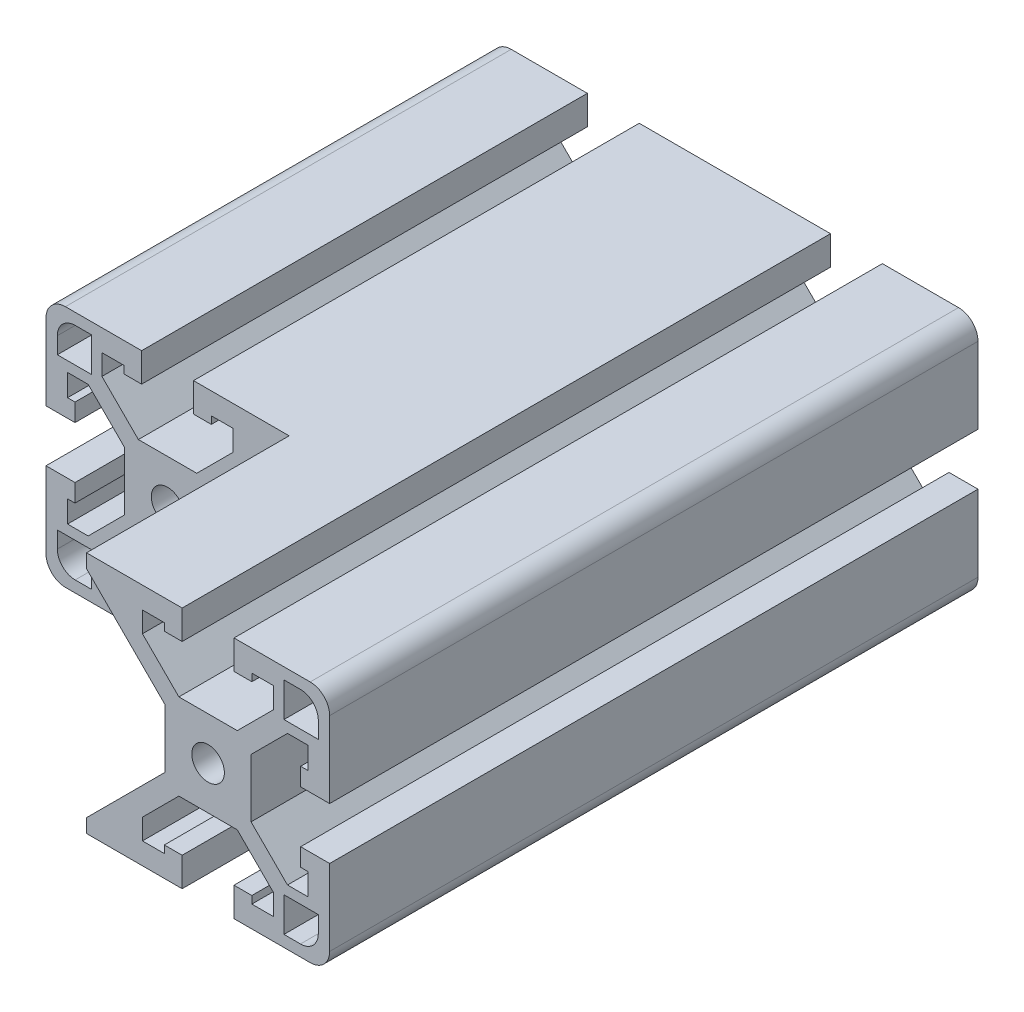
ISO-10303-21;
HEADER;
FILE_DESCRIPTION(('STEP AP214'),'2;1');
FILE_NAME('part.step','',(''),(''),'','','');
FILE_SCHEMA(('AUTOMOTIVE_DESIGN { 1 0 10303 214 1 1 1 1 }'));
ENDSEC;
DATA;
#1=APPLICATION_CONTEXT('core data for automotive mechanical design processes');
#2=APPLICATION_PROTOCOL_DEFINITION('international standard','automotive_design',2000,#1);
#3=PRODUCT_CONTEXT('',#1,'mechanical');
#4=PRODUCT('Part','Part','',(#3));
#5=PRODUCT_RELATED_PRODUCT_CATEGORY('part','',(#4));
#6=PRODUCT_DEFINITION_FORMATION('','',#4);
#7=PRODUCT_DEFINITION_CONTEXT('part definition',#1,'design');
#8=PRODUCT_DEFINITION('design','',#6,#7);
#9=PRODUCT_DEFINITION_SHAPE('','',#8);
#10=(LENGTH_UNIT() NAMED_UNIT(*) SI_UNIT(.MILLI.,.METRE.));
#11=(NAMED_UNIT(*) PLANE_ANGLE_UNIT() SI_UNIT($,.RADIAN.));
#12=(NAMED_UNIT(*) SI_UNIT($,.STERADIAN.) SOLID_ANGLE_UNIT());
#13=UNCERTAINTY_MEASURE_WITH_UNIT(LENGTH_MEASURE(1.E-05),#10,'distance_accuracy_value','');
#14=(GEOMETRIC_REPRESENTATION_CONTEXT(3) GLOBAL_UNCERTAINTY_ASSIGNED_CONTEXT((#13)) GLOBAL_UNIT_ASSIGNED_CONTEXT((#10,
#11,#12)) REPRESENTATION_CONTEXT('',''));
#15=CARTESIAN_POINT('',(0.,0.,0.));
#16=DIRECTION('',(0.,0.,1.));
#17=DIRECTION('',(1.,0.,0.));
#18=AXIS2_PLACEMENT_3D('',#15,#16,#17);
#19=CARTESIAN_POINT('',(-23.6257385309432,6.73100000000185,50.8));
#20=DIRECTION('',(-0.707106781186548,-0.707106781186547,0.));
#21=DIRECTION('',(0.707106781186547,-0.707106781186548,0.));
#22=AXIS2_PLACEMENT_3D('',#19,#20,#21);
#23=PLANE('',#22);
#24=DIRECTION('',(-0.707106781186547,0.707106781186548,0.));
#25=VECTOR('',#24,1.);
#26=CARTESIAN_POINT('',(-23.6257385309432,6.73100000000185,19.05));
#27=LINE('',#26,#25);
#28=CARTESIAN_POINT('',(-23.6257385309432,6.73100000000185,19.05));
#29=VERTEX_POINT('',#28);
#30=CARTESIAN_POINT('',(-29.3369999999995,12.4422614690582,19.05));
#31=VERTEX_POINT('',#30);
#32=EDGE_CURVE('E1372',#29,#31,#27,.T.);
#33=ORIENTED_EDGE('',*,*,#32,.F.);
#34=DIRECTION('',(0.,0.,-1.));
#35=VECTOR('',#34,1.);
#36=CARTESIAN_POINT('',(-23.6257385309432,6.73100000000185,50.8));
#37=LINE('',#36,#35);
#38=CARTESIAN_POINT('',(-23.6257385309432,6.73100000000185,-50.8));
#39=VERTEX_POINT('',#38);
#40=EDGE_CURVE('E904',#29,#39,#37,.T.);
#41=ORIENTED_EDGE('',*,*,#40,.T.);
#42=DIRECTION('',(-0.707106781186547,0.707106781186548,0.));
#43=VECTOR('',#42,1.);
#44=CARTESIAN_POINT('',(-23.6257385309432,6.73100000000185,-50.8));
#45=LINE('',#44,#43);
#46=CARTESIAN_POINT('',(-29.3369999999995,12.4422614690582,-50.8));
#47=VERTEX_POINT('',#46);
#48=EDGE_CURVE('E905',#39,#47,#45,.T.);
#49=ORIENTED_EDGE('',*,*,#48,.T.);
#50=DIRECTION('',(0.,0.,-1.));
#51=VECTOR('',#50,1.);
#52=CARTESIAN_POINT('',(-29.3369999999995,12.4422614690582,50.8));
#53=LINE('',#52,#51);
#54=EDGE_CURVE('E41',#31,#47,#53,.T.);
#55=ORIENTED_EDGE('',*,*,#54,.F.);
#56=EDGE_LOOP('',(#33,#41,#49,#55));
#57=FACE_BOUND('',#56,.T.);
#58=ADVANCED_FACE('F34',(#57),#23,.F.);
#59=CARTESIAN_POINT('',(-29.3369999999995,12.4422614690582,50.8));
#60=DIRECTION('',(-1.,0.,0.));
#61=DIRECTION('',(0.,0.,1.));
#62=AXIS2_PLACEMENT_3D('',#59,#60,#61);
#63=PLANE('',#62);
#64=DIRECTION('',(0.,1.,0.));
#65=VECTOR('',#64,1.);
#66=CARTESIAN_POINT('',(-29.3369999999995,12.4422614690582,19.05));
#67=LINE('',#66,#65);
#68=CARTESIAN_POINT('',(-29.3369999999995,15.6718000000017,19.05));
#69=VERTEX_POINT('',#68);
#70=EDGE_CURVE('E1362',#31,#69,#67,.T.);
#71=ORIENTED_EDGE('',*,*,#70,.F.);
#72=ORIENTED_EDGE('',*,*,#54,.T.);
#73=DIRECTION('',(0.,1.,0.));
#74=VECTOR('',#73,1.);
#75=CARTESIAN_POINT('',(-29.3369999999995,12.4422614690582,-50.8));
#76=LINE('',#75,#74);
#77=CARTESIAN_POINT('',(-29.3369999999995,15.6718000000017,-50.8));
#78=VERTEX_POINT('',#77);
#79=EDGE_CURVE('E908',#47,#78,#76,.T.);
#80=ORIENTED_EDGE('',*,*,#79,.T.);
#81=DIRECTION('',(0.,0.,-1.));
#82=VECTOR('',#81,1.);
#83=CARTESIAN_POINT('',(-29.3369999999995,15.6718000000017,50.8));
#84=LINE('',#83,#82);
#85=EDGE_CURVE('E1354',#69,#78,#84,.T.);
#86=ORIENTED_EDGE('',*,*,#85,.F.);
#87=EDGE_LOOP('',(#71,#72,#80,#86));
#88=FACE_BOUND('',#87,.T.);
#89=ADVANCED_FACE('F1359',(#88),#63,.F.);
#90=CARTESIAN_POINT('',(-29.3369999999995,15.6718000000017,50.8));
#91=DIRECTION('',(0.,1.,0.));
#92=DIRECTION('',(0.,0.,1.));
#93=AXIS2_PLACEMENT_3D('',#90,#91,#92);
#94=PLANE('',#93);
#95=DIRECTION('',(1.,0.,0.));
#96=VECTOR('',#95,1.);
#97=CARTESIAN_POINT('',(-29.3369999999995,15.6718000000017,19.05));
#98=LINE('',#97,#96);
#99=CARTESIAN_POINT('',(-25.9079999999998,15.6718000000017,19.05));
#100=VERTEX_POINT('',#99);
#101=EDGE_CURVE('E1731',#69,#100,#98,.T.);
#102=ORIENTED_EDGE('',*,*,#101,.F.);
#103=ORIENTED_EDGE('',*,*,#85,.T.);
#104=DIRECTION('',(1.,0.,0.));
#105=VECTOR('',#104,1.);
#106=CARTESIAN_POINT('',(-29.3369999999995,15.6718000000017,-50.8));
#107=LINE('',#106,#105);
#108=CARTESIAN_POINT('',(-25.9079999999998,15.6718000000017,-50.8));
#109=VERTEX_POINT('',#108);
#110=EDGE_CURVE('E911',#78,#109,#107,.T.);
#111=ORIENTED_EDGE('',*,*,#110,.T.);
#112=DIRECTION('',(0.,0.,-1.));
#113=VECTOR('',#112,1.);
#114=CARTESIAN_POINT('',(-25.9079999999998,15.6718000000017,50.8));
#115=LINE('',#114,#113);
#116=EDGE_CURVE('E1352',#100,#109,#115,.T.);
#117=ORIENTED_EDGE('',*,*,#116,.F.);
#118=EDGE_LOOP('',(#102,#103,#111,#117));
#119=FACE_BOUND('',#118,.T.);
#120=ADVANCED_FACE('F2002',(#119),#94,.F.);
#121=CARTESIAN_POINT('',(-25.9079999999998,15.6718000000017,50.8));
#122=DIRECTION('',(1.,0.,0.));
#123=DIRECTION('',(0.,0.,-1.));
#124=AXIS2_PLACEMENT_3D('',#121,#122,#123);
#125=PLANE('',#124);
#126=DIRECTION('',(0.,-1.,0.));
#127=VECTOR('',#126,1.);
#128=CARTESIAN_POINT('',(-25.9079999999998,15.6718000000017,19.05));
#129=LINE('',#128,#127);
#130=CARTESIAN_POINT('',(-25.9079999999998,14.5034000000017,19.05));
#131=VERTEX_POINT('',#130);
#132=EDGE_CURVE('E1733',#100,#131,#129,.T.);
#133=ORIENTED_EDGE('',*,*,#132,.F.);
#134=ORIENTED_EDGE('',*,*,#116,.T.);
#135=DIRECTION('',(0.,-1.,0.));
#136=VECTOR('',#135,1.);
#137=CARTESIAN_POINT('',(-25.9079999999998,15.6718000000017,-50.8));
#138=LINE('',#137,#136);
#139=CARTESIAN_POINT('',(-25.9079999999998,14.5034000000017,-50.8));
#140=VERTEX_POINT('',#139);
#141=EDGE_CURVE('E914',#109,#140,#138,.T.);
#142=ORIENTED_EDGE('',*,*,#141,.T.);
#143=DIRECTION('',(0.,0.,-1.));
#144=VECTOR('',#143,1.);
#145=CARTESIAN_POINT('',(-25.9079999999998,14.5034000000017,50.8));
#146=LINE('',#145,#144);
#147=EDGE_CURVE('E1350',#131,#140,#146,.T.);
#148=ORIENTED_EDGE('',*,*,#147,.F.);
#149=EDGE_LOOP('',(#133,#134,#142,#148));
#150=FACE_BOUND('',#149,.T.);
#151=ADVANCED_FACE('F2006',(#150),#125,.F.);
#152=CARTESIAN_POINT('',(-25.9079999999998,14.5034000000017,50.8));
#153=DIRECTION('',(0.,1.,0.));
#154=DIRECTION('',(0.,0.,1.));
#155=AXIS2_PLACEMENT_3D('',#152,#153,#154);
#156=PLANE('',#155);
#157=DIRECTION('',(1.,0.,0.));
#158=VECTOR('',#157,1.);
#159=CARTESIAN_POINT('',(-25.9079999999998,14.5034000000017,19.05));
#160=LINE('',#159,#158);
#161=CARTESIAN_POINT('',(-23.1139999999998,14.5034000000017,19.05));
#162=VERTEX_POINT('',#161);
#163=EDGE_CURVE('E1735',#131,#162,#160,.T.);
#164=ORIENTED_EDGE('',*,*,#163,.F.);
#165=ORIENTED_EDGE('',*,*,#147,.T.);
#166=DIRECTION('',(1.,0.,0.));
#167=VECTOR('',#166,1.);
#168=CARTESIAN_POINT('',(-25.9079999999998,14.5034000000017,-50.8));
#169=LINE('',#168,#167);
#170=CARTESIAN_POINT('',(-23.1139999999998,14.5034000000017,-50.8));
#171=VERTEX_POINT('',#170);
#172=EDGE_CURVE('E917',#140,#171,#169,.T.);
#173=ORIENTED_EDGE('',*,*,#172,.T.);
#174=DIRECTION('',(0.,0.,-1.));
#175=VECTOR('',#174,1.);
#176=CARTESIAN_POINT('',(-23.1139999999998,14.5034000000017,50.8));
#177=LINE('',#176,#175);
#178=EDGE_CURVE('E1348',#162,#171,#177,.T.);
#179=ORIENTED_EDGE('',*,*,#178,.F.);
#180=EDGE_LOOP('',(#164,#165,#173,#179));
#181=FACE_BOUND('',#180,.T.);
#182=ADVANCED_FACE('F2012',(#181),#156,.F.);
#183=CARTESIAN_POINT('',(-23.1139999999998,14.5034000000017,50.8));
#184=DIRECTION('',(-1.,0.,0.));
#185=DIRECTION('',(0.,0.,1.));
#186=AXIS2_PLACEMENT_3D('',#183,#184,#185);
#187=PLANE('',#186);
#188=DIRECTION('',(0.,1.,0.));
#189=VECTOR('',#188,1.);
#190=CARTESIAN_POINT('',(-23.1139999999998,14.5034000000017,19.05));
#191=LINE('',#190,#189);
#192=CARTESIAN_POINT('',(-23.1139999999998,19.0500000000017,19.05));
#193=VERTEX_POINT('',#192);
#194=EDGE_CURVE('E1737',#162,#193,#191,.T.);
#195=ORIENTED_EDGE('',*,*,#194,.F.);
#196=ORIENTED_EDGE('',*,*,#178,.T.);
#197=DIRECTION('',(0.,1.,0.));
#198=VECTOR('',#197,1.);
#199=CARTESIAN_POINT('',(-23.1139999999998,14.5034000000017,-50.8));
#200=LINE('',#199,#198);
#201=CARTESIAN_POINT('',(-23.1139999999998,19.0500000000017,-50.8));
#202=VERTEX_POINT('',#201);
#203=EDGE_CURVE('E920',#171,#202,#200,.T.);
#204=ORIENTED_EDGE('',*,*,#203,.T.);
#205=DIRECTION('',(0.,0.,-1.));
#206=VECTOR('',#205,1.);
#207=CARTESIAN_POINT('',(-23.1139999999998,19.0500000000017,50.8));
#208=LINE('',#207,#206);
#209=EDGE_CURVE('E1346',#193,#202,#208,.T.);
#210=ORIENTED_EDGE('',*,*,#209,.F.);
#211=EDGE_LOOP('',(#195,#196,#204,#210));
#212=FACE_BOUND('',#211,.T.);
#213=ADVANCED_FACE('F2016',(#212),#187,.F.);
#214=CARTESIAN_POINT('',(-23.1139999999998,19.0500000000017,50.8));
#215=DIRECTION('',(0.,-1.,0.));
#216=DIRECTION('',(0.,0.,-1.));
#217=AXIS2_PLACEMENT_3D('',#214,#215,#216);
#218=PLANE('',#217);
#219=DIRECTION('',(1.,0.,0.));
#220=VECTOR('',#219,1.);
#221=CARTESIAN_POINT('',(-38.0999999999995,19.0500000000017,19.05));
#222=LINE('',#221,#220);
#223=CARTESIAN_POINT('',(-35.0519999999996,19.0500000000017,19.05));
#224=VERTEX_POINT('',#223);
#225=EDGE_CURVE('E1936',#224,#193,#222,.T.);
#226=ORIENTED_EDGE('',*,*,#225,.T.);
#227=ORIENTED_EDGE('',*,*,#209,.T.);
#228=DIRECTION('',(-1.,0.,0.));
#229=VECTOR('',#228,1.);
#230=CARTESIAN_POINT('',(-23.1139999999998,19.0500000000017,-50.8));
#231=LINE('',#230,#229);
#232=CARTESIAN_POINT('',(-35.0519999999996,19.0500000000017,-50.8));
#233=VERTEX_POINT('',#232);
#234=EDGE_CURVE('E923',#202,#233,#231,.T.);
#235=ORIENTED_EDGE('',*,*,#234,.T.);
#236=DIRECTION('',(0.,0.,-1.));
#237=VECTOR('',#236,1.);
#238=CARTESIAN_POINT('',(-35.0519999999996,19.0500000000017,50.8));
#239=LINE('',#238,#237);
#240=EDGE_CURVE('E1344',#224,#233,#239,.T.);
#241=ORIENTED_EDGE('',*,*,#240,.F.);
#242=EDGE_LOOP('',(#226,#227,#235,#241));
#243=FACE_BOUND('',#242,.T.);
#244=ADVANCED_FACE('F2020',(#243),#218,.F.);
#245=CARTESIAN_POINT('',(-35.0519999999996,16.0020000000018,50.8));
#246=DIRECTION('',(0.,0.,-1.));
#247=DIRECTION('',(-1.,0.,0.));
#248=AXIS2_PLACEMENT_3D('',#245,#246,#247);
#249=CYLINDRICAL_SURFACE('',#248,3.04799999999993);
#250=CARTESIAN_POINT('',(-35.0519999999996,16.0020000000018,19.05));
#251=DIRECTION('',(0.,0.,1.));
#252=DIRECTION('',(1.,0.,0.));
#253=AXIS2_PLACEMENT_3D('',#250,#251,#252);
#254=CIRCLE('',#253,3.04799999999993);
#255=CARTESIAN_POINT('',(-38.0999999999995,16.0020000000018,19.05));
#256=VERTEX_POINT('',#255);
#257=EDGE_CURVE('E1793',#224,#256,#254,.T.);
#258=ORIENTED_EDGE('',*,*,#257,.F.);
#259=ORIENTED_EDGE('',*,*,#240,.T.);
#260=CARTESIAN_POINT('',(-35.0519999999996,16.0020000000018,-50.8));
#261=DIRECTION('',(0.,0.,1.));
#262=DIRECTION('',(1.,0.,0.));
#263=AXIS2_PLACEMENT_3D('',#260,#261,#262);
#264=CIRCLE('',#263,3.04799999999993);
#265=CARTESIAN_POINT('',(-38.0999999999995,16.0020000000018,-50.8));
#266=VERTEX_POINT('',#265);
#267=EDGE_CURVE('E926',#233,#266,#264,.T.);
#268=ORIENTED_EDGE('',*,*,#267,.T.);
#269=DIRECTION('',(0.,0.,-1.));
#270=VECTOR('',#269,1.);
#271=CARTESIAN_POINT('',(-38.0999999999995,16.0020000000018,50.8));
#272=LINE('',#271,#270);
#273=EDGE_CURVE('E1342',#256,#266,#272,.T.);
#274=ORIENTED_EDGE('',*,*,#273,.F.);
#275=EDGE_LOOP('',(#258,#259,#268,#274));
#276=FACE_BOUND('',#275,.T.);
#277=ADVANCED_FACE('F2024',(#276),#249,.T.);
#278=CARTESIAN_POINT('',(-38.0999999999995,16.0020000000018,50.8));
#279=DIRECTION('',(1.,0.,0.));
#280=DIRECTION('',(0.,0.,-1.));
#281=AXIS2_PLACEMENT_3D('',#278,#279,#280);
#282=PLANE('',#281);
#283=DIRECTION('',(0.,1.,0.));
#284=VECTOR('',#283,1.);
#285=CARTESIAN_POINT('',(-38.0999999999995,19.0500000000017,19.05));
#286=LINE('',#285,#284);
#287=CARTESIAN_POINT('',(-38.0999999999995,4.06400000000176,19.05));
#288=VERTEX_POINT('',#287);
#289=EDGE_CURVE('E1939',#288,#256,#286,.T.);
#290=ORIENTED_EDGE('',*,*,#289,.T.);
#291=ORIENTED_EDGE('',*,*,#273,.T.);
#292=DIRECTION('',(0.,-1.,0.));
#293=VECTOR('',#292,1.);
#294=CARTESIAN_POINT('',(-38.0999999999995,16.0020000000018,-50.8));
#295=LINE('',#294,#293);
#296=CARTESIAN_POINT('',(-38.0999999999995,4.06400000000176,-50.8));
#297=VERTEX_POINT('',#296);
#298=EDGE_CURVE('E929',#266,#297,#295,.T.);
#299=ORIENTED_EDGE('',*,*,#298,.T.);
#300=DIRECTION('',(0.,0.,-1.));
#301=VECTOR('',#300,1.);
#302=CARTESIAN_POINT('',(-38.0999999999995,4.06400000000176,50.8));
#303=LINE('',#302,#301);
#304=EDGE_CURVE('E1340',#288,#297,#303,.T.);
#305=ORIENTED_EDGE('',*,*,#304,.F.);
#306=EDGE_LOOP('',(#290,#291,#299,#305));
#307=FACE_BOUND('',#306,.T.);
#308=ADVANCED_FACE('F2028',(#307),#282,.F.);
#309=CARTESIAN_POINT('',(-38.0999999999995,4.06400000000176,50.8));
#310=DIRECTION('',(0.,1.,0.));
#311=DIRECTION('',(0.,0.,1.));
#312=AXIS2_PLACEMENT_3D('',#309,#310,#311);
#313=PLANE('',#312);
#314=DIRECTION('',(1.,0.,0.));
#315=VECTOR('',#314,1.);
#316=CARTESIAN_POINT('',(-38.0999999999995,4.06400000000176,19.05));
#317=LINE('',#316,#315);
#318=CARTESIAN_POINT('',(-33.5533999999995,4.06400000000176,19.05));
#319=VERTEX_POINT('',#318);
#320=EDGE_CURVE('E1791',#288,#319,#317,.T.);
#321=ORIENTED_EDGE('',*,*,#320,.F.);
#322=ORIENTED_EDGE('',*,*,#304,.T.);
#323=DIRECTION('',(1.,0.,0.));
#324=VECTOR('',#323,1.);
#325=CARTESIAN_POINT('',(-38.0999999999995,4.06400000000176,-50.8));
#326=LINE('',#325,#324);
#327=CARTESIAN_POINT('',(-33.5533999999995,4.06400000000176,-50.8));
#328=VERTEX_POINT('',#327);
#329=EDGE_CURVE('E932',#297,#328,#326,.T.);
#330=ORIENTED_EDGE('',*,*,#329,.T.);
#331=DIRECTION('',(0.,0.,-1.));
#332=VECTOR('',#331,1.);
#333=CARTESIAN_POINT('',(-33.5533999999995,4.06400000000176,50.8));
#334=LINE('',#333,#332);
#335=EDGE_CURVE('E1338',#319,#328,#334,.T.);
#336=ORIENTED_EDGE('',*,*,#335,.F.);
#337=EDGE_LOOP('',(#321,#322,#330,#336));
#338=FACE_BOUND('',#337,.T.);
#339=ADVANCED_FACE('F2032',(#338),#313,.F.);
#340=CARTESIAN_POINT('',(-33.5533999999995,4.06400000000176,50.8));
#341=DIRECTION('',(-1.,0.,0.));
#342=DIRECTION('',(0.,0.,1.));
#343=AXIS2_PLACEMENT_3D('',#340,#341,#342);
#344=PLANE('',#343);
#345=DIRECTION('',(0.,1.,0.));
#346=VECTOR('',#345,1.);
#347=CARTESIAN_POINT('',(-33.5533999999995,4.06400000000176,19.05));
#348=LINE('',#347,#346);
#349=CARTESIAN_POINT('',(-33.5533999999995,6.85800000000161,19.05));
#350=VERTEX_POINT('',#349);
#351=EDGE_CURVE('E1789',#319,#350,#348,.T.);
#352=ORIENTED_EDGE('',*,*,#351,.F.);
#353=ORIENTED_EDGE('',*,*,#335,.T.);
#354=DIRECTION('',(0.,1.,0.));
#355=VECTOR('',#354,1.);
#356=CARTESIAN_POINT('',(-33.5533999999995,4.06400000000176,-50.8));
#357=LINE('',#356,#355);
#358=CARTESIAN_POINT('',(-33.5533999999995,6.85800000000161,-50.8));
#359=VERTEX_POINT('',#358);
#360=EDGE_CURVE('E935',#328,#359,#357,.T.);
#361=ORIENTED_EDGE('',*,*,#360,.T.);
#362=DIRECTION('',(0.,0.,-1.));
#363=VECTOR('',#362,1.);
#364=CARTESIAN_POINT('',(-33.5533999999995,6.85800000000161,50.8));
#365=LINE('',#364,#363);
#366=EDGE_CURVE('E1336',#350,#359,#365,.T.);
#367=ORIENTED_EDGE('',*,*,#366,.F.);
#368=EDGE_LOOP('',(#352,#353,#361,#367));
#369=FACE_BOUND('',#368,.T.);
#370=ADVANCED_FACE('F2036',(#369),#344,.F.);
#371=CARTESIAN_POINT('',(-33.5533999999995,6.85800000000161,50.8));
#372=DIRECTION('',(0.,-1.,0.));
#373=DIRECTION('',(0.,0.,-1.));
#374=AXIS2_PLACEMENT_3D('',#371,#372,#373);
#375=PLANE('',#374);
#376=DIRECTION('',(-1.,0.,0.));
#377=VECTOR('',#376,1.);
#378=CARTESIAN_POINT('',(-33.5533999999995,6.85800000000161,19.05));
#379=LINE('',#378,#377);
#380=CARTESIAN_POINT('',(-34.7217999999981,6.85800000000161,19.05));
#381=VERTEX_POINT('',#380);
#382=EDGE_CURVE('E1787',#350,#381,#379,.T.);
#383=ORIENTED_EDGE('',*,*,#382,.F.);
#384=ORIENTED_EDGE('',*,*,#366,.T.);
#385=DIRECTION('',(-1.,0.,0.));
#386=VECTOR('',#385,1.);
#387=CARTESIAN_POINT('',(-33.5533999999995,6.85800000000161,-50.8));
#388=LINE('',#387,#386);
#389=CARTESIAN_POINT('',(-34.7217999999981,6.85800000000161,-50.8));
#390=VERTEX_POINT('',#389);
#391=EDGE_CURVE('E938',#359,#390,#388,.T.);
#392=ORIENTED_EDGE('',*,*,#391,.T.);
#393=DIRECTION('',(0.,0.,-1.));
#394=VECTOR('',#393,1.);
#395=CARTESIAN_POINT('',(-34.7217999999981,6.85800000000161,50.8));
#396=LINE('',#395,#394);
#397=EDGE_CURVE('E1334',#381,#390,#396,.T.);
#398=ORIENTED_EDGE('',*,*,#397,.F.);
#399=EDGE_LOOP('',(#383,#384,#392,#398));
#400=FACE_BOUND('',#399,.T.);
#401=ADVANCED_FACE('F2040',(#400),#375,.F.);
#402=CARTESIAN_POINT('',(-34.7217999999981,6.85800000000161,50.8));
#403=DIRECTION('',(-1.,0.,0.));
#404=DIRECTION('',(0.,0.,1.));
#405=AXIS2_PLACEMENT_3D('',#402,#403,#404);
#406=PLANE('',#405);
#407=DIRECTION('',(0.,1.,0.));
#408=VECTOR('',#407,1.);
#409=CARTESIAN_POINT('',(-34.7217999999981,6.85800000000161,19.05));
#410=LINE('',#409,#408);
#411=CARTESIAN_POINT('',(-34.7217999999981,10.2870000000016,19.05));
#412=VERTEX_POINT('',#411);
#413=EDGE_CURVE('E1785',#381,#412,#410,.T.);
#414=ORIENTED_EDGE('',*,*,#413,.F.);
#415=ORIENTED_EDGE('',*,*,#397,.T.);
#416=DIRECTION('',(0.,1.,0.));
#417=VECTOR('',#416,1.);
#418=CARTESIAN_POINT('',(-34.7217999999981,6.85800000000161,-50.8));
#419=LINE('',#418,#417);
#420=CARTESIAN_POINT('',(-34.7217999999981,10.2870000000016,-50.8));
#421=VERTEX_POINT('',#420);
#422=EDGE_CURVE('E941',#390,#421,#419,.T.);
#423=ORIENTED_EDGE('',*,*,#422,.T.);
#424=DIRECTION('',(0.,0.,-1.));
#425=VECTOR('',#424,1.);
#426=CARTESIAN_POINT('',(-34.7217999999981,10.2870000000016,50.8));
#427=LINE('',#426,#425);
#428=EDGE_CURVE('E1332',#412,#421,#427,.T.);
#429=ORIENTED_EDGE('',*,*,#428,.F.);
#430=EDGE_LOOP('',(#414,#415,#423,#429));
#431=FACE_BOUND('',#430,.T.);
#432=ADVANCED_FACE('F2044',(#431),#406,.F.);
#433=CARTESIAN_POINT('',(-34.7217999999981,10.2870000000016,50.8));
#434=DIRECTION('',(0.,1.,0.));
#435=DIRECTION('',(0.,0.,1.));
#436=AXIS2_PLACEMENT_3D('',#433,#434,#435);
#437=PLANE('',#436);
#438=DIRECTION('',(1.,0.,0.));
#439=VECTOR('',#438,1.);
#440=CARTESIAN_POINT('',(-34.7217999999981,10.2870000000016,19.05));
#441=LINE('',#440,#439);
#442=CARTESIAN_POINT('',(-31.492261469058,10.2870000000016,19.05));
#443=VERTEX_POINT('',#442);
#444=EDGE_CURVE('E1783',#412,#443,#441,.T.);
#445=ORIENTED_EDGE('',*,*,#444,.F.);
#446=ORIENTED_EDGE('',*,*,#428,.T.);
#447=DIRECTION('',(1.,0.,0.));
#448=VECTOR('',#447,1.);
#449=CARTESIAN_POINT('',(-34.7217999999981,10.2870000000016,-50.8));
#450=LINE('',#449,#448);
#451=CARTESIAN_POINT('',(-31.492261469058,10.2870000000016,-50.8));
#452=VERTEX_POINT('',#451);
#453=EDGE_CURVE('E944',#421,#452,#450,.T.);
#454=ORIENTED_EDGE('',*,*,#453,.T.);
#455=DIRECTION('',(0.,0.,-1.));
#456=VECTOR('',#455,1.);
#457=CARTESIAN_POINT('',(-31.492261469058,10.2870000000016,50.8));
#458=LINE('',#457,#456);
#459=EDGE_CURVE('E1330',#443,#452,#458,.T.);
#460=ORIENTED_EDGE('',*,*,#459,.F.);
#461=EDGE_LOOP('',(#445,#446,#454,#460));
#462=FACE_BOUND('',#461,.T.);
#463=ADVANCED_FACE('F2048',(#462),#437,.F.);
#464=CARTESIAN_POINT('',(-31.492261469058,10.2870000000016,50.8));
#465=DIRECTION('',(0.707106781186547,0.707106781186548,0.));
#466=DIRECTION('',(-0.707106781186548,0.707106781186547,0.));
#467=AXIS2_PLACEMENT_3D('',#464,#465,#466);
#468=PLANE('',#467);
#469=DIRECTION('',(0.707106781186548,-0.707106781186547,0.));
#470=VECTOR('',#469,1.);
#471=CARTESIAN_POINT('',(-31.492261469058,10.2870000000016,19.05));
#472=LINE('',#471,#470);
#473=CARTESIAN_POINT('',(-25.7810000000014,4.57573853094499,19.05));
#474=VERTEX_POINT('',#473);
#475=EDGE_CURVE('E1781',#443,#474,#472,.T.);
#476=ORIENTED_EDGE('',*,*,#475,.F.);
#477=ORIENTED_EDGE('',*,*,#459,.T.);
#478=DIRECTION('',(0.707106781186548,-0.707106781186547,0.));
#479=VECTOR('',#478,1.);
#480=CARTESIAN_POINT('',(-31.492261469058,10.2870000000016,-50.8));
#481=LINE('',#480,#479);
#482=CARTESIAN_POINT('',(-25.7810000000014,4.57573853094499,-50.8));
#483=VERTEX_POINT('',#482);
#484=EDGE_CURVE('E947',#452,#483,#481,.T.);
#485=ORIENTED_EDGE('',*,*,#484,.T.);
#486=DIRECTION('',(0.,0.,-1.));
#487=VECTOR('',#486,1.);
#488=CARTESIAN_POINT('',(-25.7810000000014,4.57573853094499,50.8));
#489=LINE('',#488,#487);
#490=EDGE_CURVE('E1328',#474,#483,#489,.T.);
#491=ORIENTED_EDGE('',*,*,#490,.F.);
#492=EDGE_LOOP('',(#476,#477,#485,#491));
#493=FACE_BOUND('',#492,.T.);
#494=ADVANCED_FACE('F2052',(#493),#468,.F.);
#495=CARTESIAN_POINT('',(-25.7810000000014,4.57573853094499,50.8));
#496=DIRECTION('',(1.,0.,0.));
#497=DIRECTION('',(0.,0.,-1.));
#498=AXIS2_PLACEMENT_3D('',#495,#496,#497);
#499=PLANE('',#498);
#500=DIRECTION('',(0.,-1.,0.));
#501=VECTOR('',#500,1.);
#502=CARTESIAN_POINT('',(-25.7810000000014,4.57573853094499,19.05));
#503=LINE('',#502,#501);
#504=CARTESIAN_POINT('',(-25.7810000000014,-4.57573853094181,19.05));
#505=VERTEX_POINT('',#504);
#506=EDGE_CURVE('E1779',#474,#505,#503,.T.);
#507=ORIENTED_EDGE('',*,*,#506,.F.);
#508=ORIENTED_EDGE('',*,*,#490,.T.);
#509=DIRECTION('',(0.,-1.,0.));
#510=VECTOR('',#509,1.);
#511=CARTESIAN_POINT('',(-25.7810000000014,4.57573853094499,-50.8));
#512=LINE('',#511,#510);
#513=CARTESIAN_POINT('',(-25.7810000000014,-4.57573853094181,-50.8));
#514=VERTEX_POINT('',#513);
#515=EDGE_CURVE('E950',#483,#514,#512,.T.);
#516=ORIENTED_EDGE('',*,*,#515,.T.);
#517=DIRECTION('',(0.,0.,-1.));
#518=VECTOR('',#517,1.);
#519=CARTESIAN_POINT('',(-25.7810000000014,-4.57573853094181,50.8));
#520=LINE('',#519,#518);
#521=EDGE_CURVE('E1326',#505,#514,#520,.T.);
#522=ORIENTED_EDGE('',*,*,#521,.F.);
#523=EDGE_LOOP('',(#507,#508,#516,#522));
#524=FACE_BOUND('',#523,.T.);
#525=ADVANCED_FACE('F2056',(#524),#499,.F.);
#526=CARTESIAN_POINT('',(-25.7810000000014,-4.57573853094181,50.8));
#527=DIRECTION('',(0.707106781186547,-0.707106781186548,0.));
#528=DIRECTION('',(0.707106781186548,0.707106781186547,0.));
#529=AXIS2_PLACEMENT_3D('',#526,#527,#528);
#530=PLANE('',#529);
#531=DIRECTION('',(-0.707106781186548,-0.707106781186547,0.));
#532=VECTOR('',#531,1.);
#533=CARTESIAN_POINT('',(-25.7810000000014,-4.57573853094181,19.05));
#534=LINE('',#533,#532);
#535=CARTESIAN_POINT('',(-31.492261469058,-10.2869999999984,19.05));
#536=VERTEX_POINT('',#535);
#537=EDGE_CURVE('E1777',#505,#536,#534,.T.);
#538=ORIENTED_EDGE('',*,*,#537,.F.);
#539=ORIENTED_EDGE('',*,*,#521,.T.);
#540=DIRECTION('',(-0.707106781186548,-0.707106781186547,0.));
#541=VECTOR('',#540,1.);
#542=CARTESIAN_POINT('',(-25.7810000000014,-4.57573853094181,-50.8));
#543=LINE('',#542,#541);
#544=CARTESIAN_POINT('',(-31.492261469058,-10.2869999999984,-50.8));
#545=VERTEX_POINT('',#544);
#546=EDGE_CURVE('E953',#514,#545,#543,.T.);
#547=ORIENTED_EDGE('',*,*,#546,.T.);
#548=DIRECTION('',(0.,0.,-1.));
#549=VECTOR('',#548,1.);
#550=CARTESIAN_POINT('',(-31.492261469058,-10.2869999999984,50.8));
#551=LINE('',#550,#549);
#552=EDGE_CURVE('E1324',#536,#545,#551,.T.);
#553=ORIENTED_EDGE('',*,*,#552,.F.);
#554=EDGE_LOOP('',(#538,#539,#547,#553));
#555=FACE_BOUND('',#554,.T.);
#556=ADVANCED_FACE('F2060',(#555),#530,.F.);
#557=CARTESIAN_POINT('',(-31.492261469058,-10.2869999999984,50.8));
#558=DIRECTION('',(0.,-1.,0.));
#559=DIRECTION('',(1.,0.,0.));
#560=AXIS2_PLACEMENT_3D('',#557,#558,#559);
#561=PLANE('',#560);
#562=DIRECTION('',(-1.,0.,0.));
#563=VECTOR('',#562,1.);
#564=CARTESIAN_POINT('',(-31.492261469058,-10.2869999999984,19.05));
#565=LINE('',#564,#563);
#566=CARTESIAN_POINT('',(-34.7217999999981,-10.2869999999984,19.05));
#567=VERTEX_POINT('',#566);
#568=EDGE_CURVE('E1775',#536,#567,#565,.T.);
#569=ORIENTED_EDGE('',*,*,#568,.F.);
#570=ORIENTED_EDGE('',*,*,#552,.T.);
#571=DIRECTION('',(-1.,0.,0.));
#572=VECTOR('',#571,1.);
#573=CARTESIAN_POINT('',(-31.492261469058,-10.2869999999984,-50.8));
#574=LINE('',#573,#572);
#575=CARTESIAN_POINT('',(-34.7217999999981,-10.2869999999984,-50.8));
#576=VERTEX_POINT('',#575);
#577=EDGE_CURVE('E956',#545,#576,#574,.T.);
#578=ORIENTED_EDGE('',*,*,#577,.T.);
#579=DIRECTION('',(0.,0.,-1.));
#580=VECTOR('',#579,1.);
#581=CARTESIAN_POINT('',(-34.7217999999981,-10.2869999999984,50.8));
#582=LINE('',#581,#580);
#583=EDGE_CURVE('E1322',#567,#576,#582,.T.);
#584=ORIENTED_EDGE('',*,*,#583,.F.);
#585=EDGE_LOOP('',(#569,#570,#578,#584));
#586=FACE_BOUND('',#585,.T.);
#587=ADVANCED_FACE('F2064',(#586),#561,.F.);
#588=CARTESIAN_POINT('',(-34.7217999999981,-10.2869999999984,50.8));
#589=DIRECTION('',(-1.,0.,0.));
#590=DIRECTION('',(0.,-1.,0.));
#591=AXIS2_PLACEMENT_3D('',#588,#589,#590);
#592=PLANE('',#591);
#593=DIRECTION('',(0.,1.,0.));
#594=VECTOR('',#593,1.);
#595=CARTESIAN_POINT('',(-34.7217999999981,-10.2869999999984,19.05));
#596=LINE('',#595,#594);
#597=CARTESIAN_POINT('',(-34.7217999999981,-6.85799999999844,19.05));
#598=VERTEX_POINT('',#597);
#599=EDGE_CURVE('E1773',#567,#598,#596,.T.);
#600=ORIENTED_EDGE('',*,*,#599,.F.);
#601=ORIENTED_EDGE('',*,*,#583,.T.);
#602=DIRECTION('',(0.,1.,0.));
#603=VECTOR('',#602,1.);
#604=CARTESIAN_POINT('',(-34.7217999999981,-10.2869999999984,-50.8));
#605=LINE('',#604,#603);
#606=CARTESIAN_POINT('',(-34.7217999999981,-6.85799999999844,-50.8));
#607=VERTEX_POINT('',#606);
#608=EDGE_CURVE('E959',#576,#607,#605,.T.);
#609=ORIENTED_EDGE('',*,*,#608,.T.);
#610=DIRECTION('',(0.,0.,-1.));
#611=VECTOR('',#610,1.);
#612=CARTESIAN_POINT('',(-34.7217999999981,-6.85799999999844,50.8));
#613=LINE('',#612,#611);
#614=EDGE_CURVE('E1320',#598,#607,#613,.T.);
#615=ORIENTED_EDGE('',*,*,#614,.F.);
#616=EDGE_LOOP('',(#600,#601,#609,#615));
#617=FACE_BOUND('',#616,.T.);
#618=ADVANCED_FACE('F2068',(#617),#592,.F.);
#619=CARTESIAN_POINT('',(-34.7217999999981,-6.85799999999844,50.8));
#620=DIRECTION('',(0.,1.,0.));
#621=DIRECTION('',(-1.,0.,0.));
#622=AXIS2_PLACEMENT_3D('',#619,#620,#621);
#623=PLANE('',#622);
#624=DIRECTION('',(1.,0.,0.));
#625=VECTOR('',#624,1.);
#626=CARTESIAN_POINT('',(-34.7217999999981,-6.85799999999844,19.05));
#627=LINE('',#626,#625);
#628=CARTESIAN_POINT('',(-33.5533999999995,-6.85799999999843,19.05));
#629=VERTEX_POINT('',#628);
#630=EDGE_CURVE('E1771',#598,#629,#627,.T.);
#631=ORIENTED_EDGE('',*,*,#630,.F.);
#632=ORIENTED_EDGE('',*,*,#614,.T.);
#633=DIRECTION('',(1.,0.,0.));
#634=VECTOR('',#633,1.);
#635=CARTESIAN_POINT('',(-34.7217999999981,-6.85799999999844,-50.8));
#636=LINE('',#635,#634);
#637=CARTESIAN_POINT('',(-33.5533999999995,-6.85799999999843,-50.8));
#638=VERTEX_POINT('',#637);
#639=EDGE_CURVE('E962',#607,#638,#636,.T.);
#640=ORIENTED_EDGE('',*,*,#639,.T.);
#641=DIRECTION('',(0.,0.,-1.));
#642=VECTOR('',#641,1.);
#643=CARTESIAN_POINT('',(-33.5533999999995,-6.85799999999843,50.8));
#644=LINE('',#643,#642);
#645=EDGE_CURVE('E1318',#629,#638,#644,.T.);
#646=ORIENTED_EDGE('',*,*,#645,.F.);
#647=EDGE_LOOP('',(#631,#632,#640,#646));
#648=FACE_BOUND('',#647,.T.);
#649=ADVANCED_FACE('F2072',(#648),#623,.F.);
#650=CARTESIAN_POINT('',(-33.5533999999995,-6.85799999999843,50.8));
#651=DIRECTION('',(-1.,0.,0.));
#652=DIRECTION('',(0.,0.,1.));
#653=AXIS2_PLACEMENT_3D('',#650,#651,#652);
#654=PLANE('',#653);
#655=DIRECTION('',(0.,1.,0.));
#656=VECTOR('',#655,1.);
#657=CARTESIAN_POINT('',(-33.5533999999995,-6.85799999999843,19.05));
#658=LINE('',#657,#656);
#659=CARTESIAN_POINT('',(-33.5533999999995,-4.06399999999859,19.05));
#660=VERTEX_POINT('',#659);
#661=EDGE_CURVE('E1769',#629,#660,#658,.T.);
#662=ORIENTED_EDGE('',*,*,#661,.F.);
#663=ORIENTED_EDGE('',*,*,#645,.T.);
#664=DIRECTION('',(0.,1.,0.));
#665=VECTOR('',#664,1.);
#666=CARTESIAN_POINT('',(-33.5533999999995,-6.85799999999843,-50.8));
#667=LINE('',#666,#665);
#668=CARTESIAN_POINT('',(-33.5533999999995,-4.06399999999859,-50.8));
#669=VERTEX_POINT('',#668);
#670=EDGE_CURVE('E965',#638,#669,#667,.T.);
#671=ORIENTED_EDGE('',*,*,#670,.T.);
#672=DIRECTION('',(0.,0.,-1.));
#673=VECTOR('',#672,1.);
#674=CARTESIAN_POINT('',(-33.5533999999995,-4.06399999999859,50.8));
#675=LINE('',#674,#673);
#676=EDGE_CURVE('E1316',#660,#669,#675,.T.);
#677=ORIENTED_EDGE('',*,*,#676,.F.);
#678=EDGE_LOOP('',(#662,#663,#671,#677));
#679=FACE_BOUND('',#678,.T.);
#680=ADVANCED_FACE('F2076',(#679),#654,.F.);
#681=CARTESIAN_POINT('',(-33.5533999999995,-4.06399999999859,50.8));
#682=DIRECTION('',(0.,-1.,0.));
#683=DIRECTION('',(1.,0.,0.));
#684=AXIS2_PLACEMENT_3D('',#681,#682,#683);
#685=PLANE('',#684);
#686=DIRECTION('',(-1.,0.,0.));
#687=VECTOR('',#686,1.);
#688=CARTESIAN_POINT('',(-33.5533999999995,-4.06399999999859,19.05));
#689=LINE('',#688,#687);
#690=CARTESIAN_POINT('',(-38.0999999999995,-4.06399999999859,19.05));
#691=VERTEX_POINT('',#690);
#692=EDGE_CURVE('E1767',#660,#691,#689,.T.);
#693=ORIENTED_EDGE('',*,*,#692,.F.);
#694=ORIENTED_EDGE('',*,*,#676,.T.);
#695=DIRECTION('',(-1.,0.,0.));
#696=VECTOR('',#695,1.);
#697=CARTESIAN_POINT('',(-33.5533999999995,-4.06399999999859,-50.8));
#698=LINE('',#697,#696);
#699=CARTESIAN_POINT('',(-38.0999999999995,-4.06399999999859,-50.8));
#700=VERTEX_POINT('',#699);
#701=EDGE_CURVE('E968',#669,#700,#698,.T.);
#702=ORIENTED_EDGE('',*,*,#701,.T.);
#703=DIRECTION('',(0.,0.,-1.));
#704=VECTOR('',#703,1.);
#705=CARTESIAN_POINT('',(-38.0999999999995,-4.06399999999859,50.8));
#706=LINE('',#705,#704);
#707=EDGE_CURVE('E1314',#691,#700,#706,.T.);
#708=ORIENTED_EDGE('',*,*,#707,.F.);
#709=EDGE_LOOP('',(#693,#694,#702,#708));
#710=FACE_BOUND('',#709,.T.);
#711=ADVANCED_FACE('F2080',(#710),#685,.F.);
#712=CARTESIAN_POINT('',(-38.0999999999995,-4.06399999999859,50.8));
#713=DIRECTION('',(1.,0.,0.));
#714=DIRECTION('',(0.,0.,-1.));
#715=AXIS2_PLACEMENT_3D('',#712,#713,#714);
#716=PLANE('',#715);
#717=CARTESIAN_POINT('',(-38.0999999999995,-16.0019999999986,19.05));
#718=VERTEX_POINT('',#717);
#719=EDGE_CURVE('E1941',#718,#691,#286,.T.);
#720=ORIENTED_EDGE('',*,*,#719,.T.);
#721=ORIENTED_EDGE('',*,*,#707,.T.);
#722=DIRECTION('',(0.,-1.,0.));
#723=VECTOR('',#722,1.);
#724=CARTESIAN_POINT('',(-38.0999999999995,-4.06399999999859,-50.8));
#725=LINE('',#724,#723);
#726=CARTESIAN_POINT('',(-38.0999999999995,-16.0019999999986,-50.8));
#727=VERTEX_POINT('',#726);
#728=EDGE_CURVE('E971',#700,#727,#725,.T.);
#729=ORIENTED_EDGE('',*,*,#728,.T.);
#730=DIRECTION('',(0.,0.,-1.));
#731=VECTOR('',#730,1.);
#732=CARTESIAN_POINT('',(-38.0999999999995,-16.0019999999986,50.8));
#733=LINE('',#732,#731);
#734=EDGE_CURVE('E1312',#718,#727,#733,.T.);
#735=ORIENTED_EDGE('',*,*,#734,.F.);
#736=EDGE_LOOP('',(#720,#721,#729,#735));
#737=FACE_BOUND('',#736,.T.);
#738=ADVANCED_FACE('F2084',(#737),#716,.F.);
#739=CARTESIAN_POINT('',(-35.0519999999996,-16.0019999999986,50.8));
#740=DIRECTION('',(0.,0.,-1.));
#741=DIRECTION('',(-1.,0.,0.));
#742=AXIS2_PLACEMENT_3D('',#739,#740,#741);
#743=CYLINDRICAL_SURFACE('',#742,3.04799999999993);
#744=CARTESIAN_POINT('',(-35.0519999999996,-16.0019999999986,19.05));
#745=DIRECTION('',(0.,0.,1.));
#746=DIRECTION('',(1.,0.,0.));
#747=AXIS2_PLACEMENT_3D('',#744,#745,#746);
#748=CIRCLE('',#747,3.04799999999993);
#749=CARTESIAN_POINT('',(-35.0519999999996,-19.0499999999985,19.05));
#750=VERTEX_POINT('',#749);
#751=EDGE_CURVE('E1765',#718,#750,#748,.T.);
#752=ORIENTED_EDGE('',*,*,#751,.F.);
#753=ORIENTED_EDGE('',*,*,#734,.T.);
#754=CARTESIAN_POINT('',(-35.0519999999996,-16.0019999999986,-50.8));
#755=DIRECTION('',(0.,0.,1.));
#756=DIRECTION('',(1.,0.,0.));
#757=AXIS2_PLACEMENT_3D('',#754,#755,#756);
#758=CIRCLE('',#757,3.04799999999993);
#759=CARTESIAN_POINT('',(-35.0519999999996,-19.0499999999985,-50.8));
#760=VERTEX_POINT('',#759);
#761=EDGE_CURVE('E974',#727,#760,#758,.T.);
#762=ORIENTED_EDGE('',*,*,#761,.T.);
#763=DIRECTION('',(0.,0.,-1.));
#764=VECTOR('',#763,1.);
#765=CARTESIAN_POINT('',(-35.0519999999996,-19.0499999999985,50.8));
#766=LINE('',#765,#764);
#767=EDGE_CURVE('E1310',#750,#760,#766,.T.);
#768=ORIENTED_EDGE('',*,*,#767,.F.);
#769=EDGE_LOOP('',(#752,#753,#762,#768));
#770=FACE_BOUND('',#769,.T.);
#771=ADVANCED_FACE('F2088',(#770),#743,.T.);
#772=CARTESIAN_POINT('',(-35.0519999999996,-19.0499999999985,50.8));
#773=DIRECTION('',(0.,1.,0.));
#774=DIRECTION('',(-1.,0.,0.));
#775=AXIS2_PLACEMENT_3D('',#772,#773,#774);
#776=PLANE('',#775);
#777=DIRECTION('',(-1.,0.,0.));
#778=VECTOR('',#777,1.);
#779=CARTESIAN_POINT('',(-38.0999999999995,-19.0499999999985,19.05));
#780=LINE('',#779,#778);
#781=CARTESIAN_POINT('',(-23.1139999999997,-19.0499999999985,19.05));
#782=VERTEX_POINT('',#781);
#783=EDGE_CURVE('E1946',#782,#750,#780,.T.);
#784=ORIENTED_EDGE('',*,*,#783,.T.);
#785=ORIENTED_EDGE('',*,*,#767,.T.);
#786=DIRECTION('',(1.,0.,0.));
#787=VECTOR('',#786,1.);
#788=CARTESIAN_POINT('',(-35.0519999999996,-19.0499999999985,-50.8));
#789=LINE('',#788,#787);
#790=CARTESIAN_POINT('',(-23.1139999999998,-19.0499999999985,-50.8));
#791=VERTEX_POINT('',#790);
#792=EDGE_CURVE('E977',#760,#791,#789,.T.);
#793=ORIENTED_EDGE('',*,*,#792,.T.);
#794=DIRECTION('',(0.,0.,-1.));
#795=VECTOR('',#794,1.);
#796=CARTESIAN_POINT('',(-23.1139999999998,-19.0499999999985,50.8));
#797=LINE('',#796,#795);
#798=EDGE_CURVE('E1308',#782,#791,#797,.T.);
#799=ORIENTED_EDGE('',*,*,#798,.F.);
#800=EDGE_LOOP('',(#784,#785,#793,#799));
#801=FACE_BOUND('',#800,.T.);
#802=ADVANCED_FACE('F2092',(#801),#776,.F.);
#803=CARTESIAN_POINT('',(-23.1139999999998,-19.0499999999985,50.8));
#804=DIRECTION('',(-1.,0.,0.));
#805=DIRECTION('',(0.,-1.,0.));
#806=AXIS2_PLACEMENT_3D('',#803,#804,#805);
#807=PLANE('',#806);
#808=DIRECTION('',(0.,1.,0.));
#809=VECTOR('',#808,1.);
#810=CARTESIAN_POINT('',(-23.1139999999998,-19.0499999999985,19.05));
#811=LINE('',#810,#809);
#812=CARTESIAN_POINT('',(-23.1139999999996,-14.5033999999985,19.05));
#813=VERTEX_POINT('',#812);
#814=EDGE_CURVE('E1763',#782,#813,#811,.T.);
#815=ORIENTED_EDGE('',*,*,#814,.F.);
#816=ORIENTED_EDGE('',*,*,#798,.T.);
#817=DIRECTION('',(0.,1.,0.));
#818=VECTOR('',#817,1.);
#819=CARTESIAN_POINT('',(-23.1139999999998,-19.0499999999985,-50.8));
#820=LINE('',#819,#818);
#821=CARTESIAN_POINT('',(-23.1139999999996,-14.5033999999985,-50.8));
#822=VERTEX_POINT('',#821);
#823=EDGE_CURVE('E980',#791,#822,#820,.T.);
#824=ORIENTED_EDGE('',*,*,#823,.T.);
#825=DIRECTION('',(0.,0.,-1.));
#826=VECTOR('',#825,1.);
#827=CARTESIAN_POINT('',(-23.1139999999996,-14.5033999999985,50.8));
#828=LINE('',#827,#826);
#829=EDGE_CURVE('E1306',#813,#822,#828,.T.);
#830=ORIENTED_EDGE('',*,*,#829,.F.);
#831=EDGE_LOOP('',(#815,#816,#824,#830));
#832=FACE_BOUND('',#831,.T.);
#833=ADVANCED_FACE('F2096',(#832),#807,.F.);
#834=CARTESIAN_POINT('',(-23.1139999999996,-14.5033999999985,50.8));
#835=DIRECTION('',(0.,-1.,0.));
#836=DIRECTION('',(0.,0.,-1.));
#837=AXIS2_PLACEMENT_3D('',#834,#835,#836);
#838=PLANE('',#837);
#839=DIRECTION('',(-1.,0.,0.));
#840=VECTOR('',#839,1.);
#841=CARTESIAN_POINT('',(-23.1139999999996,-14.5033999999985,19.05));
#842=LINE('',#841,#840);
#843=CARTESIAN_POINT('',(-25.9079999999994,-14.5033999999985,19.05));
#844=VERTEX_POINT('',#843);
#845=EDGE_CURVE('E1761',#813,#844,#842,.T.);
#846=ORIENTED_EDGE('',*,*,#845,.F.);
#847=ORIENTED_EDGE('',*,*,#829,.T.);
#848=DIRECTION('',(-1.,0.,0.));
#849=VECTOR('',#848,1.);
#850=CARTESIAN_POINT('',(-23.1139999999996,-14.5033999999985,-50.8));
#851=LINE('',#850,#849);
#852=CARTESIAN_POINT('',(-25.9079999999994,-14.5033999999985,-50.8));
#853=VERTEX_POINT('',#852);
#854=EDGE_CURVE('E983',#822,#853,#851,.T.);
#855=ORIENTED_EDGE('',*,*,#854,.T.);
#856=DIRECTION('',(0.,0.,-1.));
#857=VECTOR('',#856,1.);
#858=CARTESIAN_POINT('',(-25.9079999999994,-14.5033999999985,50.8));
#859=LINE('',#858,#857);
#860=EDGE_CURVE('E1304',#844,#853,#859,.T.);
#861=ORIENTED_EDGE('',*,*,#860,.F.);
#862=EDGE_LOOP('',(#846,#847,#855,#861));
#863=FACE_BOUND('',#862,.T.);
#864=ADVANCED_FACE('F2100',(#863),#838,.F.);
#865=CARTESIAN_POINT('',(-25.9079999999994,-14.5033999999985,50.8));
#866=DIRECTION('',(1.,0.,0.));
#867=DIRECTION('',(0.,0.,-1.));
#868=AXIS2_PLACEMENT_3D('',#865,#866,#867);
#869=PLANE('',#868);
#870=DIRECTION('',(0.,-1.,0.));
#871=VECTOR('',#870,1.);
#872=CARTESIAN_POINT('',(-25.9079999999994,-14.5033999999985,19.05));
#873=LINE('',#872,#871);
#874=CARTESIAN_POINT('',(-25.9079999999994,-15.6717999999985,19.05));
#875=VERTEX_POINT('',#874);
#876=EDGE_CURVE('E1759',#844,#875,#873,.T.);
#877=ORIENTED_EDGE('',*,*,#876,.F.);
#878=ORIENTED_EDGE('',*,*,#860,.T.);
#879=DIRECTION('',(0.,-1.,0.));
#880=VECTOR('',#879,1.);
#881=CARTESIAN_POINT('',(-25.9079999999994,-14.5033999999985,-50.8));
#882=LINE('',#881,#880);
#883=CARTESIAN_POINT('',(-25.9079999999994,-15.6717999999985,-50.8));
#884=VERTEX_POINT('',#883);
#885=EDGE_CURVE('E986',#853,#884,#882,.T.);
#886=ORIENTED_EDGE('',*,*,#885,.T.);
#887=DIRECTION('',(0.,0.,-1.));
#888=VECTOR('',#887,1.);
#889=CARTESIAN_POINT('',(-25.9079999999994,-15.6717999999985,50.8));
#890=LINE('',#889,#888);
#891=EDGE_CURVE('E1302',#875,#884,#890,.T.);
#892=ORIENTED_EDGE('',*,*,#891,.F.);
#893=EDGE_LOOP('',(#877,#878,#886,#892));
#894=FACE_BOUND('',#893,.T.);
#895=ADVANCED_FACE('F2104',(#894),#869,.F.);
#896=CARTESIAN_POINT('',(-25.9079999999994,-15.6717999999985,50.8));
#897=DIRECTION('',(0.,-1.,0.));
#898=DIRECTION('',(0.,0.,-1.));
#899=AXIS2_PLACEMENT_3D('',#896,#897,#898);
#900=PLANE('',#899);
#901=DIRECTION('',(-1.,0.,0.));
#902=VECTOR('',#901,1.);
#903=CARTESIAN_POINT('',(-25.9079999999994,-15.6717999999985,19.05));
#904=LINE('',#903,#902);
#905=CARTESIAN_POINT('',(-29.3369999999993,-15.6717999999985,19.05));
#906=VERTEX_POINT('',#905);
#907=EDGE_CURVE('E1757',#875,#906,#904,.T.);
#908=ORIENTED_EDGE('',*,*,#907,.F.);
#909=ORIENTED_EDGE('',*,*,#891,.T.);
#910=DIRECTION('',(-1.,0.,0.));
#911=VECTOR('',#910,1.);
#912=CARTESIAN_POINT('',(-25.9079999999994,-15.6717999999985,-50.8));
#913=LINE('',#912,#911);
#914=CARTESIAN_POINT('',(-29.3369999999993,-15.6717999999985,-50.8));
#915=VERTEX_POINT('',#914);
#916=EDGE_CURVE('E989',#884,#915,#913,.T.);
#917=ORIENTED_EDGE('',*,*,#916,.T.);
#918=DIRECTION('',(0.,0.,-1.));
#919=VECTOR('',#918,1.);
#920=CARTESIAN_POINT('',(-29.3369999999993,-15.6717999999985,50.8));
#921=LINE('',#920,#919);
#922=EDGE_CURVE('E1300',#906,#915,#921,.T.);
#923=ORIENTED_EDGE('',*,*,#922,.F.);
#924=EDGE_LOOP('',(#908,#909,#917,#923));
#925=FACE_BOUND('',#924,.T.);
#926=ADVANCED_FACE('F2108',(#925),#900,.F.);
#927=CARTESIAN_POINT('',(-29.3369999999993,-15.6717999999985,50.8));
#928=DIRECTION('',(-1.,0.,0.));
#929=DIRECTION('',(0.,0.,1.));
#930=AXIS2_PLACEMENT_3D('',#927,#928,#929);
#931=PLANE('',#930);
#932=DIRECTION('',(0.,1.,0.));
#933=VECTOR('',#932,1.);
#934=CARTESIAN_POINT('',(-29.3369999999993,-15.6717999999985,19.05));
#935=LINE('',#934,#933);
#936=CARTESIAN_POINT('',(-29.3369999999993,-12.442261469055,19.05));
#937=VERTEX_POINT('',#936);
#938=EDGE_CURVE('E1755',#906,#937,#935,.T.);
#939=ORIENTED_EDGE('',*,*,#938,.F.);
#940=ORIENTED_EDGE('',*,*,#922,.T.);
#941=DIRECTION('',(0.,1.,0.));
#942=VECTOR('',#941,1.);
#943=CARTESIAN_POINT('',(-29.3369999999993,-15.6717999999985,-50.8));
#944=LINE('',#943,#942);
#945=CARTESIAN_POINT('',(-29.3369999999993,-12.442261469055,-50.8));
#946=VERTEX_POINT('',#945);
#947=EDGE_CURVE('E992',#915,#946,#944,.T.);
#948=ORIENTED_EDGE('',*,*,#947,.T.);
#949=DIRECTION('',(0.,0.,-1.));
#950=VECTOR('',#949,1.);
#951=CARTESIAN_POINT('',(-29.3369999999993,-12.442261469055,50.8));
#952=LINE('',#951,#950);
#953=EDGE_CURVE('E1298',#937,#946,#952,.T.);
#954=ORIENTED_EDGE('',*,*,#953,.F.);
#955=EDGE_LOOP('',(#939,#940,#948,#954));
#956=FACE_BOUND('',#955,.T.);
#957=ADVANCED_FACE('F2112',(#956),#931,.F.);
#958=CARTESIAN_POINT('',(-29.3369999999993,-12.442261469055,50.8));
#959=DIRECTION('',(-0.707106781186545,0.707106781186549,0.));
#960=DIRECTION('',(-0.70710678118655,-0.707106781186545,0.));
#961=AXIS2_PLACEMENT_3D('',#958,#959,#960);
#962=PLANE('',#961);
#963=DIRECTION('',(0.70710678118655,0.707106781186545,0.));
#964=VECTOR('',#963,1.);
#965=CARTESIAN_POINT('',(-29.3369999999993,-12.442261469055,19.05));
#966=LINE('',#965,#964);
#967=CARTESIAN_POINT('',(-23.6257385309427,-6.73099999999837,19.05));
#968=VERTEX_POINT('',#967);
#969=EDGE_CURVE('E1753',#937,#968,#966,.T.);
#970=ORIENTED_EDGE('',*,*,#969,.F.);
#971=ORIENTED_EDGE('',*,*,#953,.T.);
#972=DIRECTION('',(0.70710678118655,0.707106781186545,0.));
#973=VECTOR('',#972,1.);
#974=CARTESIAN_POINT('',(-29.3369999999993,-12.442261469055,-50.8));
#975=LINE('',#974,#973);
#976=CARTESIAN_POINT('',(-23.6257385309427,-6.73099999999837,-50.8));
#977=VERTEX_POINT('',#976);
#978=EDGE_CURVE('E995',#946,#977,#975,.T.);
#979=ORIENTED_EDGE('',*,*,#978,.T.);
#980=DIRECTION('',(0.,0.,-1.));
#981=VECTOR('',#980,1.);
#982=CARTESIAN_POINT('',(-23.6257385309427,-6.73099999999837,50.8));
#983=LINE('',#982,#981);
#984=EDGE_CURVE('E1296',#968,#977,#983,.T.);
#985=ORIENTED_EDGE('',*,*,#984,.F.);
#986=EDGE_LOOP('',(#970,#971,#979,#985));
#987=FACE_BOUND('',#986,.T.);
#988=ADVANCED_FACE('F2116',(#987),#962,.F.);
#989=CARTESIAN_POINT('',(-23.6257385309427,-6.73099999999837,50.8));
#990=DIRECTION('',(0.,1.,0.));
#991=DIRECTION('',(-1.,0.,0.));
#992=AXIS2_PLACEMENT_3D('',#989,#990,#991);
#993=PLANE('',#992);
#994=DIRECTION('',(1.,0.,0.));
#995=VECTOR('',#994,1.);
#996=CARTESIAN_POINT('',(-23.6257385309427,-6.73099999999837,19.05));
#997=LINE('',#996,#995);
#998=CARTESIAN_POINT('',(-14.4742614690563,-6.73099999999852,19.05));
#999=VERTEX_POINT('',#998);
#1000=EDGE_CURVE('E1751',#968,#999,#997,.T.);
#1001=ORIENTED_EDGE('',*,*,#1000,.F.);
#1002=ORIENTED_EDGE('',*,*,#984,.T.);
#1003=DIRECTION('',(1.,0.,0.));
#1004=VECTOR('',#1003,1.);
#1005=CARTESIAN_POINT('',(-23.6257385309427,-6.73099999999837,-50.8));
#1006=LINE('',#1005,#1004);
#1007=CARTESIAN_POINT('',(-14.4742614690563,-6.73099999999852,-50.8));
#1008=VERTEX_POINT('',#1007);
#1009=EDGE_CURVE('E998',#977,#1008,#1006,.T.);
#1010=ORIENTED_EDGE('',*,*,#1009,.T.);
#1011=DIRECTION('',(0.,0.,-1.));
#1012=VECTOR('',#1011,1.);
#1013=CARTESIAN_POINT('',(-14.4742614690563,-6.73099999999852,50.8));
#1014=LINE('',#1013,#1012);
#1015=EDGE_CURVE('E1294',#999,#1008,#1014,.T.);
#1016=ORIENTED_EDGE('',*,*,#1015,.F.);
#1017=EDGE_LOOP('',(#1001,#1002,#1010,#1016));
#1018=FACE_BOUND('',#1017,.T.);
#1019=ADVANCED_FACE('F2120',(#1018),#993,.F.);
#1020=CARTESIAN_POINT('',(-14.4742614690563,-6.73099999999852,50.8));
#1021=DIRECTION('',(0.707106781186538,0.707106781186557,0.));
#1022=DIRECTION('',(-0.707106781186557,0.707106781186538,0.));
#1023=AXIS2_PLACEMENT_3D('',#1020,#1021,#1022);
#1024=PLANE('',#1023);
#1025=DIRECTION('',(0.707106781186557,-0.707106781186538,0.));
#1026=VECTOR('',#1025,1.);
#1027=CARTESIAN_POINT('',(-14.4742614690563,-6.73099999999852,19.05));
#1028=LINE('',#1027,#1026);
#1029=CARTESIAN_POINT('',(-8.76299999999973,-12.442261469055,19.05));
#1030=VERTEX_POINT('',#1029);
#1031=EDGE_CURVE('E1749',#999,#1030,#1028,.T.);
#1032=ORIENTED_EDGE('',*,*,#1031,.F.);
#1033=ORIENTED_EDGE('',*,*,#1015,.T.);
#1034=DIRECTION('',(0.707106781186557,-0.707106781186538,0.));
#1035=VECTOR('',#1034,1.);
#1036=CARTESIAN_POINT('',(-14.4742614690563,-6.73099999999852,-50.8));
#1037=LINE('',#1036,#1035);
#1038=CARTESIAN_POINT('',(-8.76299999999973,-12.442261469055,-50.8));
#1039=VERTEX_POINT('',#1038);
#1040=EDGE_CURVE('E1001',#1008,#1039,#1037,.T.);
#1041=ORIENTED_EDGE('',*,*,#1040,.T.);
#1042=DIRECTION('',(0.,0.,-1.));
#1043=VECTOR('',#1042,1.);
#1044=CARTESIAN_POINT('',(-8.76299999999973,-12.442261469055,50.8));
#1045=LINE('',#1044,#1043);
#1046=EDGE_CURVE('E1292',#1030,#1039,#1045,.T.);
#1047=ORIENTED_EDGE('',*,*,#1046,.F.);
#1048=EDGE_LOOP('',(#1032,#1033,#1041,#1047));
#1049=FACE_BOUND('',#1048,.T.);
#1050=ADVANCED_FACE('F2124',(#1049),#1024,.F.);
#1051=CARTESIAN_POINT('',(-8.76299999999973,-12.442261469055,50.8));
#1052=DIRECTION('',(1.,0.,0.));
#1053=DIRECTION('',(0.,0.,-1.));
#1054=AXIS2_PLACEMENT_3D('',#1051,#1052,#1053);
#1055=PLANE('',#1054);
#1056=DIRECTION('',(0.,-1.,0.));
#1057=VECTOR('',#1056,1.);
#1058=CARTESIAN_POINT('',(-8.76299999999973,-12.442261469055,19.05));
#1059=LINE('',#1058,#1057);
#1060=CARTESIAN_POINT('',(-8.76299999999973,-15.6717999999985,19.05));
#1061=VERTEX_POINT('',#1060);
#1062=EDGE_CURVE('E1747',#1030,#1061,#1059,.T.);
#1063=ORIENTED_EDGE('',*,*,#1062,.F.);
#1064=ORIENTED_EDGE('',*,*,#1046,.T.);
#1065=DIRECTION('',(0.,-1.,0.));
#1066=VECTOR('',#1065,1.);
#1067=CARTESIAN_POINT('',(-8.76299999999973,-12.442261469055,-50.8));
#1068=LINE('',#1067,#1066);
#1069=CARTESIAN_POINT('',(-8.76299999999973,-15.6717999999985,-50.8));
#1070=VERTEX_POINT('',#1069);
#1071=EDGE_CURVE('E1004',#1039,#1070,#1068,.T.);
#1072=ORIENTED_EDGE('',*,*,#1071,.T.);
#1073=DIRECTION('',(0.,0.,-1.));
#1074=VECTOR('',#1073,1.);
#1075=CARTESIAN_POINT('',(-8.76299999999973,-15.6717999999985,50.8));
#1076=LINE('',#1075,#1074);
#1077=EDGE_CURVE('E1290',#1061,#1070,#1076,.T.);
#1078=ORIENTED_EDGE('',*,*,#1077,.F.);
#1079=EDGE_LOOP('',(#1063,#1064,#1072,#1078));
#1080=FACE_BOUND('',#1079,.T.);
#1081=ADVANCED_FACE('F2128',(#1080),#1055,.F.);
#1082=CARTESIAN_POINT('',(-8.76299999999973,-15.6717999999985,50.8));
#1083=DIRECTION('',(0.,-1.,0.));
#1084=DIRECTION('',(0.,0.,-1.));
#1085=AXIS2_PLACEMENT_3D('',#1082,#1083,#1084);
#1086=PLANE('',#1085);
#1087=DIRECTION('',(-1.,0.,0.));
#1088=VECTOR('',#1087,1.);
#1089=CARTESIAN_POINT('',(-8.76299999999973,-15.6717999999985,19.05));
#1090=LINE('',#1089,#1088);
#1091=CARTESIAN_POINT('',(-12.1919999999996,-15.6717999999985,19.05));
#1092=VERTEX_POINT('',#1091);
#1093=EDGE_CURVE('E1745',#1061,#1092,#1090,.T.);
#1094=ORIENTED_EDGE('',*,*,#1093,.F.);
#1095=ORIENTED_EDGE('',*,*,#1077,.T.);
#1096=DIRECTION('',(-1.,0.,0.));
#1097=VECTOR('',#1096,1.);
#1098=CARTESIAN_POINT('',(-8.76299999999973,-15.6717999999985,-50.8));
#1099=LINE('',#1098,#1097);
#1100=CARTESIAN_POINT('',(-12.1919999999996,-15.6717999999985,-50.8));
#1101=VERTEX_POINT('',#1100);
#1102=EDGE_CURVE('E1007',#1070,#1101,#1099,.T.);
#1103=ORIENTED_EDGE('',*,*,#1102,.T.);
#1104=DIRECTION('',(0.,0.,-1.));
#1105=VECTOR('',#1104,1.);
#1106=CARTESIAN_POINT('',(-12.1919999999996,-15.6717999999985,50.8));
#1107=LINE('',#1106,#1105);
#1108=EDGE_CURVE('E1288',#1092,#1101,#1107,.T.);
#1109=ORIENTED_EDGE('',*,*,#1108,.F.);
#1110=EDGE_LOOP('',(#1094,#1095,#1103,#1109));
#1111=FACE_BOUND('',#1110,.T.);
#1112=ADVANCED_FACE('F2132',(#1111),#1086,.F.);
#1113=CARTESIAN_POINT('',(-12.1919999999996,-15.6717999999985,50.8));
#1114=DIRECTION('',(-1.,0.,0.));
#1115=DIRECTION('',(0.,-1.,0.));
#1116=AXIS2_PLACEMENT_3D('',#1113,#1114,#1115);
#1117=PLANE('',#1116);
#1118=DIRECTION('',(0.,1.,0.));
#1119=VECTOR('',#1118,1.);
#1120=CARTESIAN_POINT('',(-12.1919999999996,-15.6717999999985,19.05));
#1121=LINE('',#1120,#1119);
#1122=CARTESIAN_POINT('',(-12.1919999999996,-14.5033999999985,19.05));
#1123=VERTEX_POINT('',#1122);
#1124=EDGE_CURVE('E1743',#1092,#1123,#1121,.T.);
#1125=ORIENTED_EDGE('',*,*,#1124,.F.);
#1126=ORIENTED_EDGE('',*,*,#1108,.T.);
#1127=DIRECTION('',(0.,1.,0.));
#1128=VECTOR('',#1127,1.);
#1129=CARTESIAN_POINT('',(-12.1919999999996,-15.6717999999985,-50.8));
#1130=LINE('',#1129,#1128);
#1131=CARTESIAN_POINT('',(-12.1919999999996,-14.5033999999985,-50.8));
#1132=VERTEX_POINT('',#1131);
#1133=EDGE_CURVE('E1010',#1101,#1132,#1130,.T.);
#1134=ORIENTED_EDGE('',*,*,#1133,.T.);
#1135=DIRECTION('',(0.,0.,-1.));
#1136=VECTOR('',#1135,1.);
#1137=CARTESIAN_POINT('',(-12.1919999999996,-14.5033999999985,50.8));
#1138=LINE('',#1137,#1136);
#1139=EDGE_CURVE('E1286',#1123,#1132,#1138,.T.);
#1140=ORIENTED_EDGE('',*,*,#1139,.F.);
#1141=EDGE_LOOP('',(#1125,#1126,#1134,#1140));
#1142=FACE_BOUND('',#1141,.T.);
#1143=ADVANCED_FACE('F2136',(#1142),#1117,.F.);
#1144=CARTESIAN_POINT('',(-12.1919999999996,-14.5033999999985,50.8));
#1145=DIRECTION('',(0.,-1.,0.));
#1146=DIRECTION('',(1.,0.,0.));
#1147=AXIS2_PLACEMENT_3D('',#1144,#1145,#1146);
#1148=PLANE('',#1147);
#1149=DIRECTION('',(-1.,0.,0.));
#1150=VECTOR('',#1149,1.);
#1151=CARTESIAN_POINT('',(-12.1919999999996,-14.5033999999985,19.05));
#1152=LINE('',#1151,#1150);
#1153=CARTESIAN_POINT('',(-14.9859999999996,-14.5033999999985,19.05));
#1154=VERTEX_POINT('',#1153);
#1155=EDGE_CURVE('E1741',#1123,#1154,#1152,.T.);
#1156=ORIENTED_EDGE('',*,*,#1155,.F.);
#1157=ORIENTED_EDGE('',*,*,#1139,.T.);
#1158=DIRECTION('',(-1.,0.,0.));
#1159=VECTOR('',#1158,1.);
#1160=CARTESIAN_POINT('',(-12.1919999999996,-14.5033999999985,-50.8));
#1161=LINE('',#1160,#1159);
#1162=CARTESIAN_POINT('',(-14.9859999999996,-14.5033999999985,-50.8));
#1163=VERTEX_POINT('',#1162);
#1164=EDGE_CURVE('E1013',#1132,#1163,#1161,.T.);
#1165=ORIENTED_EDGE('',*,*,#1164,.T.);
#1166=DIRECTION('',(0.,0.,-1.));
#1167=VECTOR('',#1166,1.);
#1168=CARTESIAN_POINT('',(-14.9859999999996,-14.5033999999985,50.8));
#1169=LINE('',#1168,#1167);
#1170=EDGE_CURVE('E1284',#1154,#1163,#1169,.T.);
#1171=ORIENTED_EDGE('',*,*,#1170,.F.);
#1172=EDGE_LOOP('',(#1156,#1157,#1165,#1171));
#1173=FACE_BOUND('',#1172,.T.);
#1174=ADVANCED_FACE('F2140',(#1173),#1148,.F.);
#1175=CARTESIAN_POINT('',(-14.9859999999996,-14.5033999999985,50.8));
#1176=DIRECTION('',(1.,0.,0.));
#1177=DIRECTION('',(0.,1.,0.));
#1178=AXIS2_PLACEMENT_3D('',#1175,#1176,#1177);
#1179=PLANE('',#1178);
#1180=DIRECTION('',(0.,-1.,0.));
#1181=VECTOR('',#1180,1.);
#1182=CARTESIAN_POINT('',(-14.9859999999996,-14.5033999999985,19.05));
#1183=LINE('',#1182,#1181);
#1184=CARTESIAN_POINT('',(-14.9859999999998,-19.0499999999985,19.05));
#1185=VERTEX_POINT('',#1184);
#1186=EDGE_CURVE('E1739',#1154,#1185,#1183,.T.);
#1187=ORIENTED_EDGE('',*,*,#1186,.F.);
#1188=ORIENTED_EDGE('',*,*,#1170,.T.);
#1189=DIRECTION('',(0.,-1.,0.));
#1190=VECTOR('',#1189,1.);
#1191=CARTESIAN_POINT('',(-14.9859999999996,-14.5033999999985,-50.8));
#1192=LINE('',#1191,#1190);
#1193=CARTESIAN_POINT('',(-14.9859999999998,-19.0499999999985,-50.8));
#1194=VERTEX_POINT('',#1193);
#1195=EDGE_CURVE('E1016',#1163,#1194,#1192,.T.);
#1196=ORIENTED_EDGE('',*,*,#1195,.T.);
#1197=DIRECTION('',(0.,0.,-1.));
#1198=VECTOR('',#1197,1.);
#1199=CARTESIAN_POINT('',(-14.9859999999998,-19.0499999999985,50.8));
#1200=LINE('',#1199,#1198);
#1201=EDGE_CURVE('E1282',#1185,#1194,#1200,.T.);
#1202=ORIENTED_EDGE('',*,*,#1201,.F.);
#1203=EDGE_LOOP('',(#1187,#1188,#1196,#1202));
#1204=FACE_BOUND('',#1203,.T.);
#1205=ADVANCED_FACE('F2144',(#1204),#1179,.F.);
#1206=CARTESIAN_POINT('',(-14.9859999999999,19.050000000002,50.8));
#1207=DIRECTION('',(1.,0.,0.));
#1208=DIRECTION('',(0.,0.,-1.));
#1209=AXIS2_PLACEMENT_3D('',#1206,#1207,#1208);
#1210=PLANE('',#1209);
#1211=DIRECTION('',(0.,-1.,0.));
#1212=VECTOR('',#1211,1.);
#1213=CARTESIAN_POINT('',(-14.9859999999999,19.050000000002,19.05));
#1214=LINE('',#1213,#1212);
#1215=CARTESIAN_POINT('',(-14.9859999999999,19.0500000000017,19.05));
#1216=VERTEX_POINT('',#1215);
#1217=CARTESIAN_POINT('',(-14.9859999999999,14.503400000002,19.05));
#1218=VERTEX_POINT('',#1217);
#1219=EDGE_CURVE('E1727',#1216,#1218,#1214,.T.);
#1220=ORIENTED_EDGE('',*,*,#1219,.F.);
#1221=DIRECTION('',(0.,0.,-1.));
#1222=VECTOR('',#1221,1.);
#1223=CARTESIAN_POINT('',(-14.9859999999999,19.050000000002,50.8));
#1224=LINE('',#1223,#1222);
#1225=CARTESIAN_POINT('',(-14.9859999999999,19.050000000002,-50.8));
#1226=VERTEX_POINT('',#1225);
#1227=EDGE_CURVE('E1144',#1216,#1226,#1224,.T.);
#1228=ORIENTED_EDGE('',*,*,#1227,.T.);
#1229=DIRECTION('',(0.,-1.,0.));
#1230=VECTOR('',#1229,1.);
#1231=CARTESIAN_POINT('',(-14.9859999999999,19.050000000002,-50.8));
#1232=LINE('',#1231,#1230);
#1233=CARTESIAN_POINT('',(-14.9859999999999,14.503400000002,-50.8));
#1234=VERTEX_POINT('',#1233);
#1235=EDGE_CURVE('E1114',#1226,#1234,#1232,.T.);
#1236=ORIENTED_EDGE('',*,*,#1235,.T.);
#1237=DIRECTION('',(0.,0.,-1.));
#1238=VECTOR('',#1237,1.);
#1239=CARTESIAN_POINT('',(-14.9859999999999,14.503400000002,50.8));
#1240=LINE('',#1239,#1238);
#1241=EDGE_CURVE('E1142',#1218,#1234,#1240,.T.);
#1242=ORIENTED_EDGE('',*,*,#1241,.F.);
#1243=EDGE_LOOP('',(#1220,#1228,#1236,#1242));
#1244=FACE_BOUND('',#1243,.T.);
#1245=ADVANCED_FACE('F1409',(#1244),#1210,.F.);
#1246=CARTESIAN_POINT('',(-14.9859999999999,14.503400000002,50.8));
#1247=DIRECTION('',(0.,1.,0.));
#1248=DIRECTION('',(0.,0.,1.));
#1249=AXIS2_PLACEMENT_3D('',#1246,#1247,#1248);
#1250=PLANE('',#1249);
#1251=DIRECTION('',(1.,0.,0.));
#1252=VECTOR('',#1251,1.);
#1253=CARTESIAN_POINT('',(-14.9859999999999,14.503400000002,19.05));
#1254=LINE('',#1253,#1252);
#1255=CARTESIAN_POINT('',(-12.1919999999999,14.503400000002,19.05));
#1256=VERTEX_POINT('',#1255);
#1257=EDGE_CURVE('E1406',#1218,#1256,#1254,.T.);
#1258=ORIENTED_EDGE('',*,*,#1257,.F.);
#1259=ORIENTED_EDGE('',*,*,#1241,.T.);
#1260=DIRECTION('',(1.,0.,0.));
#1261=VECTOR('',#1260,1.);
#1262=CARTESIAN_POINT('',(-14.9859999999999,14.503400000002,-50.8));
#1263=LINE('',#1262,#1261);
#1264=CARTESIAN_POINT('',(-12.1919999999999,14.503400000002,-50.8));
#1265=VERTEX_POINT('',#1264);
#1266=EDGE_CURVE('E1117',#1234,#1265,#1263,.T.);
#1267=ORIENTED_EDGE('',*,*,#1266,.T.);
#1268=DIRECTION('',(0.,0.,-1.));
#1269=VECTOR('',#1268,1.);
#1270=CARTESIAN_POINT('',(-12.1919999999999,14.503400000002,50.8));
#1271=LINE('',#1270,#1269);
#1272=EDGE_CURVE('E1140',#1256,#1265,#1271,.T.);
#1273=ORIENTED_EDGE('',*,*,#1272,.F.);
#1274=EDGE_LOOP('',(#1258,#1259,#1267,#1273));
#1275=FACE_BOUND('',#1274,.T.);
#1276=ADVANCED_FACE('F1404',(#1275),#1250,.F.);
#1277=CARTESIAN_POINT('',(-12.1919999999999,14.503400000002,50.8));
#1278=DIRECTION('',(-1.,0.,0.));
#1279=DIRECTION('',(0.,0.,1.));
#1280=AXIS2_PLACEMENT_3D('',#1277,#1278,#1279);
#1281=PLANE('',#1280);
#1282=DIRECTION('',(0.,1.,0.));
#1283=VECTOR('',#1282,1.);
#1284=CARTESIAN_POINT('',(-12.1919999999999,14.503400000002,19.05));
#1285=LINE('',#1284,#1283);
#1286=CARTESIAN_POINT('',(-12.1919999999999,15.671800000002,19.05));
#1287=VERTEX_POINT('',#1286);
#1288=EDGE_CURVE('E1401',#1256,#1287,#1285,.T.);
#1289=ORIENTED_EDGE('',*,*,#1288,.F.);
#1290=ORIENTED_EDGE('',*,*,#1272,.T.);
#1291=DIRECTION('',(0.,1.,0.));
#1292=VECTOR('',#1291,1.);
#1293=CARTESIAN_POINT('',(-12.1919999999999,14.503400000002,-50.8));
#1294=LINE('',#1293,#1292);
#1295=CARTESIAN_POINT('',(-12.1919999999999,15.671800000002,-50.8));
#1296=VERTEX_POINT('',#1295);
#1297=EDGE_CURVE('E1120',#1265,#1296,#1294,.T.);
#1298=ORIENTED_EDGE('',*,*,#1297,.T.);
#1299=DIRECTION('',(0.,0.,-1.));
#1300=VECTOR('',#1299,1.);
#1301=CARTESIAN_POINT('',(-12.1919999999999,15.671800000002,50.8));
#1302=LINE('',#1301,#1300);
#1303=EDGE_CURVE('E1138',#1287,#1296,#1302,.T.);
#1304=ORIENTED_EDGE('',*,*,#1303,.F.);
#1305=EDGE_LOOP('',(#1289,#1290,#1298,#1304));
#1306=FACE_BOUND('',#1305,.T.);
#1307=ADVANCED_FACE('F1399',(#1306),#1281,.F.);
#1308=CARTESIAN_POINT('',(-12.1919999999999,15.671800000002,50.8));
#1309=DIRECTION('',(0.,1.,0.));
#1310=DIRECTION('',(0.,0.,1.));
#1311=AXIS2_PLACEMENT_3D('',#1308,#1309,#1310);
#1312=PLANE('',#1311);
#1313=DIRECTION('',(1.,0.,0.));
#1314=VECTOR('',#1313,1.);
#1315=CARTESIAN_POINT('',(-12.1919999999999,15.671800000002,19.05));
#1316=LINE('',#1315,#1314);
#1317=CARTESIAN_POINT('',(-8.76300000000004,15.671800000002,19.05));
#1318=VERTEX_POINT('',#1317);
#1319=EDGE_CURVE('E1723',#1287,#1318,#1316,.T.);
#1320=ORIENTED_EDGE('',*,*,#1319,.F.);
#1321=ORIENTED_EDGE('',*,*,#1303,.T.);
#1322=DIRECTION('',(1.,0.,0.));
#1323=VECTOR('',#1322,1.);
#1324=CARTESIAN_POINT('',(-12.1919999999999,15.671800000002,-50.8));
#1325=LINE('',#1324,#1323);
#1326=CARTESIAN_POINT('',(-8.76300000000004,15.671800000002,-50.8));
#1327=VERTEX_POINT('',#1326);
#1328=EDGE_CURVE('E1123',#1296,#1327,#1325,.T.);
#1329=ORIENTED_EDGE('',*,*,#1328,.T.);
#1330=DIRECTION('',(0.,0.,-1.));
#1331=VECTOR('',#1330,1.);
#1332=CARTESIAN_POINT('',(-8.76300000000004,15.671800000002,50.8));
#1333=LINE('',#1332,#1331);
#1334=EDGE_CURVE('E1136',#1318,#1327,#1333,.T.);
#1335=ORIENTED_EDGE('',*,*,#1334,.F.);
#1336=EDGE_LOOP('',(#1320,#1321,#1329,#1335));
#1337=FACE_BOUND('',#1336,.T.);
#1338=ADVANCED_FACE('F1392',(#1337),#1312,.F.);
#1339=CARTESIAN_POINT('',(-8.76300000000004,15.671800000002,50.8));
#1340=DIRECTION('',(1.,0.,0.));
#1341=DIRECTION('',(0.,0.,-1.));
#1342=AXIS2_PLACEMENT_3D('',#1339,#1340,#1341);
#1343=PLANE('',#1342);
#1344=DIRECTION('',(0.,-1.,0.));
#1345=VECTOR('',#1344,1.);
#1346=CARTESIAN_POINT('',(-8.76300000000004,15.671800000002,19.05));
#1347=LINE('',#1346,#1345);
#1348=CARTESIAN_POINT('',(-8.76300000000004,12.4422614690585,19.05));
#1349=VERTEX_POINT('',#1348);
#1350=EDGE_CURVE('E1389',#1318,#1349,#1347,.T.);
#1351=ORIENTED_EDGE('',*,*,#1350,.F.);
#1352=ORIENTED_EDGE('',*,*,#1334,.T.);
#1353=DIRECTION('',(0.,-1.,0.));
#1354=VECTOR('',#1353,1.);
#1355=CARTESIAN_POINT('',(-8.76300000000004,15.671800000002,-50.8));
#1356=LINE('',#1355,#1354);
#1357=CARTESIAN_POINT('',(-8.76300000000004,12.4422614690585,-50.8));
#1358=VERTEX_POINT('',#1357);
#1359=EDGE_CURVE('E1126',#1327,#1358,#1356,.T.);
#1360=ORIENTED_EDGE('',*,*,#1359,.T.);
#1361=DIRECTION('',(0.,0.,-1.));
#1362=VECTOR('',#1361,1.);
#1363=CARTESIAN_POINT('',(-8.76300000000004,12.4422614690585,50.8));
#1364=LINE('',#1363,#1362);
#1365=EDGE_CURVE('E1134',#1349,#1358,#1364,.T.);
#1366=ORIENTED_EDGE('',*,*,#1365,.F.);
#1367=EDGE_LOOP('',(#1351,#1352,#1360,#1366));
#1368=FACE_BOUND('',#1367,.T.);
#1369=ADVANCED_FACE('F1387',(#1368),#1343,.F.);
#1370=CARTESIAN_POINT('',(-8.76300000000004,12.4422614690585,50.8));
#1371=DIRECTION('',(0.707106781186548,-0.707106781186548,0.));
#1372=DIRECTION('',(0.707106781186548,0.707106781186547,0.));
#1373=AXIS2_PLACEMENT_3D('',#1370,#1371,#1372);
#1374=PLANE('',#1373);
#1375=DIRECTION('',(-0.707106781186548,-0.707106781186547,0.));
#1376=VECTOR('',#1375,1.);
#1377=CARTESIAN_POINT('',(-8.76300000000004,12.4422614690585,19.05));
#1378=LINE('',#1377,#1376);
#1379=CARTESIAN_POINT('',(-14.4742614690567,6.73100000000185,19.05));
#1380=VERTEX_POINT('',#1379);
#1381=EDGE_CURVE('E1384',#1349,#1380,#1378,.T.);
#1382=ORIENTED_EDGE('',*,*,#1381,.F.);
#1383=ORIENTED_EDGE('',*,*,#1365,.T.);
#1384=DIRECTION('',(-0.707106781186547,-0.707106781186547,0.));
#1385=VECTOR('',#1384,1.);
#1386=CARTESIAN_POINT('',(-8.76300000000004,12.4422614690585,-50.8));
#1387=LINE('',#1386,#1385);
#1388=CARTESIAN_POINT('',(-14.4742614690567,6.73100000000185,-50.8));
#1389=VERTEX_POINT('',#1388);
#1390=EDGE_CURVE('E808',#1358,#1389,#1387,.T.);
#1391=ORIENTED_EDGE('',*,*,#1390,.T.);
#1392=DIRECTION('',(0.,0.,-1.));
#1393=VECTOR('',#1392,1.);
#1394=CARTESIAN_POINT('',(-14.4742614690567,6.73100000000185,50.8));
#1395=LINE('',#1394,#1393);
#1396=EDGE_CURVE('E1132',#1380,#1389,#1395,.T.);
#1397=ORIENTED_EDGE('',*,*,#1396,.F.);
#1398=EDGE_LOOP('',(#1382,#1383,#1391,#1397));
#1399=FACE_BOUND('',#1398,.T.);
#1400=ADVANCED_FACE('F1382',(#1399),#1374,.F.);
#1401=CARTESIAN_POINT('',(-14.4742614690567,6.73100000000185,50.8));
#1402=DIRECTION('',(0.,-1.,0.));
#1403=DIRECTION('',(0.,0.,-1.));
#1404=AXIS2_PLACEMENT_3D('',#1401,#1402,#1403);
#1405=PLANE('',#1404);
#1406=DIRECTION('',(-1.,0.,0.));
#1407=VECTOR('',#1406,1.);
#1408=CARTESIAN_POINT('',(-14.4742614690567,6.73100000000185,19.05));
#1409=LINE('',#1408,#1407);
#1410=EDGE_CURVE('E1701',#1380,#29,#1409,.T.);
#1411=ORIENTED_EDGE('',*,*,#1410,.F.);
#1412=ORIENTED_EDGE('',*,*,#1396,.T.);
#1413=DIRECTION('',(-1.,0.,0.));
#1414=VECTOR('',#1413,1.);
#1415=CARTESIAN_POINT('',(-14.4742614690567,6.73100000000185,-50.8));
#1416=LINE('',#1415,#1414);
#1417=EDGE_CURVE('E803',#1389,#39,#1416,.T.);
#1418=ORIENTED_EDGE('',*,*,#1417,.T.);
#1419=ORIENTED_EDGE('',*,*,#40,.F.);
#1420=EDGE_LOOP('',(#1411,#1412,#1418,#1419));
#1421=FACE_BOUND('',#1420,.T.);
#1422=ADVANCED_FACE('F1375',(#1421),#1405,.F.);
#1423=CARTESIAN_POINT('',(-12.3189999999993,-4.57573853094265,50.8));
#1424=DIRECTION('',(0.707106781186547,0.707106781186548,0.));
#1425=DIRECTION('',(-0.707106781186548,0.707106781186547,0.));
#1426=AXIS2_PLACEMENT_3D('',#1423,#1424,#1425);
#1427=PLANE('',#1426);
#1428=DIRECTION('',(0.,0.,-1.));
#1429=VECTOR('',#1428,1.);
#1430=CARTESIAN_POINT('',(-12.3189999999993,-4.57573853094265,50.8));
#1431=LINE('',#1430,#1429);
#1432=CARTESIAN_POINT('',(-12.3189999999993,-4.57573853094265,19.05));
#1433=VERTEX_POINT('',#1432);
#1434=CARTESIAN_POINT('',(-12.3189999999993,-4.57573853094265,-50.8));
#1435=VERTEX_POINT('',#1434);
#1436=EDGE_CURVE('E1656',#1433,#1435,#1431,.T.);
#1437=ORIENTED_EDGE('',*,*,#1436,.F.);
#1438=DIRECTION('',(0.707106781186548,-0.707106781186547,0.));
#1439=VECTOR('',#1438,1.);
#1440=CARTESIAN_POINT('',(-12.3189999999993,-4.57573853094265,19.05));
#1441=LINE('',#1440,#1439);
#1442=CARTESIAN_POINT('',(0.,-16.8947385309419,19.05));
#1443=VERTEX_POINT('',#1442);
#1444=EDGE_CURVE('E48',#1433,#1443,#1441,.T.);
#1445=ORIENTED_EDGE('',*,*,#1444,.T.);
#1446=DIRECTION('',(0.,0.,-1.));
#1447=VECTOR('',#1446,1.);
#1448=CARTESIAN_POINT('',(0.,-16.8947385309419,50.8));
#1449=LINE('',#1448,#1447);
#1450=CARTESIAN_POINT('',(0.,-16.8947385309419,-50.8));
#1451=VERTEX_POINT('',#1450);
#1452=EDGE_CURVE('E1687',#1443,#1451,#1449,.T.);
#1453=ORIENTED_EDGE('',*,*,#1452,.T.);
#1454=DIRECTION('',(0.707106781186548,-0.707106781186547,0.));
#1455=VECTOR('',#1454,1.);
#1456=CARTESIAN_POINT('',(-12.3189999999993,-4.57573853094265,-50.8));
#1457=LINE('',#1456,#1455);
#1458=EDGE_CURVE('E1664',#1435,#1451,#1457,.T.);
#1459=ORIENTED_EDGE('',*,*,#1458,.F.);
#1460=EDGE_LOOP('',(#1437,#1445,#1453,#1459));
#1461=FACE_BOUND('',#1460,.T.);
#1462=ADVANCED_FACE('F1700',(#1461),#1427,.T.);
#1463=CARTESIAN_POINT('',(0.,16.8947385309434,50.8));
#1464=DIRECTION('',(0.707106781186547,-0.707106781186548,0.));
#1465=DIRECTION('',(0.707106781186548,0.707106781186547,0.));
#1466=AXIS2_PLACEMENT_3D('',#1463,#1464,#1465);
#1467=PLANE('',#1466);
#1468=DIRECTION('',(0.,0.,-1.));
#1469=VECTOR('',#1468,1.);
#1470=CARTESIAN_POINT('',(0.,16.8947385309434,50.8));
#1471=LINE('',#1470,#1469);
#1472=CARTESIAN_POINT('',(0.,16.8947385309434,19.05));
#1473=VERTEX_POINT('',#1472);
#1474=CARTESIAN_POINT('',(0.,16.8947385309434,-50.8));
#1475=VERTEX_POINT('',#1474);
#1476=EDGE_CURVE('E1684',#1473,#1475,#1471,.T.);
#1477=ORIENTED_EDGE('',*,*,#1476,.F.);
#1478=DIRECTION('',(-0.707106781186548,-0.707106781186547,0.));
#1479=VECTOR('',#1478,1.);
#1480=CARTESIAN_POINT('',(0.,16.8947385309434,19.05));
#1481=LINE('',#1480,#1479);
#1482=CARTESIAN_POINT('',(-12.3189999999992,4.57573853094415,19.05));
#1483=VERTEX_POINT('',#1482);
#1484=EDGE_CURVE('E1702',#1473,#1483,#1481,.T.);
#1485=ORIENTED_EDGE('',*,*,#1484,.T.);
#1486=DIRECTION('',(0.,0.,-1.));
#1487=VECTOR('',#1486,1.);
#1488=CARTESIAN_POINT('',(-12.3189999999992,4.57573853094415,50.8));
#1489=LINE('',#1488,#1487);
#1490=CARTESIAN_POINT('',(-12.3189999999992,4.57573853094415,-50.8));
#1491=VERTEX_POINT('',#1490);
#1492=EDGE_CURVE('E1659',#1483,#1491,#1489,.T.);
#1493=ORIENTED_EDGE('',*,*,#1492,.T.);
#1494=DIRECTION('',(-0.707106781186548,-0.707106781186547,0.));
#1495=VECTOR('',#1494,1.);
#1496=CARTESIAN_POINT('',(0.,16.8947385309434,-50.8));
#1497=LINE('',#1496,#1495);
#1498=EDGE_CURVE('E1677',#1475,#1491,#1497,.T.);
#1499=ORIENTED_EDGE('',*,*,#1498,.F.);
#1500=EDGE_LOOP('',(#1477,#1485,#1493,#1499));
#1501=FACE_BOUND('',#1500,.T.);
#1502=ADVANCED_FACE('F1932',(#1501),#1467,.T.);
#1503=CARTESIAN_POINT('',(-12.3189999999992,4.57573853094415,50.8));
#1504=DIRECTION('',(1.,0.,0.));
#1505=DIRECTION('',(0.,1.,0.));
#1506=AXIS2_PLACEMENT_3D('',#1503,#1504,#1505);
#1507=PLANE('',#1506);
#1508=ORIENTED_EDGE('',*,*,#1492,.F.);
#1509=DIRECTION('',(0.,-1.,0.));
#1510=VECTOR('',#1509,1.);
#1511=CARTESIAN_POINT('',(-12.3189999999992,4.57573853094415,19.05));
#1512=LINE('',#1511,#1510);
#1513=EDGE_CURVE('E1711',#1483,#1433,#1512,.T.);
#1514=ORIENTED_EDGE('',*,*,#1513,.T.);
#1515=ORIENTED_EDGE('',*,*,#1436,.T.);
#1516=DIRECTION('',(0.,-1.,0.));
#1517=VECTOR('',#1516,1.);
#1518=CARTESIAN_POINT('',(-12.3189999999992,4.57573853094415,-50.8));
#1519=LINE('',#1518,#1517);
#1520=EDGE_CURVE('E1680',#1491,#1435,#1519,.T.);
#1521=ORIENTED_EDGE('',*,*,#1520,.F.);
#1522=EDGE_LOOP('',(#1508,#1514,#1515,#1521));
#1523=FACE_BOUND('',#1522,.T.);
#1524=ADVANCED_FACE('F1710',(#1523),#1507,.T.);
#1525=CARTESIAN_POINT('',(-19.0499999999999,7.41594285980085E-13,50.8));
#1526=DIRECTION('',(0.,0.,-1.));
#1527=DIRECTION('',(-1.,0.,0.));
#1528=AXIS2_PLACEMENT_3D('',#1525,#1526,#1527);
#1529=CYLINDRICAL_SURFACE('',#1528,2.55270000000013);
#1530=CARTESIAN_POINT('',(-19.0499999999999,7.41594285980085E-13,-50.8));
#1531=DIRECTION('',(0.,0.,1.));
#1532=DIRECTION('',(1.,0.,0.));
#1533=AXIS2_PLACEMENT_3D('',#1530,#1531,#1532);
#1534=CIRCLE('',#1533,2.55270000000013);
#1535=CARTESIAN_POINT('',(-16.4972999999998,7.41594285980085E-13,-50.8));
#1536=VERTEX_POINT('',#1535);
#1537=EDGE_CURVE('E1668',#1536,#1536,#1534,.T.);
#1538=ORIENTED_EDGE('',*,*,#1537,.F.);
#1539=EDGE_LOOP('',(#1538));
#1540=FACE_BOUND('',#1539,.T.);
#1541=CARTESIAN_POINT('',(-19.0499999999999,7.41594285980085E-13,19.05));
#1542=DIRECTION('',(0.,0.,1.));
#1543=DIRECTION('',(1.,0.,0.));
#1544=AXIS2_PLACEMENT_3D('',#1541,#1542,#1543);
#1545=CIRCLE('',#1544,2.55270000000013);
#1546=CARTESIAN_POINT('',(-16.4972999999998,7.41594285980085E-13,19.05));
#1547=VERTEX_POINT('',#1546);
#1548=EDGE_CURVE('E1713',#1547,#1547,#1545,.T.);
#1549=ORIENTED_EDGE('',*,*,#1548,.T.);
#1550=EDGE_LOOP('',(#1549));
#1551=FACE_BOUND('',#1550,.T.);
#1552=ADVANCED_FACE('F2276',(#1540,#1551),#1529,.F.);
#1553=CARTESIAN_POINT('',(-30.9372,17.272,50.8));
#1554=DIRECTION('',(0.,-1.,0.));
#1555=DIRECTION('',(1.,0.,0.));
#1556=AXIS2_PLACEMENT_3D('',#1553,#1554,#1555);
#1557=PLANE('',#1556);
#1558=DIRECTION('',(0.,0.,-1.));
#1559=VECTOR('',#1558,1.);
#1560=CARTESIAN_POINT('',(-30.9372,17.272,50.8));
#1561=LINE('',#1560,#1559);
#1562=CARTESIAN_POINT('',(-30.9372,17.272,19.05));
#1563=VERTEX_POINT('',#1562);
#1564=CARTESIAN_POINT('',(-30.9372,17.272,-50.8));
#1565=VERTEX_POINT('',#1564);
#1566=EDGE_CURVE('E1911',#1563,#1565,#1561,.T.);
#1567=ORIENTED_EDGE('',*,*,#1566,.F.);
#1568=DIRECTION('',(-1.,0.,0.));
#1569=VECTOR('',#1568,1.);
#1570=CARTESIAN_POINT('',(-30.9372,17.272,19.05));
#1571=LINE('',#1570,#1569);
#1572=CARTESIAN_POINT('',(-33.5279999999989,17.272,19.05));
#1573=VERTEX_POINT('',#1572);
#1574=EDGE_CURVE('E56',#1563,#1573,#1571,.T.);
#1575=ORIENTED_EDGE('',*,*,#1574,.T.);
#1576=DIRECTION('',(0.,0.,-1.));
#1577=VECTOR('',#1576,1.);
#1578=CARTESIAN_POINT('',(-33.5279999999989,17.272,50.8));
#1579=LINE('',#1578,#1577);
#1580=CARTESIAN_POINT('',(-33.5279999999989,17.272,-50.8));
#1581=VERTEX_POINT('',#1580);
#1582=EDGE_CURVE('E1919',#1573,#1581,#1579,.T.);
#1583=ORIENTED_EDGE('',*,*,#1582,.T.);
#1584=DIRECTION('',(-1.,0.,0.));
#1585=VECTOR('',#1584,1.);
#1586=CARTESIAN_POINT('',(-30.9372,17.272,-50.8));
#1587=LINE('',#1586,#1585);
#1588=EDGE_CURVE('E1896',#1565,#1581,#1587,.T.);
#1589=ORIENTED_EDGE('',*,*,#1588,.F.);
#1590=EDGE_LOOP('',(#1567,#1575,#1583,#1589));
#1591=FACE_BOUND('',#1590,.T.);
#1592=ADVANCED_FACE('F1971',(#1591),#1557,.T.);
#1593=CARTESIAN_POINT('',(-33.5279999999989,14.478,50.8));
#1594=DIRECTION('',(0.,0.,-1.));
#1595=DIRECTION('',(-1.,0.,0.));
#1596=AXIS2_PLACEMENT_3D('',#1593,#1594,#1595);
#1597=CYLINDRICAL_SURFACE('',#1596,2.794);
#1598=ORIENTED_EDGE('',*,*,#1582,.F.);
#1599=CARTESIAN_POINT('',(-33.5279999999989,14.478,19.05));
#1600=DIRECTION('',(0.,0.,1.));
#1601=DIRECTION('',(1.,0.,0.));
#1602=AXIS2_PLACEMENT_3D('',#1599,#1600,#1601);
#1603=CIRCLE('',#1602,2.794);
#1604=CARTESIAN_POINT('',(-36.3219999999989,14.478,19.05));
#1605=VERTEX_POINT('',#1604);
#1606=EDGE_CURVE('E1966',#1573,#1605,#1603,.T.);
#1607=ORIENTED_EDGE('',*,*,#1606,.T.);
#1608=DIRECTION('',(0.,0.,-1.));
#1609=VECTOR('',#1608,1.);
#1610=CARTESIAN_POINT('',(-36.3219999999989,14.478,50.8));
#1611=LINE('',#1610,#1609);
#1612=CARTESIAN_POINT('',(-36.3219999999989,14.478,-50.8));
#1613=VERTEX_POINT('',#1612);
#1614=EDGE_CURVE('E1917',#1605,#1613,#1611,.T.);
#1615=ORIENTED_EDGE('',*,*,#1614,.T.);
#1616=CARTESIAN_POINT('',(-33.5279999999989,14.478,-50.8));
#1617=DIRECTION('',(0.,0.,1.));
#1618=DIRECTION('',(1.,0.,0.));
#1619=AXIS2_PLACEMENT_3D('',#1616,#1617,#1618);
#1620=CIRCLE('',#1619,2.794);
#1621=EDGE_CURVE('E1899',#1581,#1613,#1620,.T.);
#1622=ORIENTED_EDGE('',*,*,#1621,.F.);
#1623=EDGE_LOOP('',(#1598,#1607,#1615,#1622));
#1624=FACE_BOUND('',#1623,.T.);
#1625=ADVANCED_FACE('F1975',(#1624),#1597,.F.);
#1626=CARTESIAN_POINT('',(-36.3219999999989,14.478,50.8));
#1627=DIRECTION('',(1.,0.,0.));
#1628=DIRECTION('',(0.,0.,-1.));
#1629=AXIS2_PLACEMENT_3D('',#1626,#1627,#1628);
#1630=PLANE('',#1629);
#1631=ORIENTED_EDGE('',*,*,#1614,.F.);
#1632=DIRECTION('',(0.,-1.,0.));
#1633=VECTOR('',#1632,1.);
#1634=CARTESIAN_POINT('',(-36.3219999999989,14.478,19.05));
#1635=LINE('',#1634,#1633);
#1636=CARTESIAN_POINT('',(-36.3219999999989,11.8872,19.05));
#1637=VERTEX_POINT('',#1636);
#1638=EDGE_CURVE('E1963',#1605,#1637,#1635,.T.);
#1639=ORIENTED_EDGE('',*,*,#1638,.T.);
#1640=DIRECTION('',(0.,0.,-1.));
#1641=VECTOR('',#1640,1.);
#1642=CARTESIAN_POINT('',(-36.3219999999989,11.8872,50.8));
#1643=LINE('',#1642,#1641);
#1644=CARTESIAN_POINT('',(-36.3219999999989,11.8872,-50.8));
#1645=VERTEX_POINT('',#1644);
#1646=EDGE_CURVE('E1915',#1637,#1645,#1643,.T.);
#1647=ORIENTED_EDGE('',*,*,#1646,.T.);
#1648=DIRECTION('',(0.,-1.,0.));
#1649=VECTOR('',#1648,1.);
#1650=CARTESIAN_POINT('',(-36.3219999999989,14.478,-50.8));
#1651=LINE('',#1650,#1649);
#1652=EDGE_CURVE('E1902',#1613,#1645,#1651,.T.);
#1653=ORIENTED_EDGE('',*,*,#1652,.F.);
#1654=EDGE_LOOP('',(#1631,#1639,#1647,#1653));
#1655=FACE_BOUND('',#1654,.T.);
#1656=ADVANCED_FACE('F1989',(#1655),#1630,.T.);
#1657=CARTESIAN_POINT('',(-36.3219999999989,11.8872,50.8));
#1658=DIRECTION('',(0.,1.,0.));
#1659=DIRECTION('',(-1.,0.,0.));
#1660=AXIS2_PLACEMENT_3D('',#1657,#1658,#1659);
#1661=PLANE('',#1660);
#1662=ORIENTED_EDGE('',*,*,#1646,.F.);
#1663=DIRECTION('',(1.,0.,0.));
#1664=VECTOR('',#1663,1.);
#1665=CARTESIAN_POINT('',(-36.3219999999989,11.8872,19.05));
#1666=LINE('',#1665,#1664);
#1667=CARTESIAN_POINT('',(-30.9372,11.8872,19.05));
#1668=VERTEX_POINT('',#1667);
#1669=EDGE_CURVE('E1960',#1637,#1668,#1666,.T.);
#1670=ORIENTED_EDGE('',*,*,#1669,.T.);
#1671=DIRECTION('',(0.,0.,-1.));
#1672=VECTOR('',#1671,1.);
#1673=CARTESIAN_POINT('',(-30.9372,11.8872,50.8));
#1674=LINE('',#1673,#1672);
#1675=CARTESIAN_POINT('',(-30.9372,11.8872,-50.8));
#1676=VERTEX_POINT('',#1675);
#1677=EDGE_CURVE('E1913',#1668,#1676,#1674,.T.);
#1678=ORIENTED_EDGE('',*,*,#1677,.T.);
#1679=DIRECTION('',(1.,0.,0.));
#1680=VECTOR('',#1679,1.);
#1681=CARTESIAN_POINT('',(-36.3219999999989,11.8872,-50.8));
#1682=LINE('',#1681,#1680);
#1683=EDGE_CURVE('E1905',#1645,#1676,#1682,.T.);
#1684=ORIENTED_EDGE('',*,*,#1683,.F.);
#1685=EDGE_LOOP('',(#1662,#1670,#1678,#1684));
#1686=FACE_BOUND('',#1685,.T.);
#1687=ADVANCED_FACE('F1987',(#1686),#1661,.T.);
#1688=CARTESIAN_POINT('',(-30.9372,11.8872,50.8));
#1689=DIRECTION('',(-1.,0.,0.));
#1690=DIRECTION('',(0.,0.,1.));
#1691=AXIS2_PLACEMENT_3D('',#1688,#1689,#1690);
#1692=PLANE('',#1691);
#1693=ORIENTED_EDGE('',*,*,#1677,.F.);
#1694=DIRECTION('',(0.,1.,0.));
#1695=VECTOR('',#1694,1.);
#1696=CARTESIAN_POINT('',(-30.9372,11.8872,19.05));
#1697=LINE('',#1696,#1695);
#1698=EDGE_CURVE('E1958',#1668,#1563,#1697,.T.);
#1699=ORIENTED_EDGE('',*,*,#1698,.T.);
#1700=ORIENTED_EDGE('',*,*,#1566,.T.);
#1701=DIRECTION('',(0.,1.,0.));
#1702=VECTOR('',#1701,1.);
#1703=CARTESIAN_POINT('',(-30.9372,11.8872,-50.8));
#1704=LINE('',#1703,#1702);
#1705=EDGE_CURVE('E1908',#1676,#1565,#1704,.T.);
#1706=ORIENTED_EDGE('',*,*,#1705,.F.);
#1707=EDGE_LOOP('',(#1693,#1699,#1700,#1706));
#1708=FACE_BOUND('',#1707,.T.);
#1709=ADVANCED_FACE('F1983',(#1708),#1692,.T.);
#1710=CARTESIAN_POINT('',(-30.9372,-11.8871999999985,50.8));
#1711=DIRECTION('',(0.,-1.,0.));
#1712=DIRECTION('',(1.,0.,0.));
#1713=AXIS2_PLACEMENT_3D('',#1710,#1711,#1712);
#1714=PLANE('',#1713);
#1715=DIRECTION('',(0.,0.,-1.));
#1716=VECTOR('',#1715,1.);
#1717=CARTESIAN_POINT('',(-30.9372,-11.8871999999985,50.8));
#1718=LINE('',#1717,#1716);
#1719=CARTESIAN_POINT('',(-30.9372,-11.8871999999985,19.05));
#1720=VERTEX_POINT('',#1719);
#1721=CARTESIAN_POINT('',(-30.9372,-11.8871999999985,-50.8));
#1722=VERTEX_POINT('',#1721);
#1723=EDGE_CURVE('E1886',#1720,#1722,#1718,.T.);
#1724=ORIENTED_EDGE('',*,*,#1723,.F.);
#1725=DIRECTION('',(-1.,0.,0.));
#1726=VECTOR('',#1725,1.);
#1727=CARTESIAN_POINT('',(-30.9372,-11.8871999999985,19.05));
#1728=LINE('',#1727,#1726);
#1729=CARTESIAN_POINT('',(-36.3219999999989,-11.8871999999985,19.05));
#1730=VERTEX_POINT('',#1729);
#1731=EDGE_CURVE('E1955',#1720,#1730,#1728,.T.);
#1732=ORIENTED_EDGE('',*,*,#1731,.T.);
#1733=DIRECTION('',(0.,0.,-1.));
#1734=VECTOR('',#1733,1.);
#1735=CARTESIAN_POINT('',(-36.3219999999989,-11.8871999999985,50.8));
#1736=LINE('',#1735,#1734);
#1737=CARTESIAN_POINT('',(-36.3219999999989,-11.8871999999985,-50.8));
#1738=VERTEX_POINT('',#1737);
#1739=EDGE_CURVE('E1894',#1730,#1738,#1736,.T.);
#1740=ORIENTED_EDGE('',*,*,#1739,.T.);
#1741=DIRECTION('',(-1.,0.,0.));
#1742=VECTOR('',#1741,1.);
#1743=CARTESIAN_POINT('',(-30.9372,-11.8871999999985,-50.8));
#1744=LINE('',#1743,#1742);
#1745=EDGE_CURVE('E1871',#1722,#1738,#1744,.T.);
#1746=ORIENTED_EDGE('',*,*,#1745,.F.);
#1747=EDGE_LOOP('',(#1724,#1732,#1740,#1746));
#1748=FACE_BOUND('',#1747,.T.);
#1749=ADVANCED_FACE('F2312',(#1748),#1714,.T.);
#1750=CARTESIAN_POINT('',(-36.3219999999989,-11.8871999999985,50.8));
#1751=DIRECTION('',(1.,0.,0.));
#1752=DIRECTION('',(0.,1.,0.));
#1753=AXIS2_PLACEMENT_3D('',#1750,#1751,#1752);
#1754=PLANE('',#1753);
#1755=ORIENTED_EDGE('',*,*,#1739,.F.);
#1756=DIRECTION('',(0.,-1.,0.));
#1757=VECTOR('',#1756,1.);
#1758=CARTESIAN_POINT('',(-36.3219999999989,-11.8871999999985,19.05));
#1759=LINE('',#1758,#1757);
#1760=CARTESIAN_POINT('',(-36.3219999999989,-14.4779999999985,19.05));
#1761=VERTEX_POINT('',#1760);
#1762=EDGE_CURVE('E1952',#1730,#1761,#1759,.T.);
#1763=ORIENTED_EDGE('',*,*,#1762,.T.);
#1764=DIRECTION('',(0.,0.,-1.));
#1765=VECTOR('',#1764,1.);
#1766=CARTESIAN_POINT('',(-36.3219999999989,-14.4779999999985,50.8));
#1767=LINE('',#1766,#1765);
#1768=CARTESIAN_POINT('',(-36.3219999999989,-14.4779999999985,-50.8));
#1769=VERTEX_POINT('',#1768);
#1770=EDGE_CURVE('E1892',#1761,#1769,#1767,.T.);
#1771=ORIENTED_EDGE('',*,*,#1770,.T.);
#1772=DIRECTION('',(0.,-1.,0.));
#1773=VECTOR('',#1772,1.);
#1774=CARTESIAN_POINT('',(-36.3219999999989,-11.8871999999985,-50.8));
#1775=LINE('',#1774,#1773);
#1776=EDGE_CURVE('E1874',#1738,#1769,#1775,.T.);
#1777=ORIENTED_EDGE('',*,*,#1776,.F.);
#1778=EDGE_LOOP('',(#1755,#1763,#1771,#1777));
#1779=FACE_BOUND('',#1778,.T.);
#1780=ADVANCED_FACE('F2321',(#1779),#1754,.T.);
#1781=CARTESIAN_POINT('',(-33.5279999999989,-14.4779999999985,50.8));
#1782=DIRECTION('',(0.,0.,-1.));
#1783=DIRECTION('',(-1.,0.,0.));
#1784=AXIS2_PLACEMENT_3D('',#1781,#1782,#1783);
#1785=CYLINDRICAL_SURFACE('',#1784,2.794);
#1786=ORIENTED_EDGE('',*,*,#1770,.F.);
#1787=CARTESIAN_POINT('',(-33.5279999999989,-14.4779999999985,19.05));
#1788=DIRECTION('',(0.,0.,1.));
#1789=DIRECTION('',(1.,0.,0.));
#1790=AXIS2_PLACEMENT_3D('',#1787,#1788,#1789);
#1791=CIRCLE('',#1790,2.794);
#1792=CARTESIAN_POINT('',(-33.5279999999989,-17.2719999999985,19.05));
#1793=VERTEX_POINT('',#1792);
#1794=EDGE_CURVE('E1949',#1761,#1793,#1791,.T.);
#1795=ORIENTED_EDGE('',*,*,#1794,.T.);
#1796=DIRECTION('',(0.,0.,-1.));
#1797=VECTOR('',#1796,1.);
#1798=CARTESIAN_POINT('',(-33.5279999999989,-17.2719999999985,50.8));
#1799=LINE('',#1798,#1797);
#1800=CARTESIAN_POINT('',(-33.5279999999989,-17.2719999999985,-50.8));
#1801=VERTEX_POINT('',#1800);
#1802=EDGE_CURVE('E1890',#1793,#1801,#1799,.T.);
#1803=ORIENTED_EDGE('',*,*,#1802,.T.);
#1804=CARTESIAN_POINT('',(-33.5279999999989,-14.4779999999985,-50.8));
#1805=DIRECTION('',(0.,0.,1.));
#1806=DIRECTION('',(1.,0.,0.));
#1807=AXIS2_PLACEMENT_3D('',#1804,#1805,#1806);
#1808=CIRCLE('',#1807,2.794);
#1809=EDGE_CURVE('E1877',#1769,#1801,#1808,.T.);
#1810=ORIENTED_EDGE('',*,*,#1809,.F.);
#1811=EDGE_LOOP('',(#1786,#1795,#1803,#1810));
#1812=FACE_BOUND('',#1811,.T.);
#1813=ADVANCED_FACE('F2331',(#1812),#1785,.F.);
#1814=CARTESIAN_POINT('',(-33.5279999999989,-17.2719999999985,50.8));
#1815=DIRECTION('',(0.,1.,0.));
#1816=DIRECTION('',(0.,0.,1.));
#1817=AXIS2_PLACEMENT_3D('',#1814,#1815,#1816);
#1818=PLANE('',#1817);
#1819=ORIENTED_EDGE('',*,*,#1802,.F.);
#1820=DIRECTION('',(1.,0.,0.));
#1821=VECTOR('',#1820,1.);
#1822=CARTESIAN_POINT('',(-33.5279999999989,-17.2719999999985,19.05));
#1823=LINE('',#1822,#1821);
#1824=CARTESIAN_POINT('',(-30.9372,-17.2719999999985,19.05));
#1825=VERTEX_POINT('',#1824);
#1826=EDGE_CURVE('E1945',#1793,#1825,#1823,.T.);
#1827=ORIENTED_EDGE('',*,*,#1826,.T.);
#1828=DIRECTION('',(0.,0.,-1.));
#1829=VECTOR('',#1828,1.);
#1830=CARTESIAN_POINT('',(-30.9372,-17.2719999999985,50.8));
#1831=LINE('',#1830,#1829);
#1832=CARTESIAN_POINT('',(-30.9372,-17.2719999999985,-50.8));
#1833=VERTEX_POINT('',#1832);
#1834=EDGE_CURVE('E1888',#1825,#1833,#1831,.T.);
#1835=ORIENTED_EDGE('',*,*,#1834,.T.);
#1836=DIRECTION('',(1.,0.,0.));
#1837=VECTOR('',#1836,1.);
#1838=CARTESIAN_POINT('',(-33.5279999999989,-17.2719999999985,-50.8));
#1839=LINE('',#1838,#1837);
#1840=EDGE_CURVE('E1880',#1801,#1833,#1839,.T.);
#1841=ORIENTED_EDGE('',*,*,#1840,.F.);
#1842=EDGE_LOOP('',(#1819,#1827,#1835,#1841));
#1843=FACE_BOUND('',#1842,.T.);
#1844=ADVANCED_FACE('F2341',(#1843),#1818,.T.);
#1845=CARTESIAN_POINT('',(-30.9372,-17.2719999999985,50.8));
#1846=DIRECTION('',(-1.,0.,0.));
#1847=DIRECTION('',(0.,-1.,0.));
#1848=AXIS2_PLACEMENT_3D('',#1845,#1846,#1847);
#1849=PLANE('',#1848);
#1850=ORIENTED_EDGE('',*,*,#1834,.F.);
#1851=DIRECTION('',(0.,1.,0.));
#1852=VECTOR('',#1851,1.);
#1853=CARTESIAN_POINT('',(-30.9372,-17.2719999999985,19.05));
#1854=LINE('',#1853,#1852);
#1855=EDGE_CURVE('E12',#1825,#1720,#1854,.T.);
#1856=ORIENTED_EDGE('',*,*,#1855,.T.);
#1857=ORIENTED_EDGE('',*,*,#1723,.T.);
#1858=DIRECTION('',(0.,1.,0.));
#1859=VECTOR('',#1858,1.);
#1860=CARTESIAN_POINT('',(-30.9372,-17.2719999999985,-50.8));
#1861=LINE('',#1860,#1859);
#1862=EDGE_CURVE('E1883',#1833,#1722,#1861,.T.);
#1863=ORIENTED_EDGE('',*,*,#1862,.F.);
#1864=EDGE_LOOP('',(#1850,#1856,#1857,#1863));
#1865=FACE_BOUND('',#1864,.T.);
#1866=ADVANCED_FACE('F2262',(#1865),#1849,.T.);
#1867=CARTESIAN_POINT('',(-35.0519999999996,16.0020000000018,50.8));
#1868=DIRECTION('',(0.,0.,1.));
#1869=DIRECTION('',(1.,0.,0.));
#1870=AXIS2_PLACEMENT_3D('',#1867,#1868,#1869);
#1871=PLANE('',#1870);
#1872=DIRECTION('',(0.,1.,0.));
#1873=VECTOR('',#1872,1.);
#1874=CARTESIAN_POINT('',(0.,19.0500000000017,50.8));
#1875=LINE('',#1874,#1873);
#1876=CARTESIAN_POINT('',(0.,-19.0499999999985,50.8));
#1877=VERTEX_POINT('',#1876);
#1878=CARTESIAN_POINT('',(0.,-16.8947385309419,50.8));
#1879=VERTEX_POINT('',#1878);
#1880=EDGE_CURVE('E779',#1877,#1879,#1875,.T.);
#1881=ORIENTED_EDGE('',*,*,#1880,.F.);
#1882=DIRECTION('',(1.,0.,0.));
#1883=VECTOR('',#1882,1.);
#1884=CARTESIAN_POINT('',(-14.9859999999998,-19.0499999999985,50.8));
#1885=LINE('',#1884,#1883);
#1886=CARTESIAN_POINT('',(14.986,-19.0499999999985,50.8));
#1887=VERTEX_POINT('',#1886);
#1888=EDGE_CURVE('E792',#1877,#1887,#1885,.T.);
#1889=ORIENTED_EDGE('',*,*,#1888,.T.);
#1890=DIRECTION('',(0.,1.,0.));
#1891=VECTOR('',#1890,1.);
#1892=CARTESIAN_POINT('',(14.986,-19.0499999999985,50.8));
#1893=LINE('',#1892,#1891);
#1894=CARTESIAN_POINT('',(14.9859999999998,-14.5033999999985,50.8));
#1895=VERTEX_POINT('',#1894);
#1896=EDGE_CURVE('E802',#1887,#1895,#1893,.T.);
#1897=ORIENTED_EDGE('',*,*,#1896,.T.);
#1898=DIRECTION('',(-1.,0.,0.));
#1899=VECTOR('',#1898,1.);
#1900=CARTESIAN_POINT('',(14.9859999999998,-14.5033999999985,50.8));
#1901=LINE('',#1900,#1899);
#1902=CARTESIAN_POINT('',(12.1919999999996,-14.5033999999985,50.8));
#1903=VERTEX_POINT('',#1902);
#1904=EDGE_CURVE('E805',#1895,#1903,#1901,.T.);
#1905=ORIENTED_EDGE('',*,*,#1904,.T.);
#1906=DIRECTION('',(0.,-1.,0.));
#1907=VECTOR('',#1906,1.);
#1908=CARTESIAN_POINT('',(12.1919999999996,-14.5033999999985,50.8));
#1909=LINE('',#1908,#1907);
#1910=CARTESIAN_POINT('',(12.1919999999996,-15.6717999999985,50.8));
#1911=VERTEX_POINT('',#1910);
#1912=EDGE_CURVE('E815',#1903,#1911,#1909,.T.);
#1913=ORIENTED_EDGE('',*,*,#1912,.T.);
#1914=DIRECTION('',(-1.,0.,0.));
#1915=VECTOR('',#1914,1.);
#1916=CARTESIAN_POINT('',(12.1919999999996,-15.6717999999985,50.8));
#1917=LINE('',#1916,#1915);
#1918=CARTESIAN_POINT('',(8.76299999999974,-15.6717999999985,50.8));
#1919=VERTEX_POINT('',#1918);
#1920=EDGE_CURVE('E817',#1911,#1919,#1917,.T.);
#1921=ORIENTED_EDGE('',*,*,#1920,.T.);
#1922=DIRECTION('',(0.,1.,0.));
#1923=VECTOR('',#1922,1.);
#1924=CARTESIAN_POINT('',(8.76299999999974,-15.6717999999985,50.8));
#1925=LINE('',#1924,#1923);
#1926=CARTESIAN_POINT('',(8.76299999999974,-12.442261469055,50.8));
#1927=VERTEX_POINT('',#1926);
#1928=EDGE_CURVE('E819',#1919,#1927,#1925,.T.);
#1929=ORIENTED_EDGE('',*,*,#1928,.T.);
#1930=DIRECTION('',(0.70710678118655,0.707106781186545,0.));
#1931=VECTOR('',#1930,1.);
#1932=CARTESIAN_POINT('',(8.76299999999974,-12.442261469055,50.8));
#1933=LINE('',#1932,#1931);
#1934=CARTESIAN_POINT('',(14.4742614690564,-6.73099999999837,50.8));
#1935=VERTEX_POINT('',#1934);
#1936=EDGE_CURVE('E821',#1927,#1935,#1933,.T.);
#1937=ORIENTED_EDGE('',*,*,#1936,.T.);
#1938=DIRECTION('',(1.,0.,0.));
#1939=VECTOR('',#1938,1.);
#1940=CARTESIAN_POINT('',(14.4742614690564,-6.73099999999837,50.8));
#1941=LINE('',#1940,#1939);
#1942=CARTESIAN_POINT('',(23.6257385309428,-6.73099999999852,50.8));
#1943=VERTEX_POINT('',#1942);
#1944=EDGE_CURVE('E823',#1935,#1943,#1941,.T.);
#1945=ORIENTED_EDGE('',*,*,#1944,.T.);
#1946=DIRECTION('',(0.707106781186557,-0.707106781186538,0.));
#1947=VECTOR('',#1946,1.);
#1948=CARTESIAN_POINT('',(23.6257385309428,-6.73099999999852,50.8));
#1949=LINE('',#1948,#1947);
#1950=CARTESIAN_POINT('',(29.3369999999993,-12.442261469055,50.8));
#1951=VERTEX_POINT('',#1950);
#1952=EDGE_CURVE('E825',#1943,#1951,#1949,.T.);
#1953=ORIENTED_EDGE('',*,*,#1952,.T.);
#1954=DIRECTION('',(0.,-1.,0.));
#1955=VECTOR('',#1954,1.);
#1956=CARTESIAN_POINT('',(29.3369999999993,-12.442261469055,50.8));
#1957=LINE('',#1956,#1955);
#1958=CARTESIAN_POINT('',(29.3369999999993,-15.6717999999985,50.8));
#1959=VERTEX_POINT('',#1958);
#1960=EDGE_CURVE('E827',#1951,#1959,#1957,.T.);
#1961=ORIENTED_EDGE('',*,*,#1960,.T.);
#1962=DIRECTION('',(-1.,0.,0.));
#1963=VECTOR('',#1962,1.);
#1964=CARTESIAN_POINT('',(29.3369999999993,-15.6717999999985,50.8));
#1965=LINE('',#1964,#1963);
#1966=CARTESIAN_POINT('',(25.9079999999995,-15.6717999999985,50.8));
#1967=VERTEX_POINT('',#1966);
#1968=EDGE_CURVE('E829',#1959,#1967,#1965,.T.);
#1969=ORIENTED_EDGE('',*,*,#1968,.T.);
#1970=DIRECTION('',(0.,1.,0.));
#1971=VECTOR('',#1970,1.);
#1972=CARTESIAN_POINT('',(25.9079999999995,-15.6717999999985,50.8));
#1973=LINE('',#1972,#1971);
#1974=CARTESIAN_POINT('',(25.9079999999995,-14.5033999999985,50.8));
#1975=VERTEX_POINT('',#1974);
#1976=EDGE_CURVE('E831',#1967,#1975,#1973,.T.);
#1977=ORIENTED_EDGE('',*,*,#1976,.T.);
#1978=DIRECTION('',(-1.,0.,0.));
#1979=VECTOR('',#1978,1.);
#1980=CARTESIAN_POINT('',(25.9079999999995,-14.5033999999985,50.8));
#1981=LINE('',#1980,#1979);
#1982=CARTESIAN_POINT('',(23.1139999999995,-14.5033999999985,50.8));
#1983=VERTEX_POINT('',#1982);
#1984=EDGE_CURVE('E833',#1975,#1983,#1981,.T.);
#1985=ORIENTED_EDGE('',*,*,#1984,.T.);
#1986=DIRECTION('',(0.,-1.,0.));
#1987=VECTOR('',#1986,1.);
#1988=CARTESIAN_POINT('',(23.1139999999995,-14.5033999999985,50.8));
#1989=LINE('',#1988,#1987);
#1990=CARTESIAN_POINT('',(23.1139999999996,-19.0499999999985,50.8));
#1991=VERTEX_POINT('',#1990);
#1992=EDGE_CURVE('E835',#1983,#1991,#1989,.T.);
#1993=ORIENTED_EDGE('',*,*,#1992,.T.);
#1994=DIRECTION('',(1.,0.,0.));
#1995=VECTOR('',#1994,1.);
#1996=CARTESIAN_POINT('',(23.1139999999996,-19.0499999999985,50.8));
#1997=LINE('',#1996,#1995);
#1998=CARTESIAN_POINT('',(35.0519999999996,-19.0499999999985,50.8));
#1999=VERTEX_POINT('',#1998);
#2000=EDGE_CURVE('E837',#1991,#1999,#1997,.T.);
#2001=ORIENTED_EDGE('',*,*,#2000,.T.);
#2002=CARTESIAN_POINT('',(35.0519999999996,-16.0019999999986,50.8));
#2003=DIRECTION('',(0.,0.,1.));
#2004=DIRECTION('',(1.,0.,0.));
#2005=AXIS2_PLACEMENT_3D('',#2002,#2003,#2004);
#2006=CIRCLE('',#2005,3.04799999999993);
#2007=CARTESIAN_POINT('',(38.0999999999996,-16.0019999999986,50.8));
#2008=VERTEX_POINT('',#2007);
#2009=EDGE_CURVE('E839',#1999,#2008,#2006,.T.);
#2010=ORIENTED_EDGE('',*,*,#2009,.T.);
#2011=DIRECTION('',(0.,1.,0.));
#2012=VECTOR('',#2011,1.);
#2013=CARTESIAN_POINT('',(38.0999999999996,-16.0019999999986,50.8));
#2014=LINE('',#2013,#2012);
#2015=CARTESIAN_POINT('',(38.0999999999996,-4.06399999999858,50.8));
#2016=VERTEX_POINT('',#2015);
#2017=EDGE_CURVE('E841',#2008,#2016,#2014,.T.);
#2018=ORIENTED_EDGE('',*,*,#2017,.T.);
#2019=DIRECTION('',(-1.,0.,0.));
#2020=VECTOR('',#2019,1.);
#2021=CARTESIAN_POINT('',(38.0999999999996,-4.06399999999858,50.8));
#2022=LINE('',#2021,#2020);
#2023=CARTESIAN_POINT('',(33.5533999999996,-4.06399999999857,50.8));
#2024=VERTEX_POINT('',#2023);
#2025=EDGE_CURVE('E843',#2016,#2024,#2022,.T.);
#2026=ORIENTED_EDGE('',*,*,#2025,.T.);
#2027=DIRECTION('',(0.,-1.,0.));
#2028=VECTOR('',#2027,1.);
#2029=CARTESIAN_POINT('',(33.5533999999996,-4.06399999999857,50.8));
#2030=LINE('',#2029,#2028);
#2031=CARTESIAN_POINT('',(33.5533999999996,-6.85799999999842,50.8));
#2032=VERTEX_POINT('',#2031);
#2033=EDGE_CURVE('E845',#2024,#2032,#2030,.T.);
#2034=ORIENTED_EDGE('',*,*,#2033,.T.);
#2035=DIRECTION('',(1.,0.,0.));
#2036=VECTOR('',#2035,1.);
#2037=CARTESIAN_POINT('',(33.5533999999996,-6.85799999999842,50.8));
#2038=LINE('',#2037,#2036);
#2039=CARTESIAN_POINT('',(34.7217999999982,-6.85799999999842,50.8));
#2040=VERTEX_POINT('',#2039);
#2041=EDGE_CURVE('E847',#2032,#2040,#2038,.T.);
#2042=ORIENTED_EDGE('',*,*,#2041,.T.);
#2043=DIRECTION('',(0.,-1.,0.));
#2044=VECTOR('',#2043,1.);
#2045=CARTESIAN_POINT('',(34.7217999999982,-6.85799999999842,50.8));
#2046=LINE('',#2045,#2044);
#2047=CARTESIAN_POINT('',(34.7217999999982,-10.2869999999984,50.8));
#2048=VERTEX_POINT('',#2047);
#2049=EDGE_CURVE('E849',#2040,#2048,#2046,.T.);
#2050=ORIENTED_EDGE('',*,*,#2049,.T.);
#2051=DIRECTION('',(-1.,0.,0.));
#2052=VECTOR('',#2051,1.);
#2053=CARTESIAN_POINT('',(34.7217999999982,-10.2869999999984,50.8));
#2054=LINE('',#2053,#2052);
#2055=CARTESIAN_POINT('',(31.492261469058,-10.2869999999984,50.8));
#2056=VERTEX_POINT('',#2055);
#2057=EDGE_CURVE('E851',#2048,#2056,#2054,.T.);
#2058=ORIENTED_EDGE('',*,*,#2057,.T.);
#2059=DIRECTION('',(-0.707106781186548,0.707106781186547,0.));
#2060=VECTOR('',#2059,1.);
#2061=CARTESIAN_POINT('',(31.492261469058,-10.2869999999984,50.8));
#2062=LINE('',#2061,#2060);
#2063=CARTESIAN_POINT('',(25.7810000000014,-4.5757385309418,50.8));
#2064=VERTEX_POINT('',#2063);
#2065=EDGE_CURVE('E853',#2056,#2064,#2062,.T.);
#2066=ORIENTED_EDGE('',*,*,#2065,.T.);
#2067=DIRECTION('',(0.,1.,0.));
#2068=VECTOR('',#2067,1.);
#2069=CARTESIAN_POINT('',(25.7810000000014,-4.5757385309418,50.8));
#2070=LINE('',#2069,#2068);
#2071=CARTESIAN_POINT('',(25.7810000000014,4.57573853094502,50.8));
#2072=VERTEX_POINT('',#2071);
#2073=EDGE_CURVE('E855',#2064,#2072,#2070,.T.);
#2074=ORIENTED_EDGE('',*,*,#2073,.T.);
#2075=DIRECTION('',(0.707106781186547,0.707106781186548,0.));
#2076=VECTOR('',#2075,1.);
#2077=CARTESIAN_POINT('',(25.7810000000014,4.57573853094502,50.8));
#2078=LINE('',#2077,#2076);
#2079=CARTESIAN_POINT('',(31.492261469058,10.2870000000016,50.8));
#2080=VERTEX_POINT('',#2079);
#2081=EDGE_CURVE('E857',#2072,#2080,#2078,.T.);
#2082=ORIENTED_EDGE('',*,*,#2081,.T.);
#2083=DIRECTION('',(1.,0.,0.));
#2084=VECTOR('',#2083,1.);
#2085=CARTESIAN_POINT('',(31.492261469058,10.2870000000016,50.8));
#2086=LINE('',#2085,#2084);
#2087=CARTESIAN_POINT('',(34.7217999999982,10.2870000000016,50.8));
#2088=VERTEX_POINT('',#2087);
#2089=EDGE_CURVE('E859',#2080,#2088,#2086,.T.);
#2090=ORIENTED_EDGE('',*,*,#2089,.T.);
#2091=DIRECTION('',(0.,-1.,0.));
#2092=VECTOR('',#2091,1.);
#2093=CARTESIAN_POINT('',(34.7217999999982,10.2870000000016,50.8));
#2094=LINE('',#2093,#2092);
#2095=CARTESIAN_POINT('',(34.7217999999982,6.85800000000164,50.8));
#2096=VERTEX_POINT('',#2095);
#2097=EDGE_CURVE('E861',#2088,#2096,#2094,.T.);
#2098=ORIENTED_EDGE('',*,*,#2097,.T.);
#2099=DIRECTION('',(-1.,0.,0.));
#2100=VECTOR('',#2099,1.);
#2101=CARTESIAN_POINT('',(34.7217999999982,6.85800000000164,50.8));
#2102=LINE('',#2101,#2100);
#2103=CARTESIAN_POINT('',(33.5533999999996,6.85800000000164,50.8));
#2104=VERTEX_POINT('',#2103);
#2105=EDGE_CURVE('E863',#2096,#2104,#2102,.T.);
#2106=ORIENTED_EDGE('',*,*,#2105,.T.);
#2107=DIRECTION('',(0.,-1.,0.));
#2108=VECTOR('',#2107,1.);
#2109=CARTESIAN_POINT('',(33.5533999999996,6.85800000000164,50.8));
#2110=LINE('',#2109,#2108);
#2111=CARTESIAN_POINT('',(33.5533999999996,4.06400000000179,50.8));
#2112=VERTEX_POINT('',#2111);
#2113=EDGE_CURVE('E865',#2104,#2112,#2110,.T.);
#2114=ORIENTED_EDGE('',*,*,#2113,.T.);
#2115=DIRECTION('',(1.,0.,0.));
#2116=VECTOR('',#2115,1.);
#2117=CARTESIAN_POINT('',(33.5533999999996,4.06400000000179,50.8));
#2118=LINE('',#2117,#2116);
#2119=CARTESIAN_POINT('',(38.0999999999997,4.06400000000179,50.8));
#2120=VERTEX_POINT('',#2119);
#2121=EDGE_CURVE('E867',#2112,#2120,#2118,.T.);
#2122=ORIENTED_EDGE('',*,*,#2121,.T.);
#2123=DIRECTION('',(0.,1.,0.));
#2124=VECTOR('',#2123,1.);
#2125=CARTESIAN_POINT('',(38.0999999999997,4.06400000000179,50.8));
#2126=LINE('',#2125,#2124);
#2127=CARTESIAN_POINT('',(38.0999999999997,16.0020000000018,50.8));
#2128=VERTEX_POINT('',#2127);
#2129=EDGE_CURVE('E869',#2120,#2128,#2126,.T.);
#2130=ORIENTED_EDGE('',*,*,#2129,.T.);
#2131=CARTESIAN_POINT('',(35.0519999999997,16.0020000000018,50.8));
#2132=DIRECTION('',(0.,0.,1.));
#2133=DIRECTION('',(1.,0.,0.));
#2134=AXIS2_PLACEMENT_3D('',#2131,#2132,#2133);
#2135=CIRCLE('',#2134,3.04799999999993);
#2136=CARTESIAN_POINT('',(35.0519999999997,19.0500000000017,50.8));
#2137=VERTEX_POINT('',#2136);
#2138=EDGE_CURVE('E871',#2128,#2137,#2135,.T.);
#2139=ORIENTED_EDGE('',*,*,#2138,.T.);
#2140=DIRECTION('',(-1.,0.,0.));
#2141=VECTOR('',#2140,1.);
#2142=CARTESIAN_POINT('',(35.0519999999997,19.0500000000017,50.8));
#2143=LINE('',#2142,#2141);
#2144=CARTESIAN_POINT('',(23.114,19.0500000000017,50.8));
#2145=VERTEX_POINT('',#2144);
#2146=EDGE_CURVE('E873',#2137,#2145,#2143,.T.);
#2147=ORIENTED_EDGE('',*,*,#2146,.T.);
#2148=DIRECTION('',(0.,-1.,0.));
#2149=VECTOR('',#2148,1.);
#2150=CARTESIAN_POINT('',(23.114,19.0500000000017,50.8));
#2151=LINE('',#2150,#2149);
#2152=CARTESIAN_POINT('',(23.114,14.5034000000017,50.8));
#2153=VERTEX_POINT('',#2152);
#2154=EDGE_CURVE('E875',#2145,#2153,#2151,.T.);
#2155=ORIENTED_EDGE('',*,*,#2154,.T.);
#2156=DIRECTION('',(1.,0.,0.));
#2157=VECTOR('',#2156,1.);
#2158=CARTESIAN_POINT('',(23.114,14.5034000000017,50.8));
#2159=LINE('',#2158,#2157);
#2160=CARTESIAN_POINT('',(25.908,14.5034000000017,50.8));
#2161=VERTEX_POINT('',#2160);
#2162=EDGE_CURVE('E877',#2153,#2161,#2159,.T.);
#2163=ORIENTED_EDGE('',*,*,#2162,.T.);
#2164=DIRECTION('',(0.,1.,0.));
#2165=VECTOR('',#2164,1.);
#2166=CARTESIAN_POINT('',(25.908,14.5034000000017,50.8));
#2167=LINE('',#2166,#2165);
#2168=CARTESIAN_POINT('',(25.908,15.6718000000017,50.8));
#2169=VERTEX_POINT('',#2168);
#2170=EDGE_CURVE('E879',#2161,#2169,#2167,.T.);
#2171=ORIENTED_EDGE('',*,*,#2170,.T.);
#2172=DIRECTION('',(1.,0.,0.));
#2173=VECTOR('',#2172,1.);
#2174=CARTESIAN_POINT('',(25.908,15.6718000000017,50.8));
#2175=LINE('',#2174,#2173);
#2176=CARTESIAN_POINT('',(29.3369999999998,15.6718000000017,50.8));
#2177=VERTEX_POINT('',#2176);
#2178=EDGE_CURVE('E881',#2169,#2177,#2175,.T.);
#2179=ORIENTED_EDGE('',*,*,#2178,.T.);
#2180=DIRECTION('',(0.,-1.,0.));
#2181=VECTOR('',#2180,1.);
#2182=CARTESIAN_POINT('',(29.3369999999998,15.6718000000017,50.8));
#2183=LINE('',#2182,#2181);
#2184=CARTESIAN_POINT('',(29.3369999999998,12.4422614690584,50.8));
#2185=VERTEX_POINT('',#2184);
#2186=EDGE_CURVE('E883',#2177,#2185,#2183,.T.);
#2187=ORIENTED_EDGE('',*,*,#2186,.T.);
#2188=DIRECTION('',(-0.707106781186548,-0.707106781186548,0.));
#2189=VECTOR('',#2188,1.);
#2190=CARTESIAN_POINT('',(29.3369999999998,12.4422614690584,50.8));
#2191=LINE('',#2190,#2189);
#2192=CARTESIAN_POINT('',(23.6257385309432,6.73100000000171,50.8));
#2193=VERTEX_POINT('',#2192);
#2194=EDGE_CURVE('E885',#2185,#2193,#2191,.T.);
#2195=ORIENTED_EDGE('',*,*,#2194,.T.);
#2196=DIRECTION('',(-1.,0.,0.));
#2197=VECTOR('',#2196,1.);
#2198=CARTESIAN_POINT('',(23.6257385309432,6.73100000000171,50.8));
#2199=LINE('',#2198,#2197);
#2200=CARTESIAN_POINT('',(14.4742614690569,6.73100000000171,50.8));
#2201=VERTEX_POINT('',#2200);
#2202=EDGE_CURVE('E887',#2193,#2201,#2199,.T.);
#2203=ORIENTED_EDGE('',*,*,#2202,.T.);
#2204=DIRECTION('',(-0.707106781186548,0.707106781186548,0.));
#2205=VECTOR('',#2204,1.);
#2206=CARTESIAN_POINT('',(14.4742614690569,6.73100000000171,50.8));
#2207=LINE('',#2206,#2205);
#2208=CARTESIAN_POINT('',(8.7630000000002,12.4422614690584,50.8));
#2209=VERTEX_POINT('',#2208);
#2210=EDGE_CURVE('E889',#2201,#2209,#2207,.T.);
#2211=ORIENTED_EDGE('',*,*,#2210,.T.);
#2212=DIRECTION('',(0.,1.,0.));
#2213=VECTOR('',#2212,1.);
#2214=CARTESIAN_POINT('',(8.7630000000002,12.4422614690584,50.8));
#2215=LINE('',#2214,#2213);
#2216=CARTESIAN_POINT('',(8.7630000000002,15.671800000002,50.8));
#2217=VERTEX_POINT('',#2216);
#2218=EDGE_CURVE('E891',#2209,#2217,#2215,.T.);
#2219=ORIENTED_EDGE('',*,*,#2218,.T.);
#2220=DIRECTION('',(1.,0.,0.));
#2221=VECTOR('',#2220,1.);
#2222=CARTESIAN_POINT('',(8.7630000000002,15.671800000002,50.8));
#2223=LINE('',#2222,#2221);
#2224=CARTESIAN_POINT('',(12.1920000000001,15.671800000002,50.8));
#2225=VERTEX_POINT('',#2224);
#2226=EDGE_CURVE('E893',#2217,#2225,#2223,.T.);
#2227=ORIENTED_EDGE('',*,*,#2226,.T.);
#2228=DIRECTION('',(0.,-1.,0.));
#2229=VECTOR('',#2228,1.);
#2230=CARTESIAN_POINT('',(12.1920000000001,15.671800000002,50.8));
#2231=LINE('',#2230,#2229);
#2232=CARTESIAN_POINT('',(12.1920000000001,14.503400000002,50.8));
#2233=VERTEX_POINT('',#2232);
#2234=EDGE_CURVE('E895',#2225,#2233,#2231,.T.);
#2235=ORIENTED_EDGE('',*,*,#2234,.T.);
#2236=DIRECTION('',(1.,0.,0.));
#2237=VECTOR('',#2236,1.);
#2238=CARTESIAN_POINT('',(12.1920000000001,14.503400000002,50.8));
#2239=LINE('',#2238,#2237);
#2240=CARTESIAN_POINT('',(14.9860000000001,14.503400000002,50.8));
#2241=VERTEX_POINT('',#2240);
#2242=EDGE_CURVE('E897',#2233,#2241,#2239,.T.);
#2243=ORIENTED_EDGE('',*,*,#2242,.T.);
#2244=DIRECTION('',(0.,1.,0.));
#2245=VECTOR('',#2244,1.);
#2246=CARTESIAN_POINT('',(14.9860000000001,14.503400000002,50.8));
#2247=LINE('',#2246,#2245);
#2248=CARTESIAN_POINT('',(14.9860000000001,19.050000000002,50.8));
#2249=VERTEX_POINT('',#2248);
#2250=EDGE_CURVE('E899',#2241,#2249,#2247,.T.);
#2251=ORIENTED_EDGE('',*,*,#2250,.T.);
#2252=DIRECTION('',(-1.,0.,0.));
#2253=VECTOR('',#2252,1.);
#2254=CARTESIAN_POINT('',(14.9860000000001,19.050000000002,50.8));
#2255=LINE('',#2254,#2253);
#2256=CARTESIAN_POINT('',(0.,19.0500000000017,50.8));
#2257=VERTEX_POINT('',#2256);
#2258=EDGE_CURVE('E901',#2249,#2257,#2255,.T.);
#2259=ORIENTED_EDGE('',*,*,#2258,.T.);
#2260=CARTESIAN_POINT('',(0.,16.8947385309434,50.8));
#2261=VERTEX_POINT('',#2260);
#2262=EDGE_CURVE('E796',#2261,#2257,#1875,.T.);
#2263=ORIENTED_EDGE('',*,*,#2262,.F.);
#2264=DIRECTION('',(-0.707106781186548,0.707106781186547,0.));
#2265=VECTOR('',#2264,1.);
#2266=CARTESIAN_POINT('',(12.3189999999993,4.57573853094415,50.8));
#2267=LINE('',#2266,#2265);
#2268=CARTESIAN_POINT('',(12.3189999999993,4.57573853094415,50.8));
#2269=VERTEX_POINT('',#2268);
#2270=EDGE_CURVE('E1646',#2269,#2261,#2267,.T.);
#2271=ORIENTED_EDGE('',*,*,#2270,.F.);
#2272=DIRECTION('',(0.,1.,0.));
#2273=VECTOR('',#2272,1.);
#2274=CARTESIAN_POINT('',(12.3189999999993,-4.57573853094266,50.8));
#2275=LINE('',#2274,#2273);
#2276=CARTESIAN_POINT('',(12.3189999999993,-4.57573853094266,50.8));
#2277=VERTEX_POINT('',#2276);
#2278=EDGE_CURVE('E1657',#2277,#2269,#2275,.T.);
#2279=ORIENTED_EDGE('',*,*,#2278,.F.);
#2280=DIRECTION('',(0.707106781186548,0.707106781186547,0.));
#2281=VECTOR('',#2280,1.);
#2282=CARTESIAN_POINT('',(0.,-16.8947385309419,50.8));
#2283=LINE('',#2282,#2281);
#2284=EDGE_CURVE('E795',#1879,#2277,#2283,.T.);
#2285=ORIENTED_EDGE('',*,*,#2284,.F.);
#2286=EDGE_LOOP('',(#1881,#1889,#1897,#1905,#1913,#1921,#1929,#1937,#1945,#1953,#1961,#1969,
#1977,#1985,#1993,#2001,#2010,#2018,#2026,#2034,#2042,#2050,#2058,#2066,#2074,#2082,#2090,#2098,
#2106,#2114,#2122,#2130,#2139,#2147,#2155,#2163,#2171,#2179,#2187,#2195,#2203,#2211,#2219,#2227,
#2235,#2243,#2251,#2259,#2263,#2271,#2279,#2285));
#2287=FACE_BOUND('',#2286,.T.);
#2288=CARTESIAN_POINT('',(19.0499999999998,7.50267903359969E-13,50.8));
#2289=DIRECTION('',(0.,0.,1.));
#2290=DIRECTION('',(1.,0.,0.));
#2291=AXIS2_PLACEMENT_3D('',#2288,#2289,#2290);
#2292=CIRCLE('',#2291,2.5527);
#2293=CARTESIAN_POINT('',(21.6026999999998,7.50267903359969E-13,50.8));
#2294=VERTEX_POINT('',#2293);
#2295=EDGE_CURVE('E1922',#2294,#2294,#2292,.T.);
#2296=ORIENTED_EDGE('',*,*,#2295,.F.);
#2297=EDGE_LOOP('',(#2296));
#2298=FACE_BOUND('',#2297,.T.);
#2299=DIRECTION('',(1.,0.,0.));
#2300=VECTOR('',#2299,1.);
#2301=CARTESIAN_POINT('',(30.9372,-17.2719999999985,50.8));
#2302=LINE('',#2301,#2300);
#2303=CARTESIAN_POINT('',(30.9372,-17.2719999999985,50.8));
#2304=VERTEX_POINT('',#2303);
#2305=CARTESIAN_POINT('',(33.5279999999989,-17.2719999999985,50.8));
#2306=VERTEX_POINT('',#2305);
#2307=EDGE_CURVE('E1836',#2304,#2306,#2302,.T.);
#2308=ORIENTED_EDGE('',*,*,#2307,.F.);
#2309=DIRECTION('',(0.,-1.,0.));
#2310=VECTOR('',#2309,1.);
#2311=CARTESIAN_POINT('',(30.9372,-11.8871999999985,50.8));
#2312=LINE('',#2311,#2310);
#2313=CARTESIAN_POINT('',(30.9372,-11.8871999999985,50.8));
#2314=VERTEX_POINT('',#2313);
#2315=EDGE_CURVE('E1834',#2314,#2304,#2312,.T.);
#2316=ORIENTED_EDGE('',*,*,#2315,.F.);
#2317=DIRECTION('',(-1.,0.,0.));
#2318=VECTOR('',#2317,1.);
#2319=CARTESIAN_POINT('',(36.3219999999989,-11.8871999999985,50.8));
#2320=LINE('',#2319,#2318);
#2321=CARTESIAN_POINT('',(36.3219999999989,-11.8871999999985,50.8));
#2322=VERTEX_POINT('',#2321);
#2323=EDGE_CURVE('E1844',#2322,#2314,#2320,.T.);
#2324=ORIENTED_EDGE('',*,*,#2323,.F.);
#2325=DIRECTION('',(0.,1.,0.));
#2326=VECTOR('',#2325,1.);
#2327=CARTESIAN_POINT('',(36.3219999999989,-14.4779999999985,50.8));
#2328=LINE('',#2327,#2326);
#2329=CARTESIAN_POINT('',(36.3219999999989,-14.4779999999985,50.8));
#2330=VERTEX_POINT('',#2329);
#2331=EDGE_CURVE('E1841',#2330,#2322,#2328,.T.);
#2332=ORIENTED_EDGE('',*,*,#2331,.F.);
#2333=CARTESIAN_POINT('',(33.5279999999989,-14.4779999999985,50.8));
#2334=DIRECTION('',(0.,0.,1.));
#2335=DIRECTION('',(1.,0.,0.));
#2336=AXIS2_PLACEMENT_3D('',#2333,#2334,#2335);
#2337=CIRCLE('',#2336,2.79399999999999);
#2338=EDGE_CURVE('E1839',#2306,#2330,#2337,.T.);
#2339=ORIENTED_EDGE('',*,*,#2338,.F.);
#2340=EDGE_LOOP('',(#2308,#2316,#2324,#2332,#2339));
#2341=FACE_BOUND('',#2340,.T.);
#2342=DIRECTION('',(0.,1.,0.));
#2343=VECTOR('',#2342,1.);
#2344=CARTESIAN_POINT('',(36.3219999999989,11.8872,50.8));
#2345=LINE('',#2344,#2343);
#2346=CARTESIAN_POINT('',(36.3219999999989,11.8872,50.8));
#2347=VERTEX_POINT('',#2346);
#2348=CARTESIAN_POINT('',(36.3219999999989,14.478,50.8));
#2349=VERTEX_POINT('',#2348);
#2350=EDGE_CURVE('E1798',#2347,#2349,#2345,.T.);
#2351=ORIENTED_EDGE('',*,*,#2350,.F.);
#2352=DIRECTION('',(1.,0.,0.));
#2353=VECTOR('',#2352,1.);
#2354=CARTESIAN_POINT('',(30.9372,11.8872,50.8));
#2355=LINE('',#2354,#2353);
#2356=CARTESIAN_POINT('',(30.9372,11.8872,50.8));
#2357=VERTEX_POINT('',#2356);
#2358=EDGE_CURVE('E1796',#2357,#2347,#2355,.T.);
#2359=ORIENTED_EDGE('',*,*,#2358,.F.);
#2360=DIRECTION('',(0.,-1.,0.));
#2361=VECTOR('',#2360,1.);
#2362=CARTESIAN_POINT('',(30.9372,17.272,50.8));
#2363=LINE('',#2362,#2361);
#2364=CARTESIAN_POINT('',(30.9372,17.272,50.8));
#2365=VERTEX_POINT('',#2364);
#2366=EDGE_CURVE('E1806',#2365,#2357,#2363,.T.);
#2367=ORIENTED_EDGE('',*,*,#2366,.F.);
#2368=DIRECTION('',(-1.,0.,0.));
#2369=VECTOR('',#2368,1.);
#2370=CARTESIAN_POINT('',(33.5279999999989,17.272,50.8));
#2371=LINE('',#2370,#2369);
#2372=CARTESIAN_POINT('',(33.5279999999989,17.272,50.8));
#2373=VERTEX_POINT('',#2372);
#2374=EDGE_CURVE('E1803',#2373,#2365,#2371,.T.);
#2375=ORIENTED_EDGE('',*,*,#2374,.F.);
#2376=CARTESIAN_POINT('',(33.5279999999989,14.478,50.8));
#2377=DIRECTION('',(0.,0.,1.));
#2378=DIRECTION('',(1.,0.,0.));
#2379=AXIS2_PLACEMENT_3D('',#2376,#2377,#2378);
#2380=CIRCLE('',#2379,2.794);
#2381=EDGE_CURVE('E1801',#2349,#2373,#2380,.T.);
#2382=ORIENTED_EDGE('',*,*,#2381,.F.);
#2383=EDGE_LOOP('',(#2351,#2359,#2367,#2375,#2382));
#2384=FACE_BOUND('',#2383,.T.);
#2385=ADVANCED_FACE('F790',(#2287,#2298,#2341,#2384),#1871,.T.);
#2386=CARTESIAN_POINT('',(-35.0519999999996,16.0020000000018,-50.8));
#2387=DIRECTION('',(0.,0.,1.));
#2388=DIRECTION('',(1.,0.,0.));
#2389=AXIS2_PLACEMENT_3D('',#2386,#2387,#2388);
#2390=PLANE('',#2389);
#2391=DIRECTION('',(0.,-1.,0.));
#2392=VECTOR('',#2391,1.);
#2393=CARTESIAN_POINT('',(30.9372,-11.8871999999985,-50.8));
#2394=LINE('',#2393,#2392);
#2395=CARTESIAN_POINT('',(30.9372,-11.8871999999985,-50.8));
#2396=VERTEX_POINT('',#2395);
#2397=CARTESIAN_POINT('',(30.9372,-17.2719999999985,-50.8));
#2398=VERTEX_POINT('',#2397);
#2399=EDGE_CURVE('E1833',#2396,#2398,#2394,.T.);
#2400=ORIENTED_EDGE('',*,*,#2399,.T.);
#2401=DIRECTION('',(1.,0.,0.));
#2402=VECTOR('',#2401,1.);
#2403=CARTESIAN_POINT('',(30.9372,-17.2719999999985,-50.8));
#2404=LINE('',#2403,#2402);
#2405=CARTESIAN_POINT('',(33.5279999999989,-17.2719999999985,-50.8));
#2406=VERTEX_POINT('',#2405);
#2407=EDGE_CURVE('E1849',#2398,#2406,#2404,.T.);
#2408=ORIENTED_EDGE('',*,*,#2407,.T.);
#2409=CARTESIAN_POINT('',(33.5279999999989,-14.4779999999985,-50.8));
#2410=DIRECTION('',(0.,0.,1.));
#2411=DIRECTION('',(1.,0.,0.));
#2412=AXIS2_PLACEMENT_3D('',#2409,#2410,#2411);
#2413=CIRCLE('',#2412,2.79399999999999);
#2414=CARTESIAN_POINT('',(36.3219999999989,-14.4779999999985,-50.8));
#2415=VERTEX_POINT('',#2414);
#2416=EDGE_CURVE('E1852',#2406,#2415,#2413,.T.);
#2417=ORIENTED_EDGE('',*,*,#2416,.T.);
#2418=DIRECTION('',(0.,1.,0.));
#2419=VECTOR('',#2418,1.);
#2420=CARTESIAN_POINT('',(36.3219999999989,-14.4779999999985,-50.8));
#2421=LINE('',#2420,#2419);
#2422=CARTESIAN_POINT('',(36.3219999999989,-11.8871999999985,-50.8));
#2423=VERTEX_POINT('',#2422);
#2424=EDGE_CURVE('E1855',#2415,#2423,#2421,.T.);
#2425=ORIENTED_EDGE('',*,*,#2424,.T.);
#2426=DIRECTION('',(-1.,0.,0.));
#2427=VECTOR('',#2426,1.);
#2428=CARTESIAN_POINT('',(36.3219999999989,-11.8871999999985,-50.8));
#2429=LINE('',#2428,#2427);
#2430=EDGE_CURVE('E1837',#2423,#2396,#2429,.T.);
#2431=ORIENTED_EDGE('',*,*,#2430,.T.);
#2432=EDGE_LOOP('',(#2400,#2408,#2417,#2425,#2431));
#2433=FACE_BOUND('',#2432,.T.);
#2434=ORIENTED_EDGE('',*,*,#1588,.T.);
#2435=ORIENTED_EDGE('',*,*,#1621,.T.);
#2436=ORIENTED_EDGE('',*,*,#1652,.T.);
#2437=ORIENTED_EDGE('',*,*,#1683,.T.);
#2438=ORIENTED_EDGE('',*,*,#1705,.T.);
#2439=EDGE_LOOP('',(#2434,#2435,#2436,#2437,#2438));
#2440=FACE_BOUND('',#2439,.T.);
#2441=ORIENTED_EDGE('',*,*,#48,.F.);
#2442=ORIENTED_EDGE('',*,*,#1417,.F.);
#2443=ORIENTED_EDGE('',*,*,#1390,.F.);
#2444=ORIENTED_EDGE('',*,*,#1359,.F.);
#2445=ORIENTED_EDGE('',*,*,#1328,.F.);
#2446=ORIENTED_EDGE('',*,*,#1297,.F.);
#2447=ORIENTED_EDGE('',*,*,#1266,.F.);
#2448=ORIENTED_EDGE('',*,*,#1235,.F.);
#2449=DIRECTION('',(-1.,0.,0.));
#2450=VECTOR('',#2449,1.);
#2451=CARTESIAN_POINT('',(14.9860000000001,19.050000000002,-50.8));
#2452=LINE('',#2451,#2450);
#2453=CARTESIAN_POINT('',(14.9860000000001,19.050000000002,-50.8));
#2454=VERTEX_POINT('',#2453);
#2455=EDGE_CURVE('E1111',#2454,#1226,#2452,.T.);
#2456=ORIENTED_EDGE('',*,*,#2455,.F.);
#2457=DIRECTION('',(0.,1.,0.));
#2458=VECTOR('',#2457,1.);
#2459=CARTESIAN_POINT('',(14.9860000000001,14.503400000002,-50.8));
#2460=LINE('',#2459,#2458);
#2461=CARTESIAN_POINT('',(14.9860000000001,14.503400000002,-50.8));
#2462=VERTEX_POINT('',#2461);
#2463=EDGE_CURVE('E1109',#2462,#2454,#2460,.T.);
#2464=ORIENTED_EDGE('',*,*,#2463,.F.);
#2465=DIRECTION('',(1.,0.,0.));
#2466=VECTOR('',#2465,1.);
#2467=CARTESIAN_POINT('',(12.1920000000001,14.503400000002,-50.8));
#2468=LINE('',#2467,#2466);
#2469=CARTESIAN_POINT('',(12.1920000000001,14.503400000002,-50.8));
#2470=VERTEX_POINT('',#2469);
#2471=EDGE_CURVE('E1107',#2470,#2462,#2468,.T.);
#2472=ORIENTED_EDGE('',*,*,#2471,.F.);
#2473=DIRECTION('',(0.,-1.,0.));
#2474=VECTOR('',#2473,1.);
#2475=CARTESIAN_POINT('',(12.1920000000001,15.671800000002,-50.8));
#2476=LINE('',#2475,#2474);
#2477=CARTESIAN_POINT('',(12.1920000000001,15.671800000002,-50.8));
#2478=VERTEX_POINT('',#2477);
#2479=EDGE_CURVE('E1105',#2478,#2470,#2476,.T.);
#2480=ORIENTED_EDGE('',*,*,#2479,.F.);
#2481=DIRECTION('',(1.,0.,0.));
#2482=VECTOR('',#2481,1.);
#2483=CARTESIAN_POINT('',(8.7630000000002,15.671800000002,-50.8));
#2484=LINE('',#2483,#2482);
#2485=CARTESIAN_POINT('',(8.7630000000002,15.671800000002,-50.8));
#2486=VERTEX_POINT('',#2485);
#2487=EDGE_CURVE('E1103',#2486,#2478,#2484,.T.);
#2488=ORIENTED_EDGE('',*,*,#2487,.F.);
#2489=DIRECTION('',(0.,1.,0.));
#2490=VECTOR('',#2489,1.);
#2491=CARTESIAN_POINT('',(8.7630000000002,12.4422614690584,-50.8));
#2492=LINE('',#2491,#2490);
#2493=CARTESIAN_POINT('',(8.7630000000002,12.4422614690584,-50.8));
#2494=VERTEX_POINT('',#2493);
#2495=EDGE_CURVE('E1101',#2494,#2486,#2492,.T.);
#2496=ORIENTED_EDGE('',*,*,#2495,.F.);
#2497=DIRECTION('',(-0.707106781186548,0.707106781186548,0.));
#2498=VECTOR('',#2497,1.);
#2499=CARTESIAN_POINT('',(14.4742614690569,6.73100000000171,-50.8));
#2500=LINE('',#2499,#2498);
#2501=CARTESIAN_POINT('',(14.4742614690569,6.73100000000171,-50.8));
#2502=VERTEX_POINT('',#2501);
#2503=EDGE_CURVE('E1099',#2502,#2494,#2500,.T.);
#2504=ORIENTED_EDGE('',*,*,#2503,.F.);
#2505=DIRECTION('',(-1.,0.,0.));
#2506=VECTOR('',#2505,1.);
#2507=CARTESIAN_POINT('',(23.6257385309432,6.73100000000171,-50.8));
#2508=LINE('',#2507,#2506);
#2509=CARTESIAN_POINT('',(23.6257385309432,6.73100000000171,-50.8));
#2510=VERTEX_POINT('',#2509);
#2511=EDGE_CURVE('E1097',#2510,#2502,#2508,.T.);
#2512=ORIENTED_EDGE('',*,*,#2511,.F.);
#2513=DIRECTION('',(-0.707106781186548,-0.707106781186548,0.));
#2514=VECTOR('',#2513,1.);
#2515=CARTESIAN_POINT('',(29.3369999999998,12.4422614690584,-50.8));
#2516=LINE('',#2515,#2514);
#2517=CARTESIAN_POINT('',(29.3369999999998,12.4422614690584,-50.8));
#2518=VERTEX_POINT('',#2517);
#2519=EDGE_CURVE('E1095',#2518,#2510,#2516,.T.);
#2520=ORIENTED_EDGE('',*,*,#2519,.F.);
#2521=DIRECTION('',(0.,-1.,0.));
#2522=VECTOR('',#2521,1.);
#2523=CARTESIAN_POINT('',(29.3369999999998,15.6718000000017,-50.8));
#2524=LINE('',#2523,#2522);
#2525=CARTESIAN_POINT('',(29.3369999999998,15.6718000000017,-50.8));
#2526=VERTEX_POINT('',#2525);
#2527=EDGE_CURVE('E1093',#2526,#2518,#2524,.T.);
#2528=ORIENTED_EDGE('',*,*,#2527,.F.);
#2529=DIRECTION('',(1.,0.,0.));
#2530=VECTOR('',#2529,1.);
#2531=CARTESIAN_POINT('',(25.908,15.6718000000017,-50.8));
#2532=LINE('',#2531,#2530);
#2533=CARTESIAN_POINT('',(25.908,15.6718000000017,-50.8));
#2534=VERTEX_POINT('',#2533);
#2535=EDGE_CURVE('E1091',#2534,#2526,#2532,.T.);
#2536=ORIENTED_EDGE('',*,*,#2535,.F.);
#2537=DIRECTION('',(0.,1.,0.));
#2538=VECTOR('',#2537,1.);
#2539=CARTESIAN_POINT('',(25.908,14.5034000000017,-50.8));
#2540=LINE('',#2539,#2538);
#2541=CARTESIAN_POINT('',(25.908,14.5034000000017,-50.8));
#2542=VERTEX_POINT('',#2541);
#2543=EDGE_CURVE('E1089',#2542,#2534,#2540,.T.);
#2544=ORIENTED_EDGE('',*,*,#2543,.F.);
#2545=DIRECTION('',(1.,0.,0.));
#2546=VECTOR('',#2545,1.);
#2547=CARTESIAN_POINT('',(23.114,14.5034000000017,-50.8));
#2548=LINE('',#2547,#2546);
#2549=CARTESIAN_POINT('',(23.114,14.5034000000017,-50.8));
#2550=VERTEX_POINT('',#2549);
#2551=EDGE_CURVE('E1087',#2550,#2542,#2548,.T.);
#2552=ORIENTED_EDGE('',*,*,#2551,.F.);
#2553=DIRECTION('',(0.,-1.,0.));
#2554=VECTOR('',#2553,1.);
#2555=CARTESIAN_POINT('',(23.114,19.0500000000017,-50.8));
#2556=LINE('',#2555,#2554);
#2557=CARTESIAN_POINT('',(23.114,19.0500000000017,-50.8));
#2558=VERTEX_POINT('',#2557);
#2559=EDGE_CURVE('E1085',#2558,#2550,#2556,.T.);
#2560=ORIENTED_EDGE('',*,*,#2559,.F.);
#2561=DIRECTION('',(-1.,0.,0.));
#2562=VECTOR('',#2561,1.);
#2563=CARTESIAN_POINT('',(35.0519999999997,19.0500000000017,-50.8));
#2564=LINE('',#2563,#2562);
#2565=CARTESIAN_POINT('',(35.0519999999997,19.0500000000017,-50.8));
#2566=VERTEX_POINT('',#2565);
#2567=EDGE_CURVE('E1083',#2566,#2558,#2564,.T.);
#2568=ORIENTED_EDGE('',*,*,#2567,.F.);
#2569=CARTESIAN_POINT('',(35.0519999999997,16.0020000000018,-50.8));
#2570=DIRECTION('',(0.,0.,1.));
#2571=DIRECTION('',(1.,0.,0.));
#2572=AXIS2_PLACEMENT_3D('',#2569,#2570,#2571);
#2573=CIRCLE('',#2572,3.04799999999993);
#2574=CARTESIAN_POINT('',(38.0999999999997,16.0020000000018,-50.8));
#2575=VERTEX_POINT('',#2574);
#2576=EDGE_CURVE('E1081',#2575,#2566,#2573,.T.);
#2577=ORIENTED_EDGE('',*,*,#2576,.F.);
#2578=DIRECTION('',(0.,1.,0.));
#2579=VECTOR('',#2578,1.);
#2580=CARTESIAN_POINT('',(38.0999999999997,4.06400000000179,-50.8));
#2581=LINE('',#2580,#2579);
#2582=CARTESIAN_POINT('',(38.0999999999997,4.06400000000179,-50.8));
#2583=VERTEX_POINT('',#2582);
#2584=EDGE_CURVE('E1079',#2583,#2575,#2581,.T.);
#2585=ORIENTED_EDGE('',*,*,#2584,.F.);
#2586=DIRECTION('',(1.,0.,0.));
#2587=VECTOR('',#2586,1.);
#2588=CARTESIAN_POINT('',(33.5533999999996,4.06400000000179,-50.8));
#2589=LINE('',#2588,#2587);
#2590=CARTESIAN_POINT('',(33.5533999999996,4.06400000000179,-50.8));
#2591=VERTEX_POINT('',#2590);
#2592=EDGE_CURVE('E1077',#2591,#2583,#2589,.T.);
#2593=ORIENTED_EDGE('',*,*,#2592,.F.);
#2594=DIRECTION('',(0.,-1.,0.));
#2595=VECTOR('',#2594,1.);
#2596=CARTESIAN_POINT('',(33.5533999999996,6.85800000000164,-50.8));
#2597=LINE('',#2596,#2595);
#2598=CARTESIAN_POINT('',(33.5533999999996,6.85800000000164,-50.8));
#2599=VERTEX_POINT('',#2598);
#2600=EDGE_CURVE('E1075',#2599,#2591,#2597,.T.);
#2601=ORIENTED_EDGE('',*,*,#2600,.F.);
#2602=DIRECTION('',(-1.,0.,0.));
#2603=VECTOR('',#2602,1.);
#2604=CARTESIAN_POINT('',(34.7217999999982,6.85800000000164,-50.8));
#2605=LINE('',#2604,#2603);
#2606=CARTESIAN_POINT('',(34.7217999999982,6.85800000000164,-50.8));
#2607=VERTEX_POINT('',#2606);
#2608=EDGE_CURVE('E1073',#2607,#2599,#2605,.T.);
#2609=ORIENTED_EDGE('',*,*,#2608,.F.);
#2610=DIRECTION('',(0.,-1.,0.));
#2611=VECTOR('',#2610,1.);
#2612=CARTESIAN_POINT('',(34.7217999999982,10.2870000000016,-50.8));
#2613=LINE('',#2612,#2611);
#2614=CARTESIAN_POINT('',(34.7217999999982,10.2870000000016,-50.8));
#2615=VERTEX_POINT('',#2614);
#2616=EDGE_CURVE('E1071',#2615,#2607,#2613,.T.);
#2617=ORIENTED_EDGE('',*,*,#2616,.F.);
#2618=DIRECTION('',(1.,0.,0.));
#2619=VECTOR('',#2618,1.);
#2620=CARTESIAN_POINT('',(31.492261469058,10.2870000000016,-50.8));
#2621=LINE('',#2620,#2619);
#2622=CARTESIAN_POINT('',(31.492261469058,10.2870000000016,-50.8));
#2623=VERTEX_POINT('',#2622);
#2624=EDGE_CURVE('E1069',#2623,#2615,#2621,.T.);
#2625=ORIENTED_EDGE('',*,*,#2624,.F.);
#2626=DIRECTION('',(0.707106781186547,0.707106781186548,0.));
#2627=VECTOR('',#2626,1.);
#2628=CARTESIAN_POINT('',(25.7810000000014,4.57573853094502,-50.8));
#2629=LINE('',#2628,#2627);
#2630=CARTESIAN_POINT('',(25.7810000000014,4.57573853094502,-50.8));
#2631=VERTEX_POINT('',#2630);
#2632=EDGE_CURVE('E1067',#2631,#2623,#2629,.T.);
#2633=ORIENTED_EDGE('',*,*,#2632,.F.);
#2634=DIRECTION('',(0.,1.,0.));
#2635=VECTOR('',#2634,1.);
#2636=CARTESIAN_POINT('',(25.7810000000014,-4.5757385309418,-50.8));
#2637=LINE('',#2636,#2635);
#2638=CARTESIAN_POINT('',(25.7810000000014,-4.5757385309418,-50.8));
#2639=VERTEX_POINT('',#2638);
#2640=EDGE_CURVE('E1065',#2639,#2631,#2637,.T.);
#2641=ORIENTED_EDGE('',*,*,#2640,.F.);
#2642=DIRECTION('',(-0.707106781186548,0.707106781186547,0.));
#2643=VECTOR('',#2642,1.);
#2644=CARTESIAN_POINT('',(31.492261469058,-10.2869999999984,-50.8));
#2645=LINE('',#2644,#2643);
#2646=CARTESIAN_POINT('',(31.492261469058,-10.2869999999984,-50.8));
#2647=VERTEX_POINT('',#2646);
#2648=EDGE_CURVE('E1063',#2647,#2639,#2645,.T.);
#2649=ORIENTED_EDGE('',*,*,#2648,.F.);
#2650=DIRECTION('',(-1.,0.,0.));
#2651=VECTOR('',#2650,1.);
#2652=CARTESIAN_POINT('',(34.7217999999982,-10.2869999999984,-50.8));
#2653=LINE('',#2652,#2651);
#2654=CARTESIAN_POINT('',(34.7217999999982,-10.2869999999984,-50.8));
#2655=VERTEX_POINT('',#2654);
#2656=EDGE_CURVE('E1061',#2655,#2647,#2653,.T.);
#2657=ORIENTED_EDGE('',*,*,#2656,.F.);
#2658=DIRECTION('',(0.,-1.,0.));
#2659=VECTOR('',#2658,1.);
#2660=CARTESIAN_POINT('',(34.7217999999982,-6.85799999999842,-50.8));
#2661=LINE('',#2660,#2659);
#2662=CARTESIAN_POINT('',(34.7217999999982,-6.85799999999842,-50.8));
#2663=VERTEX_POINT('',#2662);
#2664=EDGE_CURVE('E1059',#2663,#2655,#2661,.T.);
#2665=ORIENTED_EDGE('',*,*,#2664,.F.);
#2666=DIRECTION('',(1.,0.,0.));
#2667=VECTOR('',#2666,1.);
#2668=CARTESIAN_POINT('',(33.5533999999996,-6.85799999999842,-50.8));
#2669=LINE('',#2668,#2667);
#2670=CARTESIAN_POINT('',(33.5533999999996,-6.85799999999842,-50.8));
#2671=VERTEX_POINT('',#2670);
#2672=EDGE_CURVE('E1057',#2671,#2663,#2669,.T.);
#2673=ORIENTED_EDGE('',*,*,#2672,.F.);
#2674=DIRECTION('',(0.,-1.,0.));
#2675=VECTOR('',#2674,1.);
#2676=CARTESIAN_POINT('',(33.5533999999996,-4.06399999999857,-50.8));
#2677=LINE('',#2676,#2675);
#2678=CARTESIAN_POINT('',(33.5533999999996,-4.06399999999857,-50.8));
#2679=VERTEX_POINT('',#2678);
#2680=EDGE_CURVE('E1055',#2679,#2671,#2677,.T.);
#2681=ORIENTED_EDGE('',*,*,#2680,.F.);
#2682=DIRECTION('',(-1.,0.,0.));
#2683=VECTOR('',#2682,1.);
#2684=CARTESIAN_POINT('',(38.0999999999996,-4.06399999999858,-50.8));
#2685=LINE('',#2684,#2683);
#2686=CARTESIAN_POINT('',(38.0999999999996,-4.06399999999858,-50.8));
#2687=VERTEX_POINT('',#2686);
#2688=EDGE_CURVE('E1053',#2687,#2679,#2685,.T.);
#2689=ORIENTED_EDGE('',*,*,#2688,.F.);
#2690=DIRECTION('',(0.,1.,0.));
#2691=VECTOR('',#2690,1.);
#2692=CARTESIAN_POINT('',(38.0999999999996,-16.0019999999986,-50.8));
#2693=LINE('',#2692,#2691);
#2694=CARTESIAN_POINT('',(38.0999999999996,-16.0019999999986,-50.8));
#2695=VERTEX_POINT('',#2694);
#2696=EDGE_CURVE('E1051',#2695,#2687,#2693,.T.);
#2697=ORIENTED_EDGE('',*,*,#2696,.F.);
#2698=CARTESIAN_POINT('',(35.0519999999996,-16.0019999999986,-50.8));
#2699=DIRECTION('',(0.,0.,1.));
#2700=DIRECTION('',(1.,0.,0.));
#2701=AXIS2_PLACEMENT_3D('',#2698,#2699,#2700);
#2702=CIRCLE('',#2701,3.04799999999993);
#2703=CARTESIAN_POINT('',(35.0519999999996,-19.0499999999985,-50.8));
#2704=VERTEX_POINT('',#2703);
#2705=EDGE_CURVE('E1049',#2704,#2695,#2702,.T.);
#2706=ORIENTED_EDGE('',*,*,#2705,.F.);
#2707=DIRECTION('',(1.,0.,0.));
#2708=VECTOR('',#2707,1.);
#2709=CARTESIAN_POINT('',(23.1139999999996,-19.0499999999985,-50.8));
#2710=LINE('',#2709,#2708);
#2711=CARTESIAN_POINT('',(23.1139999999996,-19.0499999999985,-50.8));
#2712=VERTEX_POINT('',#2711);
#2713=EDGE_CURVE('E1047',#2712,#2704,#2710,.T.);
#2714=ORIENTED_EDGE('',*,*,#2713,.F.);
#2715=DIRECTION('',(0.,-1.,0.));
#2716=VECTOR('',#2715,1.);
#2717=CARTESIAN_POINT('',(23.1139999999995,-14.5033999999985,-50.8));
#2718=LINE('',#2717,#2716);
#2719=CARTESIAN_POINT('',(23.1139999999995,-14.5033999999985,-50.8));
#2720=VERTEX_POINT('',#2719);
#2721=EDGE_CURVE('E1045',#2720,#2712,#2718,.T.);
#2722=ORIENTED_EDGE('',*,*,#2721,.F.);
#2723=DIRECTION('',(-1.,0.,0.));
#2724=VECTOR('',#2723,1.);
#2725=CARTESIAN_POINT('',(25.9079999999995,-14.5033999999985,-50.8));
#2726=LINE('',#2725,#2724);
#2727=CARTESIAN_POINT('',(25.9079999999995,-14.5033999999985,-50.8));
#2728=VERTEX_POINT('',#2727);
#2729=EDGE_CURVE('E1043',#2728,#2720,#2726,.T.);
#2730=ORIENTED_EDGE('',*,*,#2729,.F.);
#2731=DIRECTION('',(0.,1.,0.));
#2732=VECTOR('',#2731,1.);
#2733=CARTESIAN_POINT('',(25.9079999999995,-15.6717999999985,-50.8));
#2734=LINE('',#2733,#2732);
#2735=CARTESIAN_POINT('',(25.9079999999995,-15.6717999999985,-50.8));
#2736=VERTEX_POINT('',#2735);
#2737=EDGE_CURVE('E1041',#2736,#2728,#2734,.T.);
#2738=ORIENTED_EDGE('',*,*,#2737,.F.);
#2739=DIRECTION('',(-1.,0.,0.));
#2740=VECTOR('',#2739,1.);
#2741=CARTESIAN_POINT('',(29.3369999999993,-15.6717999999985,-50.8));
#2742=LINE('',#2741,#2740);
#2743=CARTESIAN_POINT('',(29.3369999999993,-15.6717999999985,-50.8));
#2744=VERTEX_POINT('',#2743);
#2745=EDGE_CURVE('E1039',#2744,#2736,#2742,.T.);
#2746=ORIENTED_EDGE('',*,*,#2745,.F.);
#2747=DIRECTION('',(0.,-1.,0.));
#2748=VECTOR('',#2747,1.);
#2749=CARTESIAN_POINT('',(29.3369999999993,-12.442261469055,-50.8));
#2750=LINE('',#2749,#2748);
#2751=CARTESIAN_POINT('',(29.3369999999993,-12.442261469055,-50.8));
#2752=VERTEX_POINT('',#2751);
#2753=EDGE_CURVE('E1037',#2752,#2744,#2750,.T.);
#2754=ORIENTED_EDGE('',*,*,#2753,.F.);
#2755=DIRECTION('',(0.707106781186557,-0.707106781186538,0.));
#2756=VECTOR('',#2755,1.);
#2757=CARTESIAN_POINT('',(23.6257385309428,-6.73099999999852,-50.8));
#2758=LINE('',#2757,#2756);
#2759=CARTESIAN_POINT('',(23.6257385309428,-6.73099999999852,-50.8));
#2760=VERTEX_POINT('',#2759);
#2761=EDGE_CURVE('E1035',#2760,#2752,#2758,.T.);
#2762=ORIENTED_EDGE('',*,*,#2761,.F.);
#2763=DIRECTION('',(1.,0.,0.));
#2764=VECTOR('',#2763,1.);
#2765=CARTESIAN_POINT('',(14.4742614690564,-6.73099999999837,-50.8));
#2766=LINE('',#2765,#2764);
#2767=CARTESIAN_POINT('',(14.4742614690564,-6.73099999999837,-50.8));
#2768=VERTEX_POINT('',#2767);
#2769=EDGE_CURVE('E1033',#2768,#2760,#2766,.T.);
#2770=ORIENTED_EDGE('',*,*,#2769,.F.);
#2771=DIRECTION('',(0.70710678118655,0.707106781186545,0.));
#2772=VECTOR('',#2771,1.);
#2773=CARTESIAN_POINT('',(8.76299999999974,-12.442261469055,-50.8));
#2774=LINE('',#2773,#2772);
#2775=CARTESIAN_POINT('',(8.76299999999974,-12.442261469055,-50.8));
#2776=VERTEX_POINT('',#2775);
#2777=EDGE_CURVE('E1031',#2776,#2768,#2774,.T.);
#2778=ORIENTED_EDGE('',*,*,#2777,.F.);
#2779=DIRECTION('',(0.,1.,0.));
#2780=VECTOR('',#2779,1.);
#2781=CARTESIAN_POINT('',(8.76299999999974,-15.6717999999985,-50.8));
#2782=LINE('',#2781,#2780);
#2783=CARTESIAN_POINT('',(8.76299999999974,-15.6717999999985,-50.8));
#2784=VERTEX_POINT('',#2783);
#2785=EDGE_CURVE('E1029',#2784,#2776,#2782,.T.);
#2786=ORIENTED_EDGE('',*,*,#2785,.F.);
#2787=DIRECTION('',(-1.,0.,0.));
#2788=VECTOR('',#2787,1.);
#2789=CARTESIAN_POINT('',(12.1919999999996,-15.6717999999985,-50.8));
#2790=LINE('',#2789,#2788);
#2791=CARTESIAN_POINT('',(12.1919999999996,-15.6717999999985,-50.8));
#2792=VERTEX_POINT('',#2791);
#2793=EDGE_CURVE('E1027',#2792,#2784,#2790,.T.);
#2794=ORIENTED_EDGE('',*,*,#2793,.F.);
#2795=DIRECTION('',(0.,-1.,0.));
#2796=VECTOR('',#2795,1.);
#2797=CARTESIAN_POINT('',(12.1919999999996,-14.5033999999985,-50.8));
#2798=LINE('',#2797,#2796);
#2799=CARTESIAN_POINT('',(12.1919999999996,-14.5033999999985,-50.8));
#2800=VERTEX_POINT('',#2799);
#2801=EDGE_CURVE('E1025',#2800,#2792,#2798,.T.);
#2802=ORIENTED_EDGE('',*,*,#2801,.F.);
#2803=DIRECTION('',(-1.,0.,0.));
#2804=VECTOR('',#2803,1.);
#2805=CARTESIAN_POINT('',(14.9859999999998,-14.5033999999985,-50.8));
#2806=LINE('',#2805,#2804);
#2807=CARTESIAN_POINT('',(14.9859999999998,-14.5033999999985,-50.8));
#2808=VERTEX_POINT('',#2807);
#2809=EDGE_CURVE('E1023',#2808,#2800,#2806,.T.);
#2810=ORIENTED_EDGE('',*,*,#2809,.F.);
#2811=DIRECTION('',(0.,1.,0.));
#2812=VECTOR('',#2811,1.);
#2813=CARTESIAN_POINT('',(14.986,-19.0499999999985,-50.8));
#2814=LINE('',#2813,#2812);
#2815=CARTESIAN_POINT('',(14.986,-19.0499999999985,-50.8));
#2816=VERTEX_POINT('',#2815);
#2817=EDGE_CURVE('E1021',#2816,#2808,#2814,.T.);
#2818=ORIENTED_EDGE('',*,*,#2817,.F.);
#2819=DIRECTION('',(1.,0.,0.));
#2820=VECTOR('',#2819,1.);
#2821=CARTESIAN_POINT('',(-14.9859999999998,-19.0499999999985,-50.8));
#2822=LINE('',#2821,#2820);
#2823=EDGE_CURVE('E1019',#1194,#2816,#2822,.T.);
#2824=ORIENTED_EDGE('',*,*,#2823,.F.);
#2825=ORIENTED_EDGE('',*,*,#1195,.F.);
#2826=ORIENTED_EDGE('',*,*,#1164,.F.);
#2827=ORIENTED_EDGE('',*,*,#1133,.F.);
#2828=ORIENTED_EDGE('',*,*,#1102,.F.);
#2829=ORIENTED_EDGE('',*,*,#1071,.F.);
#2830=ORIENTED_EDGE('',*,*,#1040,.F.);
#2831=ORIENTED_EDGE('',*,*,#1009,.F.);
#2832=ORIENTED_EDGE('',*,*,#978,.F.);
#2833=ORIENTED_EDGE('',*,*,#947,.F.);
#2834=ORIENTED_EDGE('',*,*,#916,.F.);
#2835=ORIENTED_EDGE('',*,*,#885,.F.);
#2836=ORIENTED_EDGE('',*,*,#854,.F.);
#2837=ORIENTED_EDGE('',*,*,#823,.F.);
#2838=ORIENTED_EDGE('',*,*,#792,.F.);
#2839=ORIENTED_EDGE('',*,*,#761,.F.);
#2840=ORIENTED_EDGE('',*,*,#728,.F.);
#2841=ORIENTED_EDGE('',*,*,#701,.F.);
#2842=ORIENTED_EDGE('',*,*,#670,.F.);
#2843=ORIENTED_EDGE('',*,*,#639,.F.);
#2844=ORIENTED_EDGE('',*,*,#608,.F.);
#2845=ORIENTED_EDGE('',*,*,#577,.F.);
#2846=ORIENTED_EDGE('',*,*,#546,.F.);
#2847=ORIENTED_EDGE('',*,*,#515,.F.);
#2848=ORIENTED_EDGE('',*,*,#484,.F.);
#2849=ORIENTED_EDGE('',*,*,#453,.F.);
#2850=ORIENTED_EDGE('',*,*,#422,.F.);
#2851=ORIENTED_EDGE('',*,*,#391,.F.);
#2852=ORIENTED_EDGE('',*,*,#360,.F.);
#2853=ORIENTED_EDGE('',*,*,#329,.F.);
#2854=ORIENTED_EDGE('',*,*,#298,.F.);
#2855=ORIENTED_EDGE('',*,*,#267,.F.);
#2856=ORIENTED_EDGE('',*,*,#234,.F.);
#2857=ORIENTED_EDGE('',*,*,#203,.F.);
#2858=ORIENTED_EDGE('',*,*,#172,.F.);
#2859=ORIENTED_EDGE('',*,*,#141,.F.);
#2860=ORIENTED_EDGE('',*,*,#110,.F.);
#2861=ORIENTED_EDGE('',*,*,#79,.F.);
#2862=EDGE_LOOP('',(#2441,#2442,#2443,#2444,#2445,#2446,#2447,#2448,#2456,#2464,#2472,#2480,
#2488,#2496,#2504,#2512,#2520,#2528,#2536,#2544,#2552,#2560,#2568,#2577,#2585,#2593,#2601,#2609,
#2617,#2625,#2633,#2641,#2649,#2657,#2665,#2673,#2681,#2689,#2697,#2706,#2714,#2722,#2730,#2738,
#2746,#2754,#2762,#2770,#2778,#2786,#2794,#2802,#2810,#2818,#2824,#2825,#2826,#2827,#2828,#2829,
#2830,#2831,#2832,#2833,#2834,#2835,#2836,#2837,#2838,#2839,#2840,#2841,#2842,#2843,#2844,#2845,
#2846,#2847,#2848,#2849,#2850,#2851,#2852,#2853,#2854,#2855,#2856,#2857,#2858,#2859,#2860,#2861));
#2863=FACE_BOUND('',#2862,.T.);
#2864=ORIENTED_EDGE('',*,*,#1458,.T.);
#2865=DIRECTION('',(0.707106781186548,0.707106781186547,0.));
#2866=VECTOR('',#2865,1.);
#2867=CARTESIAN_POINT('',(0.,-16.8947385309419,-50.8));
#2868=LINE('',#2867,#2866);
#2869=CARTESIAN_POINT('',(12.3189999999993,-4.57573853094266,-50.8));
#2870=VERTEX_POINT('',#2869);
#2871=EDGE_CURVE('E1667',#1451,#2870,#2868,.T.);
#2872=ORIENTED_EDGE('',*,*,#2871,.T.);
#2873=DIRECTION('',(0.,1.,0.));
#2874=VECTOR('',#2873,1.);
#2875=CARTESIAN_POINT('',(12.3189999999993,-4.57573853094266,-50.8));
#2876=LINE('',#2875,#2874);
#2877=CARTESIAN_POINT('',(12.3189999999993,4.57573853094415,-50.8));
#2878=VERTEX_POINT('',#2877);
#2879=EDGE_CURVE('E1671',#2870,#2878,#2876,.T.);
#2880=ORIENTED_EDGE('',*,*,#2879,.T.);
#2881=DIRECTION('',(-0.707106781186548,0.707106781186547,0.));
#2882=VECTOR('',#2881,1.);
#2883=CARTESIAN_POINT('',(12.3189999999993,4.57573853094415,-50.8));
#2884=LINE('',#2883,#2882);
#2885=EDGE_CURVE('E1674',#2878,#1475,#2884,.T.);
#2886=ORIENTED_EDGE('',*,*,#2885,.T.);
#2887=ORIENTED_EDGE('',*,*,#1498,.T.);
#2888=ORIENTED_EDGE('',*,*,#1520,.T.);
#2889=EDGE_LOOP('',(#2864,#2872,#2880,#2886,#2887,#2888));
#2890=FACE_BOUND('',#2889,.T.);
#2891=ORIENTED_EDGE('',*,*,#1537,.T.);
#2892=EDGE_LOOP('',(#2891));
#2893=FACE_BOUND('',#2892,.T.);
#2894=CARTESIAN_POINT('',(19.0499999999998,7.50267903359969E-13,-50.8));
#2895=DIRECTION('',(0.,0.,1.));
#2896=DIRECTION('',(1.,0.,0.));
#2897=AXIS2_PLACEMENT_3D('',#2894,#2895,#2896);
#2898=CIRCLE('',#2897,2.5527);
#2899=CARTESIAN_POINT('',(21.6026999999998,7.50267903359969E-13,-50.8));
#2900=VERTEX_POINT('',#2899);
#2901=EDGE_CURVE('E1921',#2900,#2900,#2898,.T.);
#2902=ORIENTED_EDGE('',*,*,#2901,.T.);
#2903=EDGE_LOOP('',(#2902));
#2904=FACE_BOUND('',#2903,.T.);
#2905=ORIENTED_EDGE('',*,*,#1745,.T.);
#2906=ORIENTED_EDGE('',*,*,#1776,.T.);
#2907=ORIENTED_EDGE('',*,*,#1809,.T.);
#2908=ORIENTED_EDGE('',*,*,#1840,.T.);
#2909=ORIENTED_EDGE('',*,*,#1862,.T.);
#2910=EDGE_LOOP('',(#2905,#2906,#2907,#2908,#2909));
#2911=FACE_BOUND('',#2910,.T.);
#2912=DIRECTION('',(1.,0.,0.));
#2913=VECTOR('',#2912,1.);
#2914=CARTESIAN_POINT('',(30.9372,11.8872,-50.8));
#2915=LINE('',#2914,#2913);
#2916=CARTESIAN_POINT('',(30.9372,11.8872,-50.8));
#2917=VERTEX_POINT('',#2916);
#2918=CARTESIAN_POINT('',(36.3219999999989,11.8872,-50.8));
#2919=VERTEX_POINT('',#2918);
#2920=EDGE_CURVE('E1795',#2917,#2919,#2915,.T.);
#2921=ORIENTED_EDGE('',*,*,#2920,.T.);
#2922=DIRECTION('',(0.,1.,0.));
#2923=VECTOR('',#2922,1.);
#2924=CARTESIAN_POINT('',(36.3219999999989,11.8872,-50.8));
#2925=LINE('',#2924,#2923);
#2926=CARTESIAN_POINT('',(36.3219999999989,14.478,-50.8));
#2927=VERTEX_POINT('',#2926);
#2928=EDGE_CURVE('E1811',#2919,#2927,#2925,.T.);
#2929=ORIENTED_EDGE('',*,*,#2928,.T.);
#2930=CARTESIAN_POINT('',(33.5279999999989,14.478,-50.8));
#2931=DIRECTION('',(0.,0.,1.));
#2932=DIRECTION('',(1.,0.,0.));
#2933=AXIS2_PLACEMENT_3D('',#2930,#2931,#2932);
#2934=CIRCLE('',#2933,2.794);
#2935=CARTESIAN_POINT('',(33.5279999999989,17.272,-50.8));
#2936=VERTEX_POINT('',#2935);
#2937=EDGE_CURVE('E1814',#2927,#2936,#2934,.T.);
#2938=ORIENTED_EDGE('',*,*,#2937,.T.);
#2939=DIRECTION('',(-1.,0.,0.));
#2940=VECTOR('',#2939,1.);
#2941=CARTESIAN_POINT('',(33.5279999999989,17.272,-50.8));
#2942=LINE('',#2941,#2940);
#2943=CARTESIAN_POINT('',(30.9372,17.272,-50.8));
#2944=VERTEX_POINT('',#2943);
#2945=EDGE_CURVE('E1817',#2936,#2944,#2942,.T.);
#2946=ORIENTED_EDGE('',*,*,#2945,.T.);
#2947=DIRECTION('',(0.,-1.,0.));
#2948=VECTOR('',#2947,1.);
#2949=CARTESIAN_POINT('',(30.9372,17.272,-50.8));
#2950=LINE('',#2949,#2948);
#2951=EDGE_CURVE('E1799',#2944,#2917,#2950,.T.);
#2952=ORIENTED_EDGE('',*,*,#2951,.T.);
#2953=EDGE_LOOP('',(#2921,#2929,#2938,#2946,#2952));
#2954=FACE_BOUND('',#2953,.T.);
#2955=ADVANCED_FACE('F1367',(#2433,#2440,#2863,#2890,#2893,#2904,#2911,#2954),#2390,.F.);
#2956=CARTESIAN_POINT('',(-14.9859999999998,-19.0499999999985,50.8));
#2957=DIRECTION('',(0.,1.,0.));
#2958=DIRECTION('',(0.,0.,1.));
#2959=AXIS2_PLACEMENT_3D('',#2956,#2957,#2958);
#2960=PLANE('',#2959);
#2961=ORIENTED_EDGE('',*,*,#1888,.F.);
#2962=DIRECTION('',(0.,0.,1.));
#2963=VECTOR('',#2962,1.);
#2964=CARTESIAN_POINT('',(0.,-19.0499999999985,-104.681536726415));
#2965=LINE('',#2964,#2963);
#2966=CARTESIAN_POINT('',(0.,-19.0499999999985,19.05));
#2967=VERTEX_POINT('',#2966);
#2968=EDGE_CURVE('E776',#2967,#1877,#2965,.T.);
#2969=ORIENTED_EDGE('',*,*,#2968,.F.);
#2970=EDGE_CURVE('E1696',#2967,#1185,#780,.T.);
#2971=ORIENTED_EDGE('',*,*,#2970,.T.);
#2972=ORIENTED_EDGE('',*,*,#1201,.T.);
#2973=ORIENTED_EDGE('',*,*,#2823,.T.);
#2974=DIRECTION('',(0.,0.,-1.));
#2975=VECTOR('',#2974,1.);
#2976=CARTESIAN_POINT('',(14.986,-19.0499999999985,50.8));
#2977=LINE('',#2976,#2975);
#2978=EDGE_CURVE('E800',#1887,#2816,#2977,.T.);
#2979=ORIENTED_EDGE('',*,*,#2978,.F.);
#2980=EDGE_LOOP('',(#2961,#2969,#2971,#2972,#2973,#2979));
#2981=FACE_BOUND('',#2980,.T.);
#2982=ADVANCED_FACE('F798',(#2981),#2960,.F.);
#2983=CARTESIAN_POINT('',(14.986,-19.0499999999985,50.8));
#2984=DIRECTION('',(-1.,0.,0.));
#2985=DIRECTION('',(0.,-1.,0.));
#2986=AXIS2_PLACEMENT_3D('',#2983,#2984,#2985);
#2987=PLANE('',#2986);
#2988=ORIENTED_EDGE('',*,*,#2817,.T.);
#2989=DIRECTION('',(0.,0.,-1.));
#2990=VECTOR('',#2989,1.);
#2991=CARTESIAN_POINT('',(14.9859999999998,-14.5033999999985,50.8));
#2992=LINE('',#2991,#2990);
#2993=EDGE_CURVE('E1278',#1895,#2808,#2992,.T.);
#2994=ORIENTED_EDGE('',*,*,#2993,.F.);
#2995=ORIENTED_EDGE('',*,*,#1896,.F.);
#2996=ORIENTED_EDGE('',*,*,#2978,.T.);
#2997=EDGE_LOOP('',(#2988,#2994,#2995,#2996));
#2998=FACE_BOUND('',#2997,.T.);
#2999=ADVANCED_FACE('F1642',(#2998),#2987,.F.);
#3000=CARTESIAN_POINT('',(14.9859999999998,-14.5033999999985,50.8));
#3001=DIRECTION('',(0.,-1.,0.));
#3002=DIRECTION('',(1.,0.,0.));
#3003=AXIS2_PLACEMENT_3D('',#3000,#3001,#3002);
#3004=PLANE('',#3003);
#3005=ORIENTED_EDGE('',*,*,#2809,.T.);
#3006=DIRECTION('',(0.,0.,-1.));
#3007=VECTOR('',#3006,1.);
#3008=CARTESIAN_POINT('',(12.1919999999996,-14.5033999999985,50.8));
#3009=LINE('',#3008,#3007);
#3010=EDGE_CURVE('E1275',#1903,#2800,#3009,.T.);
#3011=ORIENTED_EDGE('',*,*,#3010,.F.);
#3012=ORIENTED_EDGE('',*,*,#1904,.F.);
#3013=ORIENTED_EDGE('',*,*,#2993,.T.);
#3014=EDGE_LOOP('',(#3005,#3011,#3012,#3013));
#3015=FACE_BOUND('',#3014,.T.);
#3016=ADVANCED_FACE('F1636',(#3015),#3004,.F.);
#3017=CARTESIAN_POINT('',(12.1919999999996,-14.5033999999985,50.8));
#3018=DIRECTION('',(1.,0.,0.));
#3019=DIRECTION('',(0.,0.,-1.));
#3020=AXIS2_PLACEMENT_3D('',#3017,#3018,#3019);
#3021=PLANE('',#3020);
#3022=ORIENTED_EDGE('',*,*,#2801,.T.);
#3023=DIRECTION('',(0.,0.,-1.));
#3024=VECTOR('',#3023,1.);
#3025=CARTESIAN_POINT('',(12.1919999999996,-15.6717999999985,50.8));
#3026=LINE('',#3025,#3024);
#3027=EDGE_CURVE('E1272',#1911,#2792,#3026,.T.);
#3028=ORIENTED_EDGE('',*,*,#3027,.F.);
#3029=ORIENTED_EDGE('',*,*,#1912,.F.);
#3030=ORIENTED_EDGE('',*,*,#3010,.T.);
#3031=EDGE_LOOP('',(#3022,#3028,#3029,#3030));
#3032=FACE_BOUND('',#3031,.T.);
#3033=ADVANCED_FACE('F1632',(#3032),#3021,.F.);
#3034=CARTESIAN_POINT('',(12.1919999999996,-15.6717999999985,50.8));
#3035=DIRECTION('',(0.,-1.,0.));
#3036=DIRECTION('',(0.,0.,-1.));
#3037=AXIS2_PLACEMENT_3D('',#3034,#3035,#3036);
#3038=PLANE('',#3037);
#3039=ORIENTED_EDGE('',*,*,#2793,.T.);
#3040=DIRECTION('',(0.,0.,-1.));
#3041=VECTOR('',#3040,1.);
#3042=CARTESIAN_POINT('',(8.76299999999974,-15.6717999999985,50.8));
#3043=LINE('',#3042,#3041);
#3044=EDGE_CURVE('E1269',#1919,#2784,#3043,.T.);
#3045=ORIENTED_EDGE('',*,*,#3044,.F.);
#3046=ORIENTED_EDGE('',*,*,#1920,.F.);
#3047=ORIENTED_EDGE('',*,*,#3027,.T.);
#3048=EDGE_LOOP('',(#3039,#3045,#3046,#3047));
#3049=FACE_BOUND('',#3048,.T.);
#3050=ADVANCED_FACE('F1627',(#3049),#3038,.F.);
#3051=CARTESIAN_POINT('',(8.76299999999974,-15.6717999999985,50.8));
#3052=DIRECTION('',(-1.,0.,0.));
#3053=DIRECTION('',(0.,-1.,0.));
#3054=AXIS2_PLACEMENT_3D('',#3051,#3052,#3053);
#3055=PLANE('',#3054);
#3056=ORIENTED_EDGE('',*,*,#2785,.T.);
#3057=DIRECTION('',(0.,0.,-1.));
#3058=VECTOR('',#3057,1.);
#3059=CARTESIAN_POINT('',(8.76299999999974,-12.442261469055,50.8));
#3060=LINE('',#3059,#3058);
#3061=EDGE_CURVE('E1266',#1927,#2776,#3060,.T.);
#3062=ORIENTED_EDGE('',*,*,#3061,.F.);
#3063=ORIENTED_EDGE('',*,*,#1928,.F.);
#3064=ORIENTED_EDGE('',*,*,#3044,.T.);
#3065=EDGE_LOOP('',(#3056,#3062,#3063,#3064));
#3066=FACE_BOUND('',#3065,.T.);
#3067=ADVANCED_FACE('F1621',(#3066),#3055,.F.);
#3068=CARTESIAN_POINT('',(8.76299999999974,-12.442261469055,50.8));
#3069=DIRECTION('',(-0.707106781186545,0.70710678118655,0.));
#3070=DIRECTION('',(-0.70710678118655,-0.707106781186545,0.));
#3071=AXIS2_PLACEMENT_3D('',#3068,#3069,#3070);
#3072=PLANE('',#3071);
#3073=ORIENTED_EDGE('',*,*,#2777,.T.);
#3074=DIRECTION('',(0.,0.,-1.));
#3075=VECTOR('',#3074,1.);
#3076=CARTESIAN_POINT('',(14.4742614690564,-6.73099999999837,50.8));
#3077=LINE('',#3076,#3075);
#3078=EDGE_CURVE('E1263',#1935,#2768,#3077,.T.);
#3079=ORIENTED_EDGE('',*,*,#3078,.F.);
#3080=ORIENTED_EDGE('',*,*,#1936,.F.);
#3081=ORIENTED_EDGE('',*,*,#3061,.T.);
#3082=EDGE_LOOP('',(#3073,#3079,#3080,#3081));
#3083=FACE_BOUND('',#3082,.T.);
#3084=ADVANCED_FACE('F1617',(#3083),#3072,.F.);
#3085=CARTESIAN_POINT('',(14.4742614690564,-6.73099999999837,50.8));
#3086=DIRECTION('',(0.,1.,0.));
#3087=DIRECTION('',(-1.,0.,0.));
#3088=AXIS2_PLACEMENT_3D('',#3085,#3086,#3087);
#3089=PLANE('',#3088);
#3090=ORIENTED_EDGE('',*,*,#2769,.T.);
#3091=DIRECTION('',(0.,0.,-1.));
#3092=VECTOR('',#3091,1.);
#3093=CARTESIAN_POINT('',(23.6257385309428,-6.73099999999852,50.8));
#3094=LINE('',#3093,#3092);
#3095=EDGE_CURVE('E1260',#1943,#2760,#3094,.T.);
#3096=ORIENTED_EDGE('',*,*,#3095,.F.);
#3097=ORIENTED_EDGE('',*,*,#1944,.F.);
#3098=ORIENTED_EDGE('',*,*,#3078,.T.);
#3099=EDGE_LOOP('',(#3090,#3096,#3097,#3098));
#3100=FACE_BOUND('',#3099,.T.);
#3101=ADVANCED_FACE('F1612',(#3100),#3089,.F.);
#3102=CARTESIAN_POINT('',(23.6257385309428,-6.73099999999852,50.8));
#3103=DIRECTION('',(0.707106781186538,0.707106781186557,0.));
#3104=DIRECTION('',(-0.707106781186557,0.707106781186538,0.));
#3105=AXIS2_PLACEMENT_3D('',#3102,#3103,#3104);
#3106=PLANE('',#3105);
#3107=ORIENTED_EDGE('',*,*,#2761,.T.);
#3108=DIRECTION('',(0.,0.,-1.));
#3109=VECTOR('',#3108,1.);
#3110=CARTESIAN_POINT('',(29.3369999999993,-12.442261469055,50.8));
#3111=LINE('',#3110,#3109);
#3112=EDGE_CURVE('E1257',#1951,#2752,#3111,.T.);
#3113=ORIENTED_EDGE('',*,*,#3112,.F.);
#3114=ORIENTED_EDGE('',*,*,#1952,.F.);
#3115=ORIENTED_EDGE('',*,*,#3095,.T.);
#3116=EDGE_LOOP('',(#3107,#3113,#3114,#3115));
#3117=FACE_BOUND('',#3116,.T.);
#3118=ADVANCED_FACE('F1606',(#3117),#3106,.F.);
#3119=CARTESIAN_POINT('',(29.3369999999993,-12.442261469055,50.8));
#3120=DIRECTION('',(1.,0.,0.));
#3121=DIRECTION('',(0.,0.,-1.));
#3122=AXIS2_PLACEMENT_3D('',#3119,#3120,#3121);
#3123=PLANE('',#3122);
#3124=ORIENTED_EDGE('',*,*,#2753,.T.);
#3125=DIRECTION('',(0.,0.,-1.));
#3126=VECTOR('',#3125,1.);
#3127=CARTESIAN_POINT('',(29.3369999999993,-15.6717999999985,50.8));
#3128=LINE('',#3127,#3126);
#3129=EDGE_CURVE('E1254',#1959,#2744,#3128,.T.);
#3130=ORIENTED_EDGE('',*,*,#3129,.F.);
#3131=ORIENTED_EDGE('',*,*,#1960,.F.);
#3132=ORIENTED_EDGE('',*,*,#3112,.T.);
#3133=EDGE_LOOP('',(#3124,#3130,#3131,#3132));
#3134=FACE_BOUND('',#3133,.T.);
#3135=ADVANCED_FACE('F1602',(#3134),#3123,.F.);
#3136=CARTESIAN_POINT('',(29.3369999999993,-15.6717999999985,50.8));
#3137=DIRECTION('',(0.,-1.,0.));
#3138=DIRECTION('',(1.,0.,0.));
#3139=AXIS2_PLACEMENT_3D('',#3136,#3137,#3138);
#3140=PLANE('',#3139);
#3141=ORIENTED_EDGE('',*,*,#2745,.T.);
#3142=DIRECTION('',(0.,0.,-1.));
#3143=VECTOR('',#3142,1.);
#3144=CARTESIAN_POINT('',(25.9079999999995,-15.6717999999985,50.8));
#3145=LINE('',#3144,#3143);
#3146=EDGE_CURVE('E1251',#1967,#2736,#3145,.T.);
#3147=ORIENTED_EDGE('',*,*,#3146,.F.);
#3148=ORIENTED_EDGE('',*,*,#1968,.F.);
#3149=ORIENTED_EDGE('',*,*,#3129,.T.);
#3150=EDGE_LOOP('',(#3141,#3147,#3148,#3149));
#3151=FACE_BOUND('',#3150,.T.);
#3152=ADVANCED_FACE('F1597',(#3151),#3140,.F.);
#3153=CARTESIAN_POINT('',(25.9079999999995,-15.6717999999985,50.8));
#3154=DIRECTION('',(-1.,0.,0.));
#3155=DIRECTION('',(0.,0.,1.));
#3156=AXIS2_PLACEMENT_3D('',#3153,#3154,#3155);
#3157=PLANE('',#3156);
#3158=ORIENTED_EDGE('',*,*,#2737,.T.);
#3159=DIRECTION('',(0.,0.,-1.));
#3160=VECTOR('',#3159,1.);
#3161=CARTESIAN_POINT('',(25.9079999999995,-14.5033999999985,50.8));
#3162=LINE('',#3161,#3160);
#3163=EDGE_CURVE('E1248',#1975,#2728,#3162,.T.);
#3164=ORIENTED_EDGE('',*,*,#3163,.F.);
#3165=ORIENTED_EDGE('',*,*,#1976,.F.);
#3166=ORIENTED_EDGE('',*,*,#3146,.T.);
#3167=EDGE_LOOP('',(#3158,#3164,#3165,#3166));
#3168=FACE_BOUND('',#3167,.T.);
#3169=ADVANCED_FACE('F1591',(#3168),#3157,.F.);
#3170=CARTESIAN_POINT('',(25.9079999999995,-14.5033999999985,50.8));
#3171=DIRECTION('',(0.,-1.,0.));
#3172=DIRECTION('',(0.,0.,-1.));
#3173=AXIS2_PLACEMENT_3D('',#3170,#3171,#3172);
#3174=PLANE('',#3173);
#3175=ORIENTED_EDGE('',*,*,#2729,.T.);
#3176=DIRECTION('',(0.,0.,-1.));
#3177=VECTOR('',#3176,1.);
#3178=CARTESIAN_POINT('',(23.1139999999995,-14.5033999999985,50.8));
#3179=LINE('',#3178,#3177);
#3180=EDGE_CURVE('E1245',#1983,#2720,#3179,.T.);
#3181=ORIENTED_EDGE('',*,*,#3180,.F.);
#3182=ORIENTED_EDGE('',*,*,#1984,.F.);
#3183=ORIENTED_EDGE('',*,*,#3163,.T.);
#3184=EDGE_LOOP('',(#3175,#3181,#3182,#3183));
#3185=FACE_BOUND('',#3184,.T.);
#3186=ADVANCED_FACE('F1587',(#3185),#3174,.F.);
#3187=CARTESIAN_POINT('',(23.1139999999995,-14.5033999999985,50.8));
#3188=DIRECTION('',(1.,0.,0.));
#3189=DIRECTION('',(0.,1.,0.));
#3190=AXIS2_PLACEMENT_3D('',#3187,#3188,#3189);
#3191=PLANE('',#3190);
#3192=ORIENTED_EDGE('',*,*,#2721,.T.);
#3193=DIRECTION('',(0.,0.,-1.));
#3194=VECTOR('',#3193,1.);
#3195=CARTESIAN_POINT('',(23.1139999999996,-19.0499999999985,50.8));
#3196=LINE('',#3195,#3194);
#3197=EDGE_CURVE('E1242',#1991,#2712,#3196,.T.);
#3198=ORIENTED_EDGE('',*,*,#3197,.F.);
#3199=ORIENTED_EDGE('',*,*,#1992,.F.);
#3200=ORIENTED_EDGE('',*,*,#3180,.T.);
#3201=EDGE_LOOP('',(#3192,#3198,#3199,#3200));
#3202=FACE_BOUND('',#3201,.T.);
#3203=ADVANCED_FACE('F1582',(#3202),#3191,.F.);
#3204=CARTESIAN_POINT('',(23.1139999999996,-19.0499999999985,50.8));
#3205=DIRECTION('',(0.,1.,0.));
#3206=DIRECTION('',(-1.,0.,0.));
#3207=AXIS2_PLACEMENT_3D('',#3204,#3205,#3206);
#3208=PLANE('',#3207);
#3209=ORIENTED_EDGE('',*,*,#2713,.T.);
#3210=DIRECTION('',(0.,0.,-1.));
#3211=VECTOR('',#3210,1.);
#3212=CARTESIAN_POINT('',(35.0519999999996,-19.0499999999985,50.8));
#3213=LINE('',#3212,#3211);
#3214=EDGE_CURVE('E1239',#1999,#2704,#3213,.T.);
#3215=ORIENTED_EDGE('',*,*,#3214,.F.);
#3216=ORIENTED_EDGE('',*,*,#2000,.F.);
#3217=ORIENTED_EDGE('',*,*,#3197,.T.);
#3218=EDGE_LOOP('',(#3209,#3215,#3216,#3217));
#3219=FACE_BOUND('',#3218,.T.);
#3220=ADVANCED_FACE('F1576',(#3219),#3208,.F.);
#3221=CARTESIAN_POINT('',(35.0519999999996,-16.0019999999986,50.8));
#3222=DIRECTION('',(0.,0.,-1.));
#3223=DIRECTION('',(-1.,0.,0.));
#3224=AXIS2_PLACEMENT_3D('',#3221,#3222,#3223);
#3225=CYLINDRICAL_SURFACE('',#3224,3.04799999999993);
#3226=ORIENTED_EDGE('',*,*,#2705,.T.);
#3227=DIRECTION('',(0.,0.,-1.));
#3228=VECTOR('',#3227,1.);
#3229=CARTESIAN_POINT('',(38.0999999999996,-16.0019999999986,50.8));
#3230=LINE('',#3229,#3228);
#3231=EDGE_CURVE('E1236',#2008,#2695,#3230,.T.);
#3232=ORIENTED_EDGE('',*,*,#3231,.F.);
#3233=ORIENTED_EDGE('',*,*,#2009,.F.);
#3234=ORIENTED_EDGE('',*,*,#3214,.T.);
#3235=EDGE_LOOP('',(#3226,#3232,#3233,#3234));
#3236=FACE_BOUND('',#3235,.T.);
#3237=ADVANCED_FACE('F1572',(#3236),#3225,.T.);
#3238=CARTESIAN_POINT('',(38.0999999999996,-16.0019999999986,50.8));
#3239=DIRECTION('',(-1.,0.,0.));
#3240=DIRECTION('',(0.,0.,1.));
#3241=AXIS2_PLACEMENT_3D('',#3238,#3239,#3240);
#3242=PLANE('',#3241);
#3243=ORIENTED_EDGE('',*,*,#2696,.T.);
#3244=DIRECTION('',(0.,0.,-1.));
#3245=VECTOR('',#3244,1.);
#3246=CARTESIAN_POINT('',(38.0999999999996,-4.06399999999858,50.8));
#3247=LINE('',#3246,#3245);
#3248=EDGE_CURVE('E1233',#2016,#2687,#3247,.T.);
#3249=ORIENTED_EDGE('',*,*,#3248,.F.);
#3250=ORIENTED_EDGE('',*,*,#2017,.F.);
#3251=ORIENTED_EDGE('',*,*,#3231,.T.);
#3252=EDGE_LOOP('',(#3243,#3249,#3250,#3251));
#3253=FACE_BOUND('',#3252,.T.);
#3254=ADVANCED_FACE('F1567',(#3253),#3242,.F.);
#3255=CARTESIAN_POINT('',(38.0999999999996,-4.06399999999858,50.8));
#3256=DIRECTION('',(0.,-1.,0.));
#3257=DIRECTION('',(1.,0.,0.));
#3258=AXIS2_PLACEMENT_3D('',#3255,#3256,#3257);
#3259=PLANE('',#3258);
#3260=ORIENTED_EDGE('',*,*,#2688,.T.);
#3261=DIRECTION('',(0.,0.,-1.));
#3262=VECTOR('',#3261,1.);
#3263=CARTESIAN_POINT('',(33.5533999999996,-4.06399999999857,50.8));
#3264=LINE('',#3263,#3262);
#3265=EDGE_CURVE('E1230',#2024,#2679,#3264,.T.);
#3266=ORIENTED_EDGE('',*,*,#3265,.F.);
#3267=ORIENTED_EDGE('',*,*,#2025,.F.);
#3268=ORIENTED_EDGE('',*,*,#3248,.T.);
#3269=EDGE_LOOP('',(#3260,#3266,#3267,#3268));
#3270=FACE_BOUND('',#3269,.T.);
#3271=ADVANCED_FACE('F1561',(#3270),#3259,.F.);
#3272=CARTESIAN_POINT('',(33.5533999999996,-4.06399999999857,50.8));
#3273=DIRECTION('',(1.,0.,0.));
#3274=DIRECTION('',(0.,0.,-1.));
#3275=AXIS2_PLACEMENT_3D('',#3272,#3273,#3274);
#3276=PLANE('',#3275);
#3277=ORIENTED_EDGE('',*,*,#2680,.T.);
#3278=DIRECTION('',(0.,0.,-1.));
#3279=VECTOR('',#3278,1.);
#3280=CARTESIAN_POINT('',(33.5533999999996,-6.85799999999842,50.8));
#3281=LINE('',#3280,#3279);
#3282=EDGE_CURVE('E1227',#2032,#2671,#3281,.T.);
#3283=ORIENTED_EDGE('',*,*,#3282,.F.);
#3284=ORIENTED_EDGE('',*,*,#2033,.F.);
#3285=ORIENTED_EDGE('',*,*,#3265,.T.);
#3286=EDGE_LOOP('',(#3277,#3283,#3284,#3285));
#3287=FACE_BOUND('',#3286,.T.);
#3288=ADVANCED_FACE('F1557',(#3287),#3276,.F.);
#3289=CARTESIAN_POINT('',(33.5533999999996,-6.85799999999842,50.8));
#3290=DIRECTION('',(0.,1.,0.));
#3291=DIRECTION('',(-1.,0.,0.));
#3292=AXIS2_PLACEMENT_3D('',#3289,#3290,#3291);
#3293=PLANE('',#3292);
#3294=ORIENTED_EDGE('',*,*,#2672,.T.);
#3295=DIRECTION('',(0.,0.,-1.));
#3296=VECTOR('',#3295,1.);
#3297=CARTESIAN_POINT('',(34.7217999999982,-6.85799999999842,50.8));
#3298=LINE('',#3297,#3296);
#3299=EDGE_CURVE('E1224',#2040,#2663,#3298,.T.);
#3300=ORIENTED_EDGE('',*,*,#3299,.F.);
#3301=ORIENTED_EDGE('',*,*,#2041,.F.);
#3302=ORIENTED_EDGE('',*,*,#3282,.T.);
#3303=EDGE_LOOP('',(#3294,#3300,#3301,#3302));
#3304=FACE_BOUND('',#3303,.T.);
#3305=ADVANCED_FACE('F1552',(#3304),#3293,.F.);
#3306=CARTESIAN_POINT('',(34.7217999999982,-6.85799999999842,50.8));
#3307=DIRECTION('',(1.,0.,0.));
#3308=DIRECTION('',(0.,1.,0.));
#3309=AXIS2_PLACEMENT_3D('',#3306,#3307,#3308);
#3310=PLANE('',#3309);
#3311=ORIENTED_EDGE('',*,*,#2664,.T.);
#3312=DIRECTION('',(0.,0.,-1.));
#3313=VECTOR('',#3312,1.);
#3314=CARTESIAN_POINT('',(34.7217999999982,-10.2869999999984,50.8));
#3315=LINE('',#3314,#3313);
#3316=EDGE_CURVE('E1221',#2048,#2655,#3315,.T.);
#3317=ORIENTED_EDGE('',*,*,#3316,.F.);
#3318=ORIENTED_EDGE('',*,*,#2049,.F.);
#3319=ORIENTED_EDGE('',*,*,#3299,.T.);
#3320=EDGE_LOOP('',(#3311,#3317,#3318,#3319));
#3321=FACE_BOUND('',#3320,.T.);
#3322=ADVANCED_FACE('F1546',(#3321),#3310,.F.);
#3323=CARTESIAN_POINT('',(34.7217999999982,-10.2869999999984,50.8));
#3324=DIRECTION('',(0.,-1.,0.));
#3325=DIRECTION('',(1.,0.,0.));
#3326=AXIS2_PLACEMENT_3D('',#3323,#3324,#3325);
#3327=PLANE('',#3326);
#3328=ORIENTED_EDGE('',*,*,#2656,.T.);
#3329=DIRECTION('',(0.,0.,-1.));
#3330=VECTOR('',#3329,1.);
#3331=CARTESIAN_POINT('',(31.492261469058,-10.2869999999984,50.8));
#3332=LINE('',#3331,#3330);
#3333=EDGE_CURVE('E1218',#2056,#2647,#3332,.T.);
#3334=ORIENTED_EDGE('',*,*,#3333,.F.);
#3335=ORIENTED_EDGE('',*,*,#2057,.F.);
#3336=ORIENTED_EDGE('',*,*,#3316,.T.);
#3337=EDGE_LOOP('',(#3328,#3334,#3335,#3336));
#3338=FACE_BOUND('',#3337,.T.);
#3339=ADVANCED_FACE('F1542',(#3338),#3327,.F.);
#3340=CARTESIAN_POINT('',(31.492261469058,-10.2869999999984,50.8));
#3341=DIRECTION('',(-0.707106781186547,-0.707106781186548,0.));
#3342=DIRECTION('',(0.707106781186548,-0.707106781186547,0.));
#3343=AXIS2_PLACEMENT_3D('',#3340,#3341,#3342);
#3344=PLANE('',#3343);
#3345=ORIENTED_EDGE('',*,*,#2648,.T.);
#3346=DIRECTION('',(0.,0.,-1.));
#3347=VECTOR('',#3346,1.);
#3348=CARTESIAN_POINT('',(25.7810000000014,-4.5757385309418,50.8));
#3349=LINE('',#3348,#3347);
#3350=EDGE_CURVE('E1215',#2064,#2639,#3349,.T.);
#3351=ORIENTED_EDGE('',*,*,#3350,.F.);
#3352=ORIENTED_EDGE('',*,*,#2065,.F.);
#3353=ORIENTED_EDGE('',*,*,#3333,.T.);
#3354=EDGE_LOOP('',(#3345,#3351,#3352,#3353));
#3355=FACE_BOUND('',#3354,.T.);
#3356=ADVANCED_FACE('F1537',(#3355),#3344,.F.);
#3357=CARTESIAN_POINT('',(25.7810000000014,-4.5757385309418,50.8));
#3358=DIRECTION('',(-1.,0.,0.));
#3359=DIRECTION('',(0.,0.,1.));
#3360=AXIS2_PLACEMENT_3D('',#3357,#3358,#3359);
#3361=PLANE('',#3360);
#3362=ORIENTED_EDGE('',*,*,#2640,.T.);
#3363=DIRECTION('',(0.,0.,-1.));
#3364=VECTOR('',#3363,1.);
#3365=CARTESIAN_POINT('',(25.7810000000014,4.57573853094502,50.8));
#3366=LINE('',#3365,#3364);
#3367=EDGE_CURVE('E1212',#2072,#2631,#3366,.T.);
#3368=ORIENTED_EDGE('',*,*,#3367,.F.);
#3369=ORIENTED_EDGE('',*,*,#2073,.F.);
#3370=ORIENTED_EDGE('',*,*,#3350,.T.);
#3371=EDGE_LOOP('',(#3362,#3368,#3369,#3370));
#3372=FACE_BOUND('',#3371,.T.);
#3373=ADVANCED_FACE('F1531',(#3372),#3361,.F.);
#3374=CARTESIAN_POINT('',(25.7810000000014,4.57573853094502,50.8));
#3375=DIRECTION('',(-0.707106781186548,0.707106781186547,0.));
#3376=DIRECTION('',(-0.707106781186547,-0.707106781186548,0.));
#3377=AXIS2_PLACEMENT_3D('',#3374,#3375,#3376);
#3378=PLANE('',#3377);
#3379=ORIENTED_EDGE('',*,*,#2632,.T.);
#3380=DIRECTION('',(0.,0.,-1.));
#3381=VECTOR('',#3380,1.);
#3382=CARTESIAN_POINT('',(31.492261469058,10.2870000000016,50.8));
#3383=LINE('',#3382,#3381);
#3384=EDGE_CURVE('E1209',#2080,#2623,#3383,.T.);
#3385=ORIENTED_EDGE('',*,*,#3384,.F.);
#3386=ORIENTED_EDGE('',*,*,#2081,.F.);
#3387=ORIENTED_EDGE('',*,*,#3367,.T.);
#3388=EDGE_LOOP('',(#3379,#3385,#3386,#3387));
#3389=FACE_BOUND('',#3388,.T.);
#3390=ADVANCED_FACE('F1527',(#3389),#3378,.F.);
#3391=CARTESIAN_POINT('',(31.492261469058,10.2870000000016,50.8));
#3392=DIRECTION('',(0.,1.,0.));
#3393=DIRECTION('',(0.,0.,1.));
#3394=AXIS2_PLACEMENT_3D('',#3391,#3392,#3393);
#3395=PLANE('',#3394);
#3396=ORIENTED_EDGE('',*,*,#2624,.T.);
#3397=DIRECTION('',(0.,0.,-1.));
#3398=VECTOR('',#3397,1.);
#3399=CARTESIAN_POINT('',(34.7217999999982,10.2870000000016,50.8));
#3400=LINE('',#3399,#3398);
#3401=EDGE_CURVE('E1206',#2088,#2615,#3400,.T.);
#3402=ORIENTED_EDGE('',*,*,#3401,.F.);
#3403=ORIENTED_EDGE('',*,*,#2089,.F.);
#3404=ORIENTED_EDGE('',*,*,#3384,.T.);
#3405=EDGE_LOOP('',(#3396,#3402,#3403,#3404));
#3406=FACE_BOUND('',#3405,.T.);
#3407=ADVANCED_FACE('F1522',(#3406),#3395,.F.);
#3408=CARTESIAN_POINT('',(34.7217999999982,10.2870000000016,50.8));
#3409=DIRECTION('',(1.,0.,0.));
#3410=DIRECTION('',(0.,0.,-1.));
#3411=AXIS2_PLACEMENT_3D('',#3408,#3409,#3410);
#3412=PLANE('',#3411);
#3413=ORIENTED_EDGE('',*,*,#2616,.T.);
#3414=DIRECTION('',(0.,0.,-1.));
#3415=VECTOR('',#3414,1.);
#3416=CARTESIAN_POINT('',(34.7217999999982,6.85800000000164,50.8));
#3417=LINE('',#3416,#3415);
#3418=EDGE_CURVE('E1203',#2096,#2607,#3417,.T.);
#3419=ORIENTED_EDGE('',*,*,#3418,.F.);
#3420=ORIENTED_EDGE('',*,*,#2097,.F.);
#3421=ORIENTED_EDGE('',*,*,#3401,.T.);
#3422=EDGE_LOOP('',(#3413,#3419,#3420,#3421));
#3423=FACE_BOUND('',#3422,.T.);
#3424=ADVANCED_FACE('F1516',(#3423),#3412,.F.);
#3425=CARTESIAN_POINT('',(34.7217999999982,6.85800000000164,50.8));
#3426=DIRECTION('',(0.,-1.,0.));
#3427=DIRECTION('',(0.,0.,-1.));
#3428=AXIS2_PLACEMENT_3D('',#3425,#3426,#3427);
#3429=PLANE('',#3428);
#3430=ORIENTED_EDGE('',*,*,#2608,.T.);
#3431=DIRECTION('',(0.,0.,-1.));
#3432=VECTOR('',#3431,1.);
#3433=CARTESIAN_POINT('',(33.5533999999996,6.85800000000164,50.8));
#3434=LINE('',#3433,#3432);
#3435=EDGE_CURVE('E1200',#2104,#2599,#3434,.T.);
#3436=ORIENTED_EDGE('',*,*,#3435,.F.);
#3437=ORIENTED_EDGE('',*,*,#2105,.F.);
#3438=ORIENTED_EDGE('',*,*,#3418,.T.);
#3439=EDGE_LOOP('',(#3430,#3436,#3437,#3438));
#3440=FACE_BOUND('',#3439,.T.);
#3441=ADVANCED_FACE('F1512',(#3440),#3429,.F.);
#3442=CARTESIAN_POINT('',(33.5533999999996,6.85800000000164,50.8));
#3443=DIRECTION('',(1.,0.,0.));
#3444=DIRECTION('',(0.,0.,-1.));
#3445=AXIS2_PLACEMENT_3D('',#3442,#3443,#3444);
#3446=PLANE('',#3445);
#3447=ORIENTED_EDGE('',*,*,#2600,.T.);
#3448=DIRECTION('',(0.,0.,-1.));
#3449=VECTOR('',#3448,1.);
#3450=CARTESIAN_POINT('',(33.5533999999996,4.06400000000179,50.8));
#3451=LINE('',#3450,#3449);
#3452=EDGE_CURVE('E1197',#2112,#2591,#3451,.T.);
#3453=ORIENTED_EDGE('',*,*,#3452,.F.);
#3454=ORIENTED_EDGE('',*,*,#2113,.F.);
#3455=ORIENTED_EDGE('',*,*,#3435,.T.);
#3456=EDGE_LOOP('',(#3447,#3453,#3454,#3455));
#3457=FACE_BOUND('',#3456,.T.);
#3458=ADVANCED_FACE('F1507',(#3457),#3446,.F.);
#3459=CARTESIAN_POINT('',(33.5533999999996,4.06400000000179,50.8));
#3460=DIRECTION('',(0.,1.,0.));
#3461=DIRECTION('',(0.,0.,1.));
#3462=AXIS2_PLACEMENT_3D('',#3459,#3460,#3461);
#3463=PLANE('',#3462);
#3464=ORIENTED_EDGE('',*,*,#2592,.T.);
#3465=DIRECTION('',(0.,0.,-1.));
#3466=VECTOR('',#3465,1.);
#3467=CARTESIAN_POINT('',(38.0999999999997,4.06400000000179,50.8));
#3468=LINE('',#3467,#3466);
#3469=EDGE_CURVE('E1194',#2120,#2583,#3468,.T.);
#3470=ORIENTED_EDGE('',*,*,#3469,.F.);
#3471=ORIENTED_EDGE('',*,*,#2121,.F.);
#3472=ORIENTED_EDGE('',*,*,#3452,.T.);
#3473=EDGE_LOOP('',(#3464,#3470,#3471,#3472));
#3474=FACE_BOUND('',#3473,.T.);
#3475=ADVANCED_FACE('F1501',(#3474),#3463,.F.);
#3476=CARTESIAN_POINT('',(38.0999999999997,4.06400000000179,50.8));
#3477=DIRECTION('',(-1.,0.,0.));
#3478=DIRECTION('',(0.,0.,1.));
#3479=AXIS2_PLACEMENT_3D('',#3476,#3477,#3478);
#3480=PLANE('',#3479);
#3481=ORIENTED_EDGE('',*,*,#2584,.T.);
#3482=DIRECTION('',(0.,0.,-1.));
#3483=VECTOR('',#3482,1.);
#3484=CARTESIAN_POINT('',(38.0999999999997,16.0020000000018,50.8));
#3485=LINE('',#3484,#3483);
#3486=EDGE_CURVE('E1191',#2128,#2575,#3485,.T.);
#3487=ORIENTED_EDGE('',*,*,#3486,.F.);
#3488=ORIENTED_EDGE('',*,*,#2129,.F.);
#3489=ORIENTED_EDGE('',*,*,#3469,.T.);
#3490=EDGE_LOOP('',(#3481,#3487,#3488,#3489));
#3491=FACE_BOUND('',#3490,.T.);
#3492=ADVANCED_FACE('F1497',(#3491),#3480,.F.);
#3493=CARTESIAN_POINT('',(35.0519999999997,16.0020000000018,50.8));
#3494=DIRECTION('',(0.,0.,-1.));
#3495=DIRECTION('',(-1.,0.,0.));
#3496=AXIS2_PLACEMENT_3D('',#3493,#3494,#3495);
#3497=CYLINDRICAL_SURFACE('',#3496,3.04799999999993);
#3498=ORIENTED_EDGE('',*,*,#2576,.T.);
#3499=DIRECTION('',(0.,0.,-1.));
#3500=VECTOR('',#3499,1.);
#3501=CARTESIAN_POINT('',(35.0519999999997,19.0500000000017,50.8));
#3502=LINE('',#3501,#3500);
#3503=EDGE_CURVE('E1188',#2137,#2566,#3502,.T.);
#3504=ORIENTED_EDGE('',*,*,#3503,.F.);
#3505=ORIENTED_EDGE('',*,*,#2138,.F.);
#3506=ORIENTED_EDGE('',*,*,#3486,.T.);
#3507=EDGE_LOOP('',(#3498,#3504,#3505,#3506));
#3508=FACE_BOUND('',#3507,.T.);
#3509=ADVANCED_FACE('F1492',(#3508),#3497,.T.);
#3510=CARTESIAN_POINT('',(35.0519999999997,19.0500000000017,50.8));
#3511=DIRECTION('',(0.,-1.,0.));
#3512=DIRECTION('',(0.,0.,-1.));
#3513=AXIS2_PLACEMENT_3D('',#3510,#3511,#3512);
#3514=PLANE('',#3513);
#3515=ORIENTED_EDGE('',*,*,#2567,.T.);
#3516=DIRECTION('',(0.,0.,-1.));
#3517=VECTOR('',#3516,1.);
#3518=CARTESIAN_POINT('',(23.114,19.0500000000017,50.8));
#3519=LINE('',#3518,#3517);
#3520=EDGE_CURVE('E1185',#2145,#2558,#3519,.T.);
#3521=ORIENTED_EDGE('',*,*,#3520,.F.);
#3522=ORIENTED_EDGE('',*,*,#2146,.F.);
#3523=ORIENTED_EDGE('',*,*,#3503,.T.);
#3524=EDGE_LOOP('',(#3515,#3521,#3522,#3523));
#3525=FACE_BOUND('',#3524,.T.);
#3526=ADVANCED_FACE('F1486',(#3525),#3514,.F.);
#3527=CARTESIAN_POINT('',(23.114,19.0500000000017,50.8));
#3528=DIRECTION('',(1.,0.,0.));
#3529=DIRECTION('',(0.,0.,-1.));
#3530=AXIS2_PLACEMENT_3D('',#3527,#3528,#3529);
#3531=PLANE('',#3530);
#3532=ORIENTED_EDGE('',*,*,#2559,.T.);
#3533=DIRECTION('',(0.,0.,-1.));
#3534=VECTOR('',#3533,1.);
#3535=CARTESIAN_POINT('',(23.114,14.5034000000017,50.8));
#3536=LINE('',#3535,#3534);
#3537=EDGE_CURVE('E1182',#2153,#2550,#3536,.T.);
#3538=ORIENTED_EDGE('',*,*,#3537,.F.);
#3539=ORIENTED_EDGE('',*,*,#2154,.F.);
#3540=ORIENTED_EDGE('',*,*,#3520,.T.);
#3541=EDGE_LOOP('',(#3532,#3538,#3539,#3540));
#3542=FACE_BOUND('',#3541,.T.);
#3543=ADVANCED_FACE('F1482',(#3542),#3531,.F.);
#3544=CARTESIAN_POINT('',(23.114,14.5034000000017,50.8));
#3545=DIRECTION('',(0.,1.,0.));
#3546=DIRECTION('',(0.,0.,1.));
#3547=AXIS2_PLACEMENT_3D('',#3544,#3545,#3546);
#3548=PLANE('',#3547);
#3549=ORIENTED_EDGE('',*,*,#2551,.T.);
#3550=DIRECTION('',(0.,0.,-1.));
#3551=VECTOR('',#3550,1.);
#3552=CARTESIAN_POINT('',(25.908,14.5034000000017,50.8));
#3553=LINE('',#3552,#3551);
#3554=EDGE_CURVE('E1179',#2161,#2542,#3553,.T.);
#3555=ORIENTED_EDGE('',*,*,#3554,.F.);
#3556=ORIENTED_EDGE('',*,*,#2162,.F.);
#3557=ORIENTED_EDGE('',*,*,#3537,.T.);
#3558=EDGE_LOOP('',(#3549,#3555,#3556,#3557));
#3559=FACE_BOUND('',#3558,.T.);
#3560=ADVANCED_FACE('F1477',(#3559),#3548,.F.);
#3561=CARTESIAN_POINT('',(25.908,14.5034000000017,50.8));
#3562=DIRECTION('',(-1.,0.,0.));
#3563=DIRECTION('',(0.,0.,1.));
#3564=AXIS2_PLACEMENT_3D('',#3561,#3562,#3563);
#3565=PLANE('',#3564);
#3566=ORIENTED_EDGE('',*,*,#2543,.T.);
#3567=DIRECTION('',(0.,0.,-1.));
#3568=VECTOR('',#3567,1.);
#3569=CARTESIAN_POINT('',(25.908,15.6718000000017,50.8));
#3570=LINE('',#3569,#3568);
#3571=EDGE_CURVE('E1176',#2169,#2534,#3570,.T.);
#3572=ORIENTED_EDGE('',*,*,#3571,.F.);
#3573=ORIENTED_EDGE('',*,*,#2170,.F.);
#3574=ORIENTED_EDGE('',*,*,#3554,.T.);
#3575=EDGE_LOOP('',(#3566,#3572,#3573,#3574));
#3576=FACE_BOUND('',#3575,.T.);
#3577=ADVANCED_FACE('F1471',(#3576),#3565,.F.);
#3578=CARTESIAN_POINT('',(25.908,15.6718000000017,50.8));
#3579=DIRECTION('',(0.,1.,0.));
#3580=DIRECTION('',(0.,0.,1.));
#3581=AXIS2_PLACEMENT_3D('',#3578,#3579,#3580);
#3582=PLANE('',#3581);
#3583=ORIENTED_EDGE('',*,*,#2535,.T.);
#3584=DIRECTION('',(0.,0.,-1.));
#3585=VECTOR('',#3584,1.);
#3586=CARTESIAN_POINT('',(29.3369999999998,15.6718000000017,50.8));
#3587=LINE('',#3586,#3585);
#3588=EDGE_CURVE('E1173',#2177,#2526,#3587,.T.);
#3589=ORIENTED_EDGE('',*,*,#3588,.F.);
#3590=ORIENTED_EDGE('',*,*,#2178,.F.);
#3591=ORIENTED_EDGE('',*,*,#3571,.T.);
#3592=EDGE_LOOP('',(#3583,#3589,#3590,#3591));
#3593=FACE_BOUND('',#3592,.T.);
#3594=ADVANCED_FACE('F1467',(#3593),#3582,.F.);
#3595=CARTESIAN_POINT('',(29.3369999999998,15.6718000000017,50.8));
#3596=DIRECTION('',(1.,0.,0.));
#3597=DIRECTION('',(0.,0.,-1.));
#3598=AXIS2_PLACEMENT_3D('',#3595,#3596,#3597);
#3599=PLANE('',#3598);
#3600=ORIENTED_EDGE('',*,*,#2527,.T.);
#3601=DIRECTION('',(0.,0.,-1.));
#3602=VECTOR('',#3601,1.);
#3603=CARTESIAN_POINT('',(29.3369999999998,12.4422614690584,50.8));
#3604=LINE('',#3603,#3602);
#3605=EDGE_CURVE('E1170',#2185,#2518,#3604,.T.);
#3606=ORIENTED_EDGE('',*,*,#3605,.F.);
#3607=ORIENTED_EDGE('',*,*,#2186,.F.);
#3608=ORIENTED_EDGE('',*,*,#3588,.T.);
#3609=EDGE_LOOP('',(#3600,#3606,#3607,#3608));
#3610=FACE_BOUND('',#3609,.T.);
#3611=ADVANCED_FACE('F1462',(#3610),#3599,.F.);
#3612=CARTESIAN_POINT('',(29.3369999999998,12.4422614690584,50.8));
#3613=DIRECTION('',(0.707106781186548,-0.707106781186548,0.));
#3614=DIRECTION('',(0.707106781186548,0.707106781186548,0.));
#3615=AXIS2_PLACEMENT_3D('',#3612,#3613,#3614);
#3616=PLANE('',#3615);
#3617=ORIENTED_EDGE('',*,*,#2519,.T.);
#3618=DIRECTION('',(0.,0.,-1.));
#3619=VECTOR('',#3618,1.);
#3620=CARTESIAN_POINT('',(23.6257385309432,6.73100000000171,50.8));
#3621=LINE('',#3620,#3619);
#3622=EDGE_CURVE('E1167',#2193,#2510,#3621,.T.);
#3623=ORIENTED_EDGE('',*,*,#3622,.F.);
#3624=ORIENTED_EDGE('',*,*,#2194,.F.);
#3625=ORIENTED_EDGE('',*,*,#3605,.T.);
#3626=EDGE_LOOP('',(#3617,#3623,#3624,#3625));
#3627=FACE_BOUND('',#3626,.T.);
#3628=ADVANCED_FACE('F1456',(#3627),#3616,.F.);
#3629=CARTESIAN_POINT('',(23.6257385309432,6.73100000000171,50.8));
#3630=DIRECTION('',(0.,-1.,0.));
#3631=DIRECTION('',(0.,0.,-1.));
#3632=AXIS2_PLACEMENT_3D('',#3629,#3630,#3631);
#3633=PLANE('',#3632);
#3634=ORIENTED_EDGE('',*,*,#2511,.T.);
#3635=DIRECTION('',(0.,0.,-1.));
#3636=VECTOR('',#3635,1.);
#3637=CARTESIAN_POINT('',(14.4742614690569,6.73100000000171,50.8));
#3638=LINE('',#3637,#3636);
#3639=EDGE_CURVE('E1164',#2201,#2502,#3638,.T.);
#3640=ORIENTED_EDGE('',*,*,#3639,.F.);
#3641=ORIENTED_EDGE('',*,*,#2202,.F.);
#3642=ORIENTED_EDGE('',*,*,#3622,.T.);
#3643=EDGE_LOOP('',(#3634,#3640,#3641,#3642));
#3644=FACE_BOUND('',#3643,.T.);
#3645=ADVANCED_FACE('F1452',(#3644),#3633,.F.);
#3646=CARTESIAN_POINT('',(14.4742614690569,6.73100000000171,50.8));
#3647=DIRECTION('',(-0.707106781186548,-0.707106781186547,0.));
#3648=DIRECTION('',(0.707106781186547,-0.707106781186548,0.));
#3649=AXIS2_PLACEMENT_3D('',#3646,#3647,#3648);
#3650=PLANE('',#3649);
#3651=ORIENTED_EDGE('',*,*,#2503,.T.);
#3652=DIRECTION('',(0.,0.,-1.));
#3653=VECTOR('',#3652,1.);
#3654=CARTESIAN_POINT('',(8.7630000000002,12.4422614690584,50.8));
#3655=LINE('',#3654,#3653);
#3656=EDGE_CURVE('E1161',#2209,#2494,#3655,.T.);
#3657=ORIENTED_EDGE('',*,*,#3656,.F.);
#3658=ORIENTED_EDGE('',*,*,#2210,.F.);
#3659=ORIENTED_EDGE('',*,*,#3639,.T.);
#3660=EDGE_LOOP('',(#3651,#3657,#3658,#3659));
#3661=FACE_BOUND('',#3660,.T.);
#3662=ADVANCED_FACE('F1447',(#3661),#3650,.F.);
#3663=CARTESIAN_POINT('',(8.7630000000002,12.4422614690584,50.8));
#3664=DIRECTION('',(-1.,0.,0.));
#3665=DIRECTION('',(0.,0.,1.));
#3666=AXIS2_PLACEMENT_3D('',#3663,#3664,#3665);
#3667=PLANE('',#3666);
#3668=ORIENTED_EDGE('',*,*,#2495,.T.);
#3669=DIRECTION('',(0.,0.,-1.));
#3670=VECTOR('',#3669,1.);
#3671=CARTESIAN_POINT('',(8.7630000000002,15.671800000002,50.8));
#3672=LINE('',#3671,#3670);
#3673=EDGE_CURVE('E1158',#2217,#2486,#3672,.T.);
#3674=ORIENTED_EDGE('',*,*,#3673,.F.);
#3675=ORIENTED_EDGE('',*,*,#2218,.F.);
#3676=ORIENTED_EDGE('',*,*,#3656,.T.);
#3677=EDGE_LOOP('',(#3668,#3674,#3675,#3676));
#3678=FACE_BOUND('',#3677,.T.);
#3679=ADVANCED_FACE('F1441',(#3678),#3667,.F.);
#3680=CARTESIAN_POINT('',(8.7630000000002,15.671800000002,50.8));
#3681=DIRECTION('',(0.,1.,0.));
#3682=DIRECTION('',(0.,0.,1.));
#3683=AXIS2_PLACEMENT_3D('',#3680,#3681,#3682);
#3684=PLANE('',#3683);
#3685=ORIENTED_EDGE('',*,*,#2487,.T.);
#3686=DIRECTION('',(0.,0.,-1.));
#3687=VECTOR('',#3686,1.);
#3688=CARTESIAN_POINT('',(12.1920000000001,15.671800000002,50.8));
#3689=LINE('',#3688,#3687);
#3690=EDGE_CURVE('E1155',#2225,#2478,#3689,.T.);
#3691=ORIENTED_EDGE('',*,*,#3690,.F.);
#3692=ORIENTED_EDGE('',*,*,#2226,.F.);
#3693=ORIENTED_EDGE('',*,*,#3673,.T.);
#3694=EDGE_LOOP('',(#3685,#3691,#3692,#3693));
#3695=FACE_BOUND('',#3694,.T.);
#3696=ADVANCED_FACE('F1437',(#3695),#3684,.F.);
#3697=CARTESIAN_POINT('',(12.1920000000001,15.671800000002,50.8));
#3698=DIRECTION('',(1.,0.,0.));
#3699=DIRECTION('',(0.,0.,-1.));
#3700=AXIS2_PLACEMENT_3D('',#3697,#3698,#3699);
#3701=PLANE('',#3700);
#3702=ORIENTED_EDGE('',*,*,#2479,.T.);
#3703=DIRECTION('',(0.,0.,-1.));
#3704=VECTOR('',#3703,1.);
#3705=CARTESIAN_POINT('',(12.1920000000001,14.503400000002,50.8));
#3706=LINE('',#3705,#3704);
#3707=EDGE_CURVE('E1152',#2233,#2470,#3706,.T.);
#3708=ORIENTED_EDGE('',*,*,#3707,.F.);
#3709=ORIENTED_EDGE('',*,*,#2234,.F.);
#3710=ORIENTED_EDGE('',*,*,#3690,.T.);
#3711=EDGE_LOOP('',(#3702,#3708,#3709,#3710));
#3712=FACE_BOUND('',#3711,.T.);
#3713=ADVANCED_FACE('F1432',(#3712),#3701,.F.);
#3714=CARTESIAN_POINT('',(12.1920000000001,14.503400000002,50.8));
#3715=DIRECTION('',(0.,1.,0.));
#3716=DIRECTION('',(0.,0.,1.));
#3717=AXIS2_PLACEMENT_3D('',#3714,#3715,#3716);
#3718=PLANE('',#3717);
#3719=ORIENTED_EDGE('',*,*,#2471,.T.);
#3720=DIRECTION('',(0.,0.,-1.));
#3721=VECTOR('',#3720,1.);
#3722=CARTESIAN_POINT('',(14.9860000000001,14.503400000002,50.8));
#3723=LINE('',#3722,#3721);
#3724=EDGE_CURVE('E1149',#2241,#2462,#3723,.T.);
#3725=ORIENTED_EDGE('',*,*,#3724,.F.);
#3726=ORIENTED_EDGE('',*,*,#2242,.F.);
#3727=ORIENTED_EDGE('',*,*,#3707,.T.);
#3728=EDGE_LOOP('',(#3719,#3725,#3726,#3727));
#3729=FACE_BOUND('',#3728,.T.);
#3730=ADVANCED_FACE('F1426',(#3729),#3718,.F.);
#3731=CARTESIAN_POINT('',(14.9860000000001,14.503400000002,50.8));
#3732=DIRECTION('',(-1.,0.,0.));
#3733=DIRECTION('',(0.,0.,1.));
#3734=AXIS2_PLACEMENT_3D('',#3731,#3732,#3733);
#3735=PLANE('',#3734);
#3736=ORIENTED_EDGE('',*,*,#2463,.T.);
#3737=DIRECTION('',(0.,0.,-1.));
#3738=VECTOR('',#3737,1.);
#3739=CARTESIAN_POINT('',(14.9860000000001,19.050000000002,50.8));
#3740=LINE('',#3739,#3738);
#3741=EDGE_CURVE('E1146',#2249,#2454,#3740,.T.);
#3742=ORIENTED_EDGE('',*,*,#3741,.F.);
#3743=ORIENTED_EDGE('',*,*,#2250,.F.);
#3744=ORIENTED_EDGE('',*,*,#3724,.T.);
#3745=EDGE_LOOP('',(#3736,#3742,#3743,#3744));
#3746=FACE_BOUND('',#3745,.T.);
#3747=ADVANCED_FACE('F1422',(#3746),#3735,.F.);
#3748=CARTESIAN_POINT('',(14.9860000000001,19.050000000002,50.8));
#3749=DIRECTION('',(0.,-1.,0.));
#3750=DIRECTION('',(0.,0.,-1.));
#3751=AXIS2_PLACEMENT_3D('',#3748,#3749,#3750);
#3752=PLANE('',#3751);
#3753=CARTESIAN_POINT('',(0.,19.0500000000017,19.05));
#3754=VERTEX_POINT('',#3753);
#3755=EDGE_CURVE('E1935',#1216,#3754,#222,.T.);
#3756=ORIENTED_EDGE('',*,*,#3755,.T.);
#3757=DIRECTION('',(0.,0.,1.));
#3758=VECTOR('',#3757,1.);
#3759=CARTESIAN_POINT('',(0.,19.0500000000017,-104.681536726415));
#3760=LINE('',#3759,#3758);
#3761=EDGE_CURVE('E786',#3754,#2257,#3760,.T.);
#3762=ORIENTED_EDGE('',*,*,#3761,.T.);
#3763=ORIENTED_EDGE('',*,*,#2258,.F.);
#3764=ORIENTED_EDGE('',*,*,#3741,.T.);
#3765=ORIENTED_EDGE('',*,*,#2455,.T.);
#3766=ORIENTED_EDGE('',*,*,#1227,.F.);
#3767=EDGE_LOOP('',(#3756,#3762,#3763,#3764,#3765,#3766));
#3768=FACE_BOUND('',#3767,.T.);
#3769=ADVANCED_FACE('F1416',(#3768),#3752,.F.);
#3770=CARTESIAN_POINT('',(0.,-16.8947385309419,50.8));
#3771=DIRECTION('',(-0.707106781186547,0.707106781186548,0.));
#3772=DIRECTION('',(-0.707106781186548,-0.707106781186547,0.));
#3773=AXIS2_PLACEMENT_3D('',#3770,#3771,#3772);
#3774=PLANE('',#3773);
#3775=ORIENTED_EDGE('',*,*,#2871,.F.);
#3776=ORIENTED_EDGE('',*,*,#1452,.F.);
#3777=EDGE_CURVE('E811',#1879,#1443,#1449,.T.);
#3778=ORIENTED_EDGE('',*,*,#3777,.F.);
#3779=ORIENTED_EDGE('',*,*,#2284,.T.);
#3780=DIRECTION('',(0.,0.,-1.));
#3781=VECTOR('',#3780,1.);
#3782=CARTESIAN_POINT('',(12.3189999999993,-4.57573853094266,50.8));
#3783=LINE('',#3782,#3781);
#3784=EDGE_CURVE('E1686',#2277,#2870,#3783,.T.);
#3785=ORIENTED_EDGE('',*,*,#3784,.T.);
#3786=EDGE_LOOP('',(#3775,#3776,#3778,#3779,#3785));
#3787=FACE_BOUND('',#3786,.T.);
#3788=ADVANCED_FACE('F1704',(#3787),#3774,.T.);
#3789=CARTESIAN_POINT('',(12.3189999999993,-4.57573853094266,50.8));
#3790=DIRECTION('',(-1.,0.,0.));
#3791=DIRECTION('',(0.,0.,1.));
#3792=AXIS2_PLACEMENT_3D('',#3789,#3790,#3791);
#3793=PLANE('',#3792);
#3794=ORIENTED_EDGE('',*,*,#2879,.F.);
#3795=ORIENTED_EDGE('',*,*,#3784,.F.);
#3796=ORIENTED_EDGE('',*,*,#2278,.T.);
#3797=DIRECTION('',(0.,0.,-1.));
#3798=VECTOR('',#3797,1.);
#3799=CARTESIAN_POINT('',(12.3189999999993,4.57573853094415,50.8));
#3800=LINE('',#3799,#3798);
#3801=EDGE_CURVE('E1655',#2269,#2878,#3800,.T.);
#3802=ORIENTED_EDGE('',*,*,#3801,.T.);
#3803=EDGE_LOOP('',(#3794,#3795,#3796,#3802));
#3804=FACE_BOUND('',#3803,.T.);
#3805=ADVANCED_FACE('F1929',(#3804),#3793,.T.);
#3806=CARTESIAN_POINT('',(12.3189999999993,4.57573853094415,50.8));
#3807=DIRECTION('',(-0.707106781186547,-0.707106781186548,0.));
#3808=DIRECTION('',(0.707106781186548,-0.707106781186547,0.));
#3809=AXIS2_PLACEMENT_3D('',#3806,#3807,#3808);
#3810=PLANE('',#3809);
#3811=ORIENTED_EDGE('',*,*,#2885,.F.);
#3812=ORIENTED_EDGE('',*,*,#3801,.F.);
#3813=ORIENTED_EDGE('',*,*,#2270,.T.);
#3814=EDGE_CURVE('E1654',#2261,#1473,#1471,.T.);
#3815=ORIENTED_EDGE('',*,*,#3814,.T.);
#3816=ORIENTED_EDGE('',*,*,#1476,.T.);
#3817=EDGE_LOOP('',(#3811,#3812,#3813,#3815,#3816));
#3818=FACE_BOUND('',#3817,.T.);
#3819=ADVANCED_FACE('F1653',(#3818),#3810,.T.);
#3820=CARTESIAN_POINT('',(19.0499999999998,7.50267903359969E-13,50.8));
#3821=DIRECTION('',(0.,0.,-1.));
#3822=DIRECTION('',(-1.,0.,0.));
#3823=AXIS2_PLACEMENT_3D('',#3820,#3821,#3822);
#3824=CYLINDRICAL_SURFACE('',#3823,2.5527);
#3825=ORIENTED_EDGE('',*,*,#2295,.T.);
#3826=EDGE_LOOP('',(#3825));
#3827=FACE_BOUND('',#3826,.T.);
#3828=ORIENTED_EDGE('',*,*,#2901,.F.);
#3829=EDGE_LOOP('',(#3828));
#3830=FACE_BOUND('',#3829,.T.);
#3831=ADVANCED_FACE('F2271',(#3827,#3830),#3824,.F.);
#3832=CARTESIAN_POINT('',(30.9372,-11.8871999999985,50.8));
#3833=DIRECTION('',(1.,0.,0.));
#3834=DIRECTION('',(0.,1.,0.));
#3835=AXIS2_PLACEMENT_3D('',#3832,#3833,#3834);
#3836=PLANE('',#3835);
#3837=ORIENTED_EDGE('',*,*,#2399,.F.);
#3838=DIRECTION('',(0.,0.,-1.));
#3839=VECTOR('',#3838,1.);
#3840=CARTESIAN_POINT('',(30.9372,-11.8871999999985,50.8));
#3841=LINE('',#3840,#3839);
#3842=EDGE_CURVE('E1846',#2314,#2396,#3841,.T.);
#3843=ORIENTED_EDGE('',*,*,#3842,.F.);
#3844=ORIENTED_EDGE('',*,*,#2315,.T.);
#3845=DIRECTION('',(0.,0.,-1.));
#3846=VECTOR('',#3845,1.);
#3847=CARTESIAN_POINT('',(30.9372,-17.2719999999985,50.8));
#3848=LINE('',#3847,#3846);
#3849=EDGE_CURVE('E1868',#2304,#2398,#3848,.T.);
#3850=ORIENTED_EDGE('',*,*,#3849,.T.);
#3851=EDGE_LOOP('',(#3837,#3843,#3844,#3850));
#3852=FACE_BOUND('',#3851,.T.);
#3853=ADVANCED_FACE('F2282',(#3852),#3836,.T.);
#3854=CARTESIAN_POINT('',(30.9372,-17.2719999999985,50.8));
#3855=DIRECTION('',(0.,1.,0.));
#3856=DIRECTION('',(-1.,0.,0.));
#3857=AXIS2_PLACEMENT_3D('',#3854,#3855,#3856);
#3858=PLANE('',#3857);
#3859=ORIENTED_EDGE('',*,*,#2407,.F.);
#3860=ORIENTED_EDGE('',*,*,#3849,.F.);
#3861=ORIENTED_EDGE('',*,*,#2307,.T.);
#3862=DIRECTION('',(0.,0.,-1.));
#3863=VECTOR('',#3862,1.);
#3864=CARTESIAN_POINT('',(33.5279999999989,-17.2719999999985,50.8));
#3865=LINE('',#3864,#3863);
#3866=EDGE_CURVE('E1866',#2306,#2406,#3865,.T.);
#3867=ORIENTED_EDGE('',*,*,#3866,.T.);
#3868=EDGE_LOOP('',(#3859,#3860,#3861,#3867));
#3869=FACE_BOUND('',#3868,.T.);
#3870=ADVANCED_FACE('F2457',(#3869),#3858,.T.);
#3871=CARTESIAN_POINT('',(33.5279999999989,-14.4779999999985,50.8));
#3872=DIRECTION('',(0.,0.,-1.));
#3873=DIRECTION('',(-1.,0.,0.));
#3874=AXIS2_PLACEMENT_3D('',#3871,#3872,#3873);
#3875=CYLINDRICAL_SURFACE('',#3874,2.79399999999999);
#3876=ORIENTED_EDGE('',*,*,#2416,.F.);
#3877=ORIENTED_EDGE('',*,*,#3866,.F.);
#3878=ORIENTED_EDGE('',*,*,#2338,.T.);
#3879=DIRECTION('',(0.,0.,-1.));
#3880=VECTOR('',#3879,1.);
#3881=CARTESIAN_POINT('',(36.3219999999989,-14.4779999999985,50.8));
#3882=LINE('',#3881,#3880);
#3883=EDGE_CURVE('E1864',#2330,#2415,#3882,.T.);
#3884=ORIENTED_EDGE('',*,*,#3883,.T.);
#3885=EDGE_LOOP('',(#3876,#3877,#3878,#3884));
#3886=FACE_BOUND('',#3885,.T.);
#3887=ADVANCED_FACE('F2453',(#3886),#3875,.F.);
#3888=CARTESIAN_POINT('',(36.3219999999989,-14.4779999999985,50.8));
#3889=DIRECTION('',(-1.,0.,0.));
#3890=DIRECTION('',(0.,0.,1.));
#3891=AXIS2_PLACEMENT_3D('',#3888,#3889,#3890);
#3892=PLANE('',#3891);
#3893=ORIENTED_EDGE('',*,*,#2424,.F.);
#3894=ORIENTED_EDGE('',*,*,#3883,.F.);
#3895=ORIENTED_EDGE('',*,*,#2331,.T.);
#3896=DIRECTION('',(0.,0.,-1.));
#3897=VECTOR('',#3896,1.);
#3898=CARTESIAN_POINT('',(36.3219999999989,-11.8871999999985,50.8));
#3899=LINE('',#3898,#3897);
#3900=EDGE_CURVE('E1862',#2322,#2423,#3899,.T.);
#3901=ORIENTED_EDGE('',*,*,#3900,.T.);
#3902=EDGE_LOOP('',(#3893,#3894,#3895,#3901));
#3903=FACE_BOUND('',#3902,.T.);
#3904=ADVANCED_FACE('F2449',(#3903),#3892,.T.);
#3905=CARTESIAN_POINT('',(36.3219999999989,-11.8871999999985,50.8));
#3906=DIRECTION('',(0.,-1.,0.));
#3907=DIRECTION('',(1.,0.,0.));
#3908=AXIS2_PLACEMENT_3D('',#3905,#3906,#3907);
#3909=PLANE('',#3908);
#3910=ORIENTED_EDGE('',*,*,#2430,.F.);
#3911=ORIENTED_EDGE('',*,*,#3900,.F.);
#3912=ORIENTED_EDGE('',*,*,#2323,.T.);
#3913=ORIENTED_EDGE('',*,*,#3842,.T.);
#3914=EDGE_LOOP('',(#3910,#3911,#3912,#3913));
#3915=FACE_BOUND('',#3914,.T.);
#3916=ADVANCED_FACE('F2445',(#3915),#3909,.T.);
#3917=CARTESIAN_POINT('',(30.9372,11.8872,50.8));
#3918=DIRECTION('',(0.,1.,0.));
#3919=DIRECTION('',(-1.,0.,0.));
#3920=AXIS2_PLACEMENT_3D('',#3917,#3918,#3919);
#3921=PLANE('',#3920);
#3922=ORIENTED_EDGE('',*,*,#2920,.F.);
#3923=DIRECTION('',(0.,0.,-1.));
#3924=VECTOR('',#3923,1.);
#3925=CARTESIAN_POINT('',(30.9372,11.8872,50.8));
#3926=LINE('',#3925,#3924);
#3927=EDGE_CURVE('E1808',#2357,#2917,#3926,.T.);
#3928=ORIENTED_EDGE('',*,*,#3927,.F.);
#3929=ORIENTED_EDGE('',*,*,#2358,.T.);
#3930=DIRECTION('',(0.,0.,-1.));
#3931=VECTOR('',#3930,1.);
#3932=CARTESIAN_POINT('',(36.3219999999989,11.8872,50.8));
#3933=LINE('',#3932,#3931);
#3934=EDGE_CURVE('E1830',#2347,#2919,#3933,.T.);
#3935=ORIENTED_EDGE('',*,*,#3934,.T.);
#3936=EDGE_LOOP('',(#3922,#3928,#3929,#3935));
#3937=FACE_BOUND('',#3936,.T.);
#3938=ADVANCED_FACE('F2441',(#3937),#3921,.T.);
#3939=CARTESIAN_POINT('',(36.3219999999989,11.8872,50.8));
#3940=DIRECTION('',(-1.,0.,0.));
#3941=DIRECTION('',(0.,0.,1.));
#3942=AXIS2_PLACEMENT_3D('',#3939,#3940,#3941);
#3943=PLANE('',#3942);
#3944=ORIENTED_EDGE('',*,*,#2928,.F.);
#3945=ORIENTED_EDGE('',*,*,#3934,.F.);
#3946=ORIENTED_EDGE('',*,*,#2350,.T.);
#3947=DIRECTION('',(0.,0.,-1.));
#3948=VECTOR('',#3947,1.);
#3949=CARTESIAN_POINT('',(36.3219999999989,14.478,50.8));
#3950=LINE('',#3949,#3948);
#3951=EDGE_CURVE('E1828',#2349,#2927,#3950,.T.);
#3952=ORIENTED_EDGE('',*,*,#3951,.T.);
#3953=EDGE_LOOP('',(#3944,#3945,#3946,#3952));
#3954=FACE_BOUND('',#3953,.T.);
#3955=ADVANCED_FACE('F2437',(#3954),#3943,.T.);
#3956=CARTESIAN_POINT('',(33.5279999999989,14.478,50.8));
#3957=DIRECTION('',(0.,0.,-1.));
#3958=DIRECTION('',(-1.,0.,0.));
#3959=AXIS2_PLACEMENT_3D('',#3956,#3957,#3958);
#3960=CYLINDRICAL_SURFACE('',#3959,2.794);
#3961=ORIENTED_EDGE('',*,*,#2937,.F.);
#3962=ORIENTED_EDGE('',*,*,#3951,.F.);
#3963=ORIENTED_EDGE('',*,*,#2381,.T.);
#3964=DIRECTION('',(0.,0.,-1.));
#3965=VECTOR('',#3964,1.);
#3966=CARTESIAN_POINT('',(33.5279999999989,17.272,50.8));
#3967=LINE('',#3966,#3965);
#3968=EDGE_CURVE('E1826',#2373,#2936,#3967,.T.);
#3969=ORIENTED_EDGE('',*,*,#3968,.T.);
#3970=EDGE_LOOP('',(#3961,#3962,#3963,#3969));
#3971=FACE_BOUND('',#3970,.T.);
#3972=ADVANCED_FACE('F2433',(#3971),#3960,.F.);
#3973=CARTESIAN_POINT('',(33.5279999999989,17.272,50.8));
#3974=DIRECTION('',(0.,-1.,0.));
#3975=DIRECTION('',(1.,0.,0.));
#3976=AXIS2_PLACEMENT_3D('',#3973,#3974,#3975);
#3977=PLANE('',#3976);
#3978=ORIENTED_EDGE('',*,*,#2945,.F.);
#3979=ORIENTED_EDGE('',*,*,#3968,.F.);
#3980=ORIENTED_EDGE('',*,*,#2374,.T.);
#3981=DIRECTION('',(0.,0.,-1.));
#3982=VECTOR('',#3981,1.);
#3983=CARTESIAN_POINT('',(30.9372,17.272,50.8));
#3984=LINE('',#3983,#3982);
#3985=EDGE_CURVE('E1824',#2365,#2944,#3984,.T.);
#3986=ORIENTED_EDGE('',*,*,#3985,.T.);
#3987=EDGE_LOOP('',(#3978,#3979,#3980,#3986));
#3988=FACE_BOUND('',#3987,.T.);
#3989=ADVANCED_FACE('F2429',(#3988),#3977,.T.);
#3990=CARTESIAN_POINT('',(30.9372,17.272,50.8));
#3991=DIRECTION('',(1.,0.,0.));
#3992=DIRECTION('',(0.,0.,-1.));
#3993=AXIS2_PLACEMENT_3D('',#3990,#3991,#3992);
#3994=PLANE('',#3993);
#3995=ORIENTED_EDGE('',*,*,#2951,.F.);
#3996=ORIENTED_EDGE('',*,*,#3985,.F.);
#3997=ORIENTED_EDGE('',*,*,#2366,.T.);
#3998=ORIENTED_EDGE('',*,*,#3927,.T.);
#3999=EDGE_LOOP('',(#3995,#3996,#3997,#3998));
#4000=FACE_BOUND('',#3999,.T.);
#4001=ADVANCED_FACE('F2405',(#4000),#3994,.T.);
#4002=CARTESIAN_POINT('',(0.,19.0500000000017,-104.681536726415));
#4003=DIRECTION('',(1.,0.,0.));
#4004=DIRECTION('',(0.,1.,0.));
#4005=AXIS2_PLACEMENT_3D('',#4002,#4003,#4004);
#4006=PLANE('',#4005);
#4007=ORIENTED_EDGE('',*,*,#3777,.T.);
#4008=DIRECTION('',(0.,-1.,0.));
#4009=VECTOR('',#4008,1.);
#4010=CARTESIAN_POINT('',(0.,19.0500000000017,19.05));
#4011=LINE('',#4010,#4009);
#4012=EDGE_CURVE('E781',#1443,#2967,#4011,.T.);
#4013=ORIENTED_EDGE('',*,*,#4012,.T.);
#4014=ORIENTED_EDGE('',*,*,#2968,.T.);
#4015=ORIENTED_EDGE('',*,*,#1880,.T.);
#4016=EDGE_LOOP('',(#4007,#4013,#4014,#4015));
#4017=FACE_BOUND('',#4016,.T.);
#4018=ADVANCED_FACE('F778',(#4017),#4006,.F.);
#4019=CARTESIAN_POINT('',(-35.0519999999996,16.0020000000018,19.05));
#4020=DIRECTION('',(0.,0.,1.));
#4021=DIRECTION('',(1.,0.,0.));
#4022=AXIS2_PLACEMENT_3D('',#4019,#4020,#4021);
#4023=PLANE('',#4022);
#4024=ORIENTED_EDGE('',*,*,#1855,.F.);
#4025=ORIENTED_EDGE('',*,*,#1826,.F.);
#4026=ORIENTED_EDGE('',*,*,#1794,.F.);
#4027=ORIENTED_EDGE('',*,*,#1762,.F.);
#4028=ORIENTED_EDGE('',*,*,#1731,.F.);
#4029=EDGE_LOOP('',(#4024,#4025,#4026,#4027,#4028));
#4030=FACE_BOUND('',#4029,.T.);
#4031=ORIENTED_EDGE('',*,*,#1698,.F.);
#4032=ORIENTED_EDGE('',*,*,#1669,.F.);
#4033=ORIENTED_EDGE('',*,*,#1638,.F.);
#4034=ORIENTED_EDGE('',*,*,#1606,.F.);
#4035=ORIENTED_EDGE('',*,*,#1574,.F.);
#4036=EDGE_LOOP('',(#4031,#4032,#4033,#4034,#4035));
#4037=FACE_BOUND('',#4036,.T.);
#4038=ORIENTED_EDGE('',*,*,#1548,.F.);
#4039=EDGE_LOOP('',(#4038));
#4040=FACE_BOUND('',#4039,.T.);
#4041=ORIENTED_EDGE('',*,*,#257,.T.);
#4042=ORIENTED_EDGE('',*,*,#289,.F.);
#4043=ORIENTED_EDGE('',*,*,#320,.T.);
#4044=ORIENTED_EDGE('',*,*,#351,.T.);
#4045=ORIENTED_EDGE('',*,*,#382,.T.);
#4046=ORIENTED_EDGE('',*,*,#413,.T.);
#4047=ORIENTED_EDGE('',*,*,#444,.T.);
#4048=ORIENTED_EDGE('',*,*,#475,.T.);
#4049=ORIENTED_EDGE('',*,*,#506,.T.);
#4050=ORIENTED_EDGE('',*,*,#537,.T.);
#4051=ORIENTED_EDGE('',*,*,#568,.T.);
#4052=ORIENTED_EDGE('',*,*,#599,.T.);
#4053=ORIENTED_EDGE('',*,*,#630,.T.);
#4054=ORIENTED_EDGE('',*,*,#661,.T.);
#4055=ORIENTED_EDGE('',*,*,#692,.T.);
#4056=ORIENTED_EDGE('',*,*,#719,.F.);
#4057=ORIENTED_EDGE('',*,*,#751,.T.);
#4058=ORIENTED_EDGE('',*,*,#783,.F.);
#4059=ORIENTED_EDGE('',*,*,#814,.T.);
#4060=ORIENTED_EDGE('',*,*,#845,.T.);
#4061=ORIENTED_EDGE('',*,*,#876,.T.);
#4062=ORIENTED_EDGE('',*,*,#907,.T.);
#4063=ORIENTED_EDGE('',*,*,#938,.T.);
#4064=ORIENTED_EDGE('',*,*,#969,.T.);
#4065=ORIENTED_EDGE('',*,*,#1000,.T.);
#4066=ORIENTED_EDGE('',*,*,#1031,.T.);
#4067=ORIENTED_EDGE('',*,*,#1062,.T.);
#4068=ORIENTED_EDGE('',*,*,#1093,.T.);
#4069=ORIENTED_EDGE('',*,*,#1124,.T.);
#4070=ORIENTED_EDGE('',*,*,#1155,.T.);
#4071=ORIENTED_EDGE('',*,*,#1186,.T.);
#4072=ORIENTED_EDGE('',*,*,#2970,.F.);
#4073=ORIENTED_EDGE('',*,*,#4012,.F.);
#4074=ORIENTED_EDGE('',*,*,#1444,.F.);
#4075=ORIENTED_EDGE('',*,*,#1513,.F.);
#4076=ORIENTED_EDGE('',*,*,#1484,.F.);
#4077=EDGE_CURVE('E1697',#3754,#1473,#4011,.T.);
#4078=ORIENTED_EDGE('',*,*,#4077,.F.);
#4079=ORIENTED_EDGE('',*,*,#3755,.F.);
#4080=ORIENTED_EDGE('',*,*,#1219,.T.);
#4081=ORIENTED_EDGE('',*,*,#1257,.T.);
#4082=ORIENTED_EDGE('',*,*,#1288,.T.);
#4083=ORIENTED_EDGE('',*,*,#1319,.T.);
#4084=ORIENTED_EDGE('',*,*,#1350,.T.);
#4085=ORIENTED_EDGE('',*,*,#1381,.T.);
#4086=ORIENTED_EDGE('',*,*,#1410,.T.);
#4087=ORIENTED_EDGE('',*,*,#32,.T.);
#4088=ORIENTED_EDGE('',*,*,#70,.T.);
#4089=ORIENTED_EDGE('',*,*,#101,.T.);
#4090=ORIENTED_EDGE('',*,*,#132,.T.);
#4091=ORIENTED_EDGE('',*,*,#163,.T.);
#4092=ORIENTED_EDGE('',*,*,#194,.T.);
#4093=ORIENTED_EDGE('',*,*,#225,.F.);
#4094=EDGE_LOOP('',(#4041,#4042,#4043,#4044,#4045,#4046,#4047,#4048,#4049,#4050,#4051,#4052,
#4053,#4054,#4055,#4056,#4057,#4058,#4059,#4060,#4061,#4062,#4063,#4064,#4065,#4066,#4067,#4068,
#4069,#4070,#4071,#4072,#4073,#4074,#4075,#4076,#4078,#4079,#4080,#4081,#4082,#4083,#4084,#4085,
#4086,#4087,#4088,#4089,#4090,#4091,#4092,#4093));
#4095=FACE_BOUND('',#4094,.T.);
#4096=ADVANCED_FACE('F1695',(#4030,#4037,#4040,#4095),#4023,.T.);
#4097=ORIENTED_EDGE('',*,*,#3814,.F.);
#4098=ORIENTED_EDGE('',*,*,#2262,.T.);
#4099=ORIENTED_EDGE('',*,*,#3761,.F.);
#4100=ORIENTED_EDGE('',*,*,#4077,.T.);
#4101=EDGE_LOOP('',(#4097,#4098,#4099,#4100));
#4102=FACE_BOUND('',#4101,.T.);
#4103=ADVANCED_FACE('F1934',(#4102),#4006,.F.);
#4104=CLOSED_SHELL('',(#58,#89,#120,#151,#182,#213,#244,#277,#308,#339,#370,#401,#432,#463,#494,
#525,#556,#587,#618,#649,#680,#711,#738,#771,#802,#833,#864,#895,#926,#957,#988,#1019,#1050,
#1081,#1112,#1143,#1174,#1205,#1245,#1276,#1307,#1338,#1369,#1400,#1422,#1462,#1502,#1524,#1552,
#1592,#1625,#1656,#1687,#1709,#1749,#1780,#1813,#1844,#1866,#2385,#2955,#2982,#2999,#3016,#3033,
#3050,#3067,#3084,#3101,#3118,#3135,#3152,#3169,#3186,#3203,#3220,#3237,#3254,#3271,#3288,#3305,
#3322,#3339,#3356,#3373,#3390,#3407,#3424,#3441,#3458,#3475,#3492,#3509,#3526,#3543,#3560,#3577,
#3594,#3611,#3628,#3645,#3662,#3679,#3696,#3713,#3730,#3747,#3769,#3788,#3805,#3819,#3831,#3853,
#3870,#3887,#3904,#3916,#3938,#3955,#3972,#3989,#4001,#4018,#4096,#4103));
#4105=MANIFOLD_SOLID_BREP('B2',#4104);
#4106=ADVANCED_BREP_SHAPE_REPRESENTATION('',(#18,#4105),#14);
#4107=SHAPE_DEFINITION_REPRESENTATION(#9,#4106);
ENDSEC;
END-ISO-10303-21;
